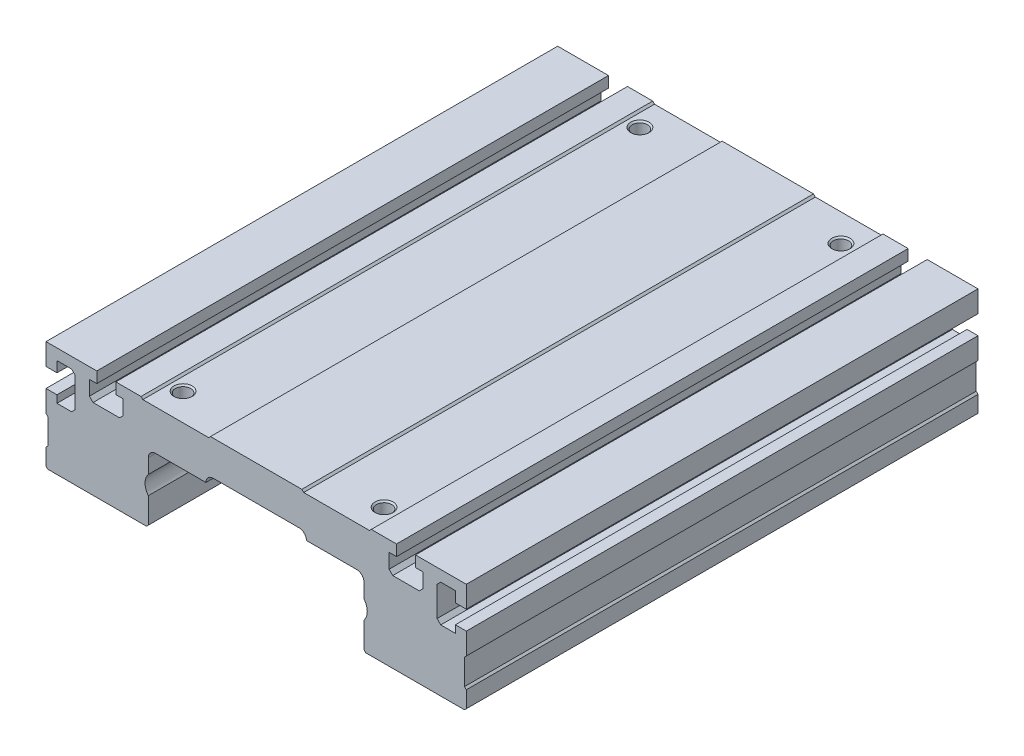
ISO-10303-21;
HEADER;
FILE_DESCRIPTION(('STEP AP214'),'2;1');
FILE_NAME('part.step','',(''),(''),'','','');
FILE_SCHEMA(('AUTOMOTIVE_DESIGN { 1 0 10303 214 1 1 1 1 }'));
ENDSEC;
DATA;
#1=APPLICATION_CONTEXT('core data for automotive mechanical design processes');
#2=APPLICATION_PROTOCOL_DEFINITION('international standard','automotive_design',2000,#1);
#3=PRODUCT_CONTEXT('',#1,'mechanical');
#4=PRODUCT('Part','Part','',(#3));
#5=PRODUCT_RELATED_PRODUCT_CATEGORY('part','',(#4));
#6=PRODUCT_DEFINITION_FORMATION('','',#4);
#7=PRODUCT_DEFINITION_CONTEXT('part definition',#1,'design');
#8=PRODUCT_DEFINITION('design','',#6,#7);
#9=PRODUCT_DEFINITION_SHAPE('','',#8);
#10=(LENGTH_UNIT() NAMED_UNIT(*) SI_UNIT(.MILLI.,.METRE.));
#11=(NAMED_UNIT(*) PLANE_ANGLE_UNIT() SI_UNIT($,.RADIAN.));
#12=(NAMED_UNIT(*) SI_UNIT($,.STERADIAN.) SOLID_ANGLE_UNIT());
#13=UNCERTAINTY_MEASURE_WITH_UNIT(LENGTH_MEASURE(1.E-05),#10,'distance_accuracy_value','');
#14=(GEOMETRIC_REPRESENTATION_CONTEXT(3) GLOBAL_UNCERTAINTY_ASSIGNED_CONTEXT((#13)) GLOBAL_UNIT_ASSIGNED_CONTEXT((#10,
#11,#12)) REPRESENTATION_CONTEXT('',''));
#15=CARTESIAN_POINT('',(0.,0.,0.));
#16=DIRECTION('',(0.,0.,1.));
#17=DIRECTION('',(1.,0.,0.));
#18=AXIS2_PLACEMENT_3D('',#15,#16,#17);
#19=CARTESIAN_POINT('',(26.,84.,780.));
#20=DIRECTION('',(0.,1.,0.));
#21=DIRECTION('',(0.,0.,1.));
#22=AXIS2_PLACEMENT_3D('',#19,#20,#21);
#23=PLANE('',#22);
#24=CARTESIAN_POINT('',(55.,84.,515.));
#25=DIRECTION('',(0.,1.,0.));
#26=DIRECTION('',(0.,0.,1.));
#27=AXIS2_PLACEMENT_3D('',#24,#25,#26);
#28=CIRCLE('',#27,5.);
#29=CARTESIAN_POINT('',(55.,84.,520.));
#30=VERTEX_POINT('',#29);
#31=EDGE_CURVE('E2444',#30,#30,#28,.T.);
#32=ORIENTED_EDGE('',*,*,#31,.F.);
#33=EDGE_LOOP('',(#32));
#34=FACE_BOUND('',#33,.T.);
#35=DIRECTION('',(1.,0.,0.));
#36=VECTOR('',#35,1.);
#37=CARTESIAN_POINT('',(26.,84.,500.));
#38=LINE('',#37,#36);
#39=CARTESIAN_POINT('',(26.,84.,500.));
#40=VERTEX_POINT('',#39);
#41=CARTESIAN_POINT('',(62.,84.,500.));
#42=VERTEX_POINT('',#41);
#43=EDGE_CURVE('E2541',#40,#42,#38,.T.);
#44=ORIENTED_EDGE('',*,*,#43,.F.);
#45=DIRECTION('',(0.,0.,-1.));
#46=VECTOR('',#45,1.);
#47=CARTESIAN_POINT('',(26.,84.,780.));
#48=LINE('',#47,#46);
#49=CARTESIAN_POINT('',(26.,84.,780.));
#50=VERTEX_POINT('',#49);
#51=EDGE_CURVE('E1132',#50,#40,#48,.T.);
#52=ORIENTED_EDGE('',*,*,#51,.F.);
#53=DIRECTION('',(1.,0.,0.));
#54=VECTOR('',#53,1.);
#55=CARTESIAN_POINT('',(26.,84.,780.));
#56=LINE('',#55,#54);
#57=CARTESIAN_POINT('',(62.,84.,780.));
#58=VERTEX_POINT('',#57);
#59=EDGE_CURVE('E707',#50,#58,#56,.T.);
#60=ORIENTED_EDGE('',*,*,#59,.T.);
#61=DIRECTION('',(0.,0.,-1.));
#62=VECTOR('',#61,1.);
#63=CARTESIAN_POINT('',(62.,84.,780.));
#64=LINE('',#63,#62);
#65=EDGE_CURVE('E1129',#58,#42,#64,.T.);
#66=ORIENTED_EDGE('',*,*,#65,.T.);
#67=EDGE_LOOP('',(#44,#52,#60,#66));
#68=FACE_BOUND('',#67,.T.);
#69=CARTESIAN_POINT('',(55.,84.,765.));
#70=DIRECTION('',(0.,1.,0.));
#71=DIRECTION('',(0.,0.,1.));
#72=AXIS2_PLACEMENT_3D('',#69,#70,#71);
#73=CIRCLE('',#72,5.);
#74=CARTESIAN_POINT('',(55.,84.,770.));
#75=VERTEX_POINT('',#74);
#76=EDGE_CURVE('E2426',#75,#75,#73,.T.);
#77=ORIENTED_EDGE('',*,*,#76,.F.);
#78=EDGE_LOOP('',(#77));
#79=FACE_BOUND('',#78,.T.);
#80=ADVANCED_FACE('F16',(#34,#68,#79),#23,.T.);
#81=CARTESIAN_POINT('',(-62.,84.,780.));
#82=DIRECTION('',(0.,1.,0.));
#83=DIRECTION('',(0.,0.,1.));
#84=AXIS2_PLACEMENT_3D('',#81,#82,#83);
#85=PLANE('',#84);
#86=CARTESIAN_POINT('',(-55.,84.,515.));
#87=DIRECTION('',(0.,1.,0.));
#88=DIRECTION('',(0.,0.,1.));
#89=AXIS2_PLACEMENT_3D('',#86,#87,#88);
#90=CIRCLE('',#89,5.);
#91=CARTESIAN_POINT('',(-55.,84.,520.));
#92=VERTEX_POINT('',#91);
#93=EDGE_CURVE('E2482',#92,#92,#90,.T.);
#94=ORIENTED_EDGE('',*,*,#93,.F.);
#95=EDGE_LOOP('',(#94));
#96=FACE_BOUND('',#95,.T.);
#97=DIRECTION('',(1.,0.,0.));
#98=VECTOR('',#97,1.);
#99=CARTESIAN_POINT('',(-62.,84.,500.));
#100=LINE('',#99,#98);
#101=CARTESIAN_POINT('',(-62.,84.,500.));
#102=VERTEX_POINT('',#101);
#103=CARTESIAN_POINT('',(-26.,84.,500.));
#104=VERTEX_POINT('',#103);
#105=EDGE_CURVE('E2528',#102,#104,#100,.T.);
#106=ORIENTED_EDGE('',*,*,#105,.F.);
#107=DIRECTION('',(0.,0.,-1.));
#108=VECTOR('',#107,1.);
#109=CARTESIAN_POINT('',(-62.,84.,780.));
#110=LINE('',#109,#108);
#111=CARTESIAN_POINT('',(-62.,84.,780.));
#112=VERTEX_POINT('',#111);
#113=EDGE_CURVE('E1144',#112,#102,#110,.T.);
#114=ORIENTED_EDGE('',*,*,#113,.F.);
#115=DIRECTION('',(1.,0.,0.));
#116=VECTOR('',#115,1.);
#117=CARTESIAN_POINT('',(-62.,84.,780.));
#118=LINE('',#117,#116);
#119=CARTESIAN_POINT('',(-26.,84.,780.));
#120=VERTEX_POINT('',#119);
#121=EDGE_CURVE('E692',#112,#120,#118,.T.);
#122=ORIENTED_EDGE('',*,*,#121,.T.);
#123=DIRECTION('',(0.,0.,-1.));
#124=VECTOR('',#123,1.);
#125=CARTESIAN_POINT('',(-26.,84.,780.));
#126=LINE('',#125,#124);
#127=EDGE_CURVE('E1141',#120,#104,#126,.T.);
#128=ORIENTED_EDGE('',*,*,#127,.T.);
#129=EDGE_LOOP('',(#106,#114,#122,#128));
#130=FACE_BOUND('',#129,.T.);
#131=CARTESIAN_POINT('',(-55.,84.,765.));
#132=DIRECTION('',(0.,1.,0.));
#133=DIRECTION('',(0.,0.,1.));
#134=AXIS2_PLACEMENT_3D('',#131,#132,#133);
#135=CIRCLE('',#134,5.);
#136=CARTESIAN_POINT('',(-55.,84.,770.));
#137=VERTEX_POINT('',#136);
#138=EDGE_CURVE('E2463',#137,#137,#135,.T.);
#139=ORIENTED_EDGE('',*,*,#138,.F.);
#140=EDGE_LOOP('',(#139));
#141=FACE_BOUND('',#140,.T.);
#142=ADVANCED_FACE('F533',(#96,#130,#141),#85,.T.);
#143=CARTESIAN_POINT('',(-115.,73.2,780.));
#144=DIRECTION('',(-1.,0.,0.));
#145=DIRECTION('',(0.,0.,1.));
#146=AXIS2_PLACEMENT_3D('',#143,#144,#145);
#147=PLANE('',#146);
#148=DIRECTION('',(0.,1.,0.));
#149=VECTOR('',#148,1.);
#150=CARTESIAN_POINT('',(-115.,73.2,500.));
#151=LINE('',#150,#149);
#152=CARTESIAN_POINT('',(-115.,73.2,500.));
#153=VERTEX_POINT('',#152);
#154=CARTESIAN_POINT('',(-115.,85.,500.));
#155=VERTEX_POINT('',#154);
#156=EDGE_CURVE('E625',#153,#155,#151,.T.);
#157=ORIENTED_EDGE('',*,*,#156,.F.);
#158=DIRECTION('',(0.,0.,-1.));
#159=VECTOR('',#158,1.);
#160=CARTESIAN_POINT('',(-115.,73.2,780.));
#161=LINE('',#160,#159);
#162=CARTESIAN_POINT('',(-115.,73.2,780.));
#163=VERTEX_POINT('',#162);
#164=EDGE_CURVE('E32',#163,#153,#161,.T.);
#165=ORIENTED_EDGE('',*,*,#164,.F.);
#166=DIRECTION('',(0.,1.,0.));
#167=VECTOR('',#166,1.);
#168=CARTESIAN_POINT('',(-115.,73.2,780.));
#169=LINE('',#168,#167);
#170=CARTESIAN_POINT('',(-115.,85.,780.));
#171=VERTEX_POINT('',#170);
#172=EDGE_CURVE('E648',#163,#171,#169,.T.);
#173=ORIENTED_EDGE('',*,*,#172,.T.);
#174=DIRECTION('',(0.,0.,-1.));
#175=VECTOR('',#174,1.);
#176=CARTESIAN_POINT('',(-115.,85.,780.));
#177=LINE('',#176,#175);
#178=EDGE_CURVE('E617',#171,#155,#177,.T.);
#179=ORIENTED_EDGE('',*,*,#178,.T.);
#180=EDGE_LOOP('',(#157,#165,#173,#179));
#181=FACE_BOUND('',#180,.T.);
#182=ADVANCED_FACE('F18',(#181),#147,.T.);
#183=CARTESIAN_POINT('',(-109.,73.2,780.));
#184=DIRECTION('',(0.,-1.,0.));
#185=DIRECTION('',(0.,0.,-1.));
#186=AXIS2_PLACEMENT_3D('',#183,#184,#185);
#187=PLANE('',#186);
#188=DIRECTION('',(-1.,0.,0.));
#189=VECTOR('',#188,1.);
#190=CARTESIAN_POINT('',(-109.,73.2,500.));
#191=LINE('',#190,#189);
#192=CARTESIAN_POINT('',(-109.,73.2,500.));
#193=VERTEX_POINT('',#192);
#194=EDGE_CURVE('E629',#193,#153,#191,.T.);
#195=ORIENTED_EDGE('',*,*,#194,.F.);
#196=DIRECTION('',(0.,0.,-1.));
#197=VECTOR('',#196,1.);
#198=CARTESIAN_POINT('',(-109.,73.2,780.));
#199=LINE('',#198,#197);
#200=CARTESIAN_POINT('',(-109.,73.2,780.));
#201=VERTEX_POINT('',#200);
#202=EDGE_CURVE('E40',#201,#193,#199,.T.);
#203=ORIENTED_EDGE('',*,*,#202,.F.);
#204=DIRECTION('',(-1.,0.,0.));
#205=VECTOR('',#204,1.);
#206=CARTESIAN_POINT('',(-109.,73.2,780.));
#207=LINE('',#206,#205);
#208=EDGE_CURVE('E946',#201,#163,#207,.T.);
#209=ORIENTED_EDGE('',*,*,#208,.T.);
#210=ORIENTED_EDGE('',*,*,#164,.T.);
#211=EDGE_LOOP('',(#195,#203,#209,#210));
#212=FACE_BOUND('',#211,.T.);
#213=ADVANCED_FACE('F1351',(#212),#187,.T.);
#214=CARTESIAN_POINT('',(-109.,79.,780.));
#215=DIRECTION('',(1.,0.,0.));
#216=DIRECTION('',(0.,0.,-1.));
#217=AXIS2_PLACEMENT_3D('',#214,#215,#216);
#218=PLANE('',#217);
#219=DIRECTION('',(0.,-1.,0.));
#220=VECTOR('',#219,1.);
#221=CARTESIAN_POINT('',(-109.,79.,500.));
#222=LINE('',#221,#220);
#223=CARTESIAN_POINT('',(-109.,79.,500.));
#224=VERTEX_POINT('',#223);
#225=EDGE_CURVE('E1341',#224,#193,#222,.T.);
#226=ORIENTED_EDGE('',*,*,#225,.F.);
#227=DIRECTION('',(0.,0.,-1.));
#228=VECTOR('',#227,1.);
#229=CARTESIAN_POINT('',(-109.,79.,780.));
#230=LINE('',#229,#228);
#231=CARTESIAN_POINT('',(-109.,79.,780.));
#232=VERTEX_POINT('',#231);
#233=EDGE_CURVE('E955',#232,#224,#230,.T.);
#234=ORIENTED_EDGE('',*,*,#233,.F.);
#235=DIRECTION('',(0.,-1.,0.));
#236=VECTOR('',#235,1.);
#237=CARTESIAN_POINT('',(-109.,79.,780.));
#238=LINE('',#237,#236);
#239=EDGE_CURVE('E943',#232,#201,#238,.T.);
#240=ORIENTED_EDGE('',*,*,#239,.T.);
#241=ORIENTED_EDGE('',*,*,#202,.T.);
#242=EDGE_LOOP('',(#226,#234,#240,#241));
#243=FACE_BOUND('',#242,.T.);
#244=ADVANCED_FACE('F1356',(#243),#218,.T.);
#245=CARTESIAN_POINT('',(-101.,79.,780.));
#246=DIRECTION('',(0.,-1.,0.));
#247=DIRECTION('',(0.,0.,-1.));
#248=AXIS2_PLACEMENT_3D('',#245,#246,#247);
#249=PLANE('',#248);
#250=DIRECTION('',(-1.,0.,0.));
#251=VECTOR('',#250,1.);
#252=CARTESIAN_POINT('',(-101.,79.,500.));
#253=LINE('',#252,#251);
#254=CARTESIAN_POINT('',(-101.,79.,500.));
#255=VERTEX_POINT('',#254);
#256=EDGE_CURVE('E1338',#255,#224,#253,.T.);
#257=ORIENTED_EDGE('',*,*,#256,.F.);
#258=DIRECTION('',(0.,0.,-1.));
#259=VECTOR('',#258,1.);
#260=CARTESIAN_POINT('',(-101.,79.,780.));
#261=LINE('',#260,#259);
#262=CARTESIAN_POINT('',(-101.,79.,780.));
#263=VERTEX_POINT('',#262);
#264=EDGE_CURVE('E958',#263,#255,#261,.T.);
#265=ORIENTED_EDGE('',*,*,#264,.F.);
#266=DIRECTION('',(-1.,0.,0.));
#267=VECTOR('',#266,1.);
#268=CARTESIAN_POINT('',(-101.,79.,780.));
#269=LINE('',#268,#267);
#270=EDGE_CURVE('E939',#263,#232,#269,.T.);
#271=ORIENTED_EDGE('',*,*,#270,.T.);
#272=ORIENTED_EDGE('',*,*,#233,.T.);
#273=EDGE_LOOP('',(#257,#265,#271,#272));
#274=FACE_BOUND('',#273,.T.);
#275=ADVANCED_FACE('F1360',(#274),#249,.T.);
#276=CARTESIAN_POINT('',(-99.,77.,780.));
#277=DIRECTION('',(-0.707106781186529,-0.707106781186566,0.));
#278=DIRECTION('',(0.707106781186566,-0.707106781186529,0.));
#279=AXIS2_PLACEMENT_3D('',#276,#277,#278);
#280=PLANE('',#279);
#281=DIRECTION('',(-0.707106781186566,0.707106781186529,0.));
#282=VECTOR('',#281,1.);
#283=CARTESIAN_POINT('',(-99.,77.,500.));
#284=LINE('',#283,#282);
#285=CARTESIAN_POINT('',(-99.,77.,500.));
#286=VERTEX_POINT('',#285);
#287=EDGE_CURVE('E1334',#286,#255,#284,.T.);
#288=ORIENTED_EDGE('',*,*,#287,.F.);
#289=DIRECTION('',(0.,0.,-1.));
#290=VECTOR('',#289,1.);
#291=CARTESIAN_POINT('',(-99.,77.,780.));
#292=LINE('',#291,#290);
#293=CARTESIAN_POINT('',(-99.,77.,780.));
#294=VERTEX_POINT('',#293);
#295=EDGE_CURVE('E961',#294,#286,#292,.T.);
#296=ORIENTED_EDGE('',*,*,#295,.F.);
#297=DIRECTION('',(-0.707106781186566,0.707106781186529,0.));
#298=VECTOR('',#297,1.);
#299=CARTESIAN_POINT('',(-99.,77.,780.));
#300=LINE('',#299,#298);
#301=EDGE_CURVE('E935',#294,#263,#300,.T.);
#302=ORIENTED_EDGE('',*,*,#301,.T.);
#303=ORIENTED_EDGE('',*,*,#264,.T.);
#304=EDGE_LOOP('',(#288,#296,#302,#303));
#305=FACE_BOUND('',#304,.T.);
#306=ADVANCED_FACE('F1379',(#305),#280,.T.);
#307=CARTESIAN_POINT('',(-99.,60.75,780.));
#308=DIRECTION('',(-1.,0.,0.));
#309=DIRECTION('',(0.,0.,1.));
#310=AXIS2_PLACEMENT_3D('',#307,#308,#309);
#311=PLANE('',#310);
#312=DIRECTION('',(0.,1.,0.));
#313=VECTOR('',#312,1.);
#314=CARTESIAN_POINT('',(-99.,60.75,500.));
#315=LINE('',#314,#313);
#316=CARTESIAN_POINT('',(-99.,60.75,500.));
#317=VERTEX_POINT('',#316);
#318=EDGE_CURVE('E1330',#317,#286,#315,.T.);
#319=ORIENTED_EDGE('',*,*,#318,.F.);
#320=DIRECTION('',(0.,0.,-1.));
#321=VECTOR('',#320,1.);
#322=CARTESIAN_POINT('',(-99.,60.75,780.));
#323=LINE('',#322,#321);
#324=CARTESIAN_POINT('',(-99.,60.75,780.));
#325=VERTEX_POINT('',#324);
#326=EDGE_CURVE('E964',#325,#317,#323,.T.);
#327=ORIENTED_EDGE('',*,*,#326,.F.);
#328=DIRECTION('',(0.,1.,0.));
#329=VECTOR('',#328,1.);
#330=CARTESIAN_POINT('',(-99.,60.75,780.));
#331=LINE('',#330,#329);
#332=EDGE_CURVE('E931',#325,#294,#331,.T.);
#333=ORIENTED_EDGE('',*,*,#332,.T.);
#334=ORIENTED_EDGE('',*,*,#295,.T.);
#335=EDGE_LOOP('',(#319,#327,#333,#334));
#336=FACE_BOUND('',#335,.T.);
#337=ADVANCED_FACE('F1389',(#336),#311,.T.);
#338=CARTESIAN_POINT('',(-101.,58.75,780.));
#339=DIRECTION('',(-0.707106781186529,0.707106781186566,0.));
#340=DIRECTION('',(-0.707106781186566,-0.707106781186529,0.));
#341=AXIS2_PLACEMENT_3D('',#338,#339,#340);
#342=PLANE('',#341);
#343=DIRECTION('',(0.707106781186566,0.707106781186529,0.));
#344=VECTOR('',#343,1.);
#345=CARTESIAN_POINT('',(-101.,58.75,500.));
#346=LINE('',#345,#344);
#347=CARTESIAN_POINT('',(-101.,58.75,500.));
#348=VERTEX_POINT('',#347);
#349=EDGE_CURVE('E1326',#348,#317,#346,.T.);
#350=ORIENTED_EDGE('',*,*,#349,.F.);
#351=DIRECTION('',(0.,0.,-1.));
#352=VECTOR('',#351,1.);
#353=CARTESIAN_POINT('',(-101.,58.75,780.));
#354=LINE('',#353,#352);
#355=CARTESIAN_POINT('',(-101.,58.75,780.));
#356=VERTEX_POINT('',#355);
#357=EDGE_CURVE('E967',#356,#348,#354,.T.);
#358=ORIENTED_EDGE('',*,*,#357,.F.);
#359=DIRECTION('',(0.707106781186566,0.707106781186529,0.));
#360=VECTOR('',#359,1.);
#361=CARTESIAN_POINT('',(-101.,58.75,780.));
#362=LINE('',#361,#360);
#363=EDGE_CURVE('E927',#356,#325,#362,.T.);
#364=ORIENTED_EDGE('',*,*,#363,.T.);
#365=ORIENTED_EDGE('',*,*,#326,.T.);
#366=EDGE_LOOP('',(#350,#358,#364,#365));
#367=FACE_BOUND('',#366,.T.);
#368=ADVANCED_FACE('F1399',(#367),#342,.T.);
#369=CARTESIAN_POINT('',(-109.,58.75,780.));
#370=DIRECTION('',(0.,1.,0.));
#371=DIRECTION('',(0.,0.,1.));
#372=AXIS2_PLACEMENT_3D('',#369,#370,#371);
#373=PLANE('',#372);
#374=DIRECTION('',(1.,0.,0.));
#375=VECTOR('',#374,1.);
#376=CARTESIAN_POINT('',(-109.,58.75,500.));
#377=LINE('',#376,#375);
#378=CARTESIAN_POINT('',(-109.,58.75,500.));
#379=VERTEX_POINT('',#378);
#380=EDGE_CURVE('E1322',#379,#348,#377,.T.);
#381=ORIENTED_EDGE('',*,*,#380,.F.);
#382=DIRECTION('',(0.,0.,-1.));
#383=VECTOR('',#382,1.);
#384=CARTESIAN_POINT('',(-109.,58.75,780.));
#385=LINE('',#384,#383);
#386=CARTESIAN_POINT('',(-109.,58.75,780.));
#387=VERTEX_POINT('',#386);
#388=EDGE_CURVE('E970',#387,#379,#385,.T.);
#389=ORIENTED_EDGE('',*,*,#388,.F.);
#390=DIRECTION('',(1.,0.,0.));
#391=VECTOR('',#390,1.);
#392=CARTESIAN_POINT('',(-109.,58.75,780.));
#393=LINE('',#392,#391);
#394=EDGE_CURVE('E923',#387,#356,#393,.T.);
#395=ORIENTED_EDGE('',*,*,#394,.T.);
#396=ORIENTED_EDGE('',*,*,#357,.T.);
#397=EDGE_LOOP('',(#381,#389,#395,#396));
#398=FACE_BOUND('',#397,.T.);
#399=ADVANCED_FACE('F1409',(#398),#373,.T.);
#400=CARTESIAN_POINT('',(-109.,62.8,780.));
#401=DIRECTION('',(1.,0.,0.));
#402=DIRECTION('',(0.,0.,-1.));
#403=AXIS2_PLACEMENT_3D('',#400,#401,#402);
#404=PLANE('',#403);
#405=DIRECTION('',(0.,-1.,0.));
#406=VECTOR('',#405,1.);
#407=CARTESIAN_POINT('',(-109.,62.8,500.));
#408=LINE('',#407,#406);
#409=CARTESIAN_POINT('',(-109.,62.8,500.));
#410=VERTEX_POINT('',#409);
#411=EDGE_CURVE('E1318',#410,#379,#408,.T.);
#412=ORIENTED_EDGE('',*,*,#411,.F.);
#413=DIRECTION('',(0.,0.,-1.));
#414=VECTOR('',#413,1.);
#415=CARTESIAN_POINT('',(-109.,62.8,780.));
#416=LINE('',#415,#414);
#417=CARTESIAN_POINT('',(-109.,62.8,780.));
#418=VERTEX_POINT('',#417);
#419=EDGE_CURVE('E973',#418,#410,#416,.T.);
#420=ORIENTED_EDGE('',*,*,#419,.F.);
#421=DIRECTION('',(0.,-1.,0.));
#422=VECTOR('',#421,1.);
#423=CARTESIAN_POINT('',(-109.,62.8,780.));
#424=LINE('',#423,#422);
#425=EDGE_CURVE('E919',#418,#387,#424,.T.);
#426=ORIENTED_EDGE('',*,*,#425,.T.);
#427=ORIENTED_EDGE('',*,*,#388,.T.);
#428=EDGE_LOOP('',(#412,#420,#426,#427));
#429=FACE_BOUND('',#428,.T.);
#430=ADVANCED_FACE('F1419',(#429),#404,.T.);
#431=CARTESIAN_POINT('',(-115.,62.8,780.));
#432=DIRECTION('',(0.,1.,0.));
#433=DIRECTION('',(0.,0.,1.));
#434=AXIS2_PLACEMENT_3D('',#431,#432,#433);
#435=PLANE('',#434);
#436=DIRECTION('',(1.,0.,0.));
#437=VECTOR('',#436,1.);
#438=CARTESIAN_POINT('',(-115.,62.8,500.));
#439=LINE('',#438,#437);
#440=CARTESIAN_POINT('',(-115.,62.8,500.));
#441=VERTEX_POINT('',#440);
#442=EDGE_CURVE('E1314',#441,#410,#439,.T.);
#443=ORIENTED_EDGE('',*,*,#442,.F.);
#444=DIRECTION('',(0.,0.,-1.));
#445=VECTOR('',#444,1.);
#446=CARTESIAN_POINT('',(-115.,62.8,780.));
#447=LINE('',#446,#445);
#448=CARTESIAN_POINT('',(-115.,62.8,780.));
#449=VERTEX_POINT('',#448);
#450=EDGE_CURVE('E976',#449,#441,#447,.T.);
#451=ORIENTED_EDGE('',*,*,#450,.F.);
#452=DIRECTION('',(1.,0.,0.));
#453=VECTOR('',#452,1.);
#454=CARTESIAN_POINT('',(-115.,62.8,780.));
#455=LINE('',#454,#453);
#456=EDGE_CURVE('E915',#449,#418,#455,.T.);
#457=ORIENTED_EDGE('',*,*,#456,.T.);
#458=ORIENTED_EDGE('',*,*,#419,.T.);
#459=EDGE_LOOP('',(#443,#451,#457,#458));
#460=FACE_BOUND('',#459,.T.);
#461=ADVANCED_FACE('F1429',(#460),#435,.T.);
#462=CARTESIAN_POINT('',(-115.,51.,780.));
#463=DIRECTION('',(-1.,0.,0.));
#464=DIRECTION('',(0.,-1.,0.));
#465=AXIS2_PLACEMENT_3D('',#462,#463,#464);
#466=PLANE('',#465);
#467=DIRECTION('',(0.,1.,0.));
#468=VECTOR('',#467,1.);
#469=CARTESIAN_POINT('',(-115.,51.,500.));
#470=LINE('',#469,#468);
#471=CARTESIAN_POINT('',(-115.,51.,500.));
#472=VERTEX_POINT('',#471);
#473=EDGE_CURVE('E1310',#472,#441,#470,.T.);
#474=ORIENTED_EDGE('',*,*,#473,.F.);
#475=DIRECTION('',(0.,0.,-1.));
#476=VECTOR('',#475,1.);
#477=CARTESIAN_POINT('',(-115.,51.,780.));
#478=LINE('',#477,#476);
#479=CARTESIAN_POINT('',(-115.,51.,780.));
#480=VERTEX_POINT('',#479);
#481=EDGE_CURVE('E979',#480,#472,#478,.T.);
#482=ORIENTED_EDGE('',*,*,#481,.F.);
#483=DIRECTION('',(0.,1.,0.));
#484=VECTOR('',#483,1.);
#485=CARTESIAN_POINT('',(-115.,51.,780.));
#486=LINE('',#485,#484);
#487=EDGE_CURVE('E911',#480,#449,#486,.T.);
#488=ORIENTED_EDGE('',*,*,#487,.T.);
#489=ORIENTED_EDGE('',*,*,#450,.T.);
#490=EDGE_LOOP('',(#474,#482,#488,#489));
#491=FACE_BOUND('',#490,.T.);
#492=ADVANCED_FACE('F1439',(#491),#466,.T.);
#493=CARTESIAN_POINT('',(-114.,50.,780.));
#494=DIRECTION('',(-0.707106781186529,-0.707106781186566,0.));
#495=DIRECTION('',(0.707106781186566,-0.707106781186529,0.));
#496=AXIS2_PLACEMENT_3D('',#493,#494,#495);
#497=PLANE('',#496);
#498=DIRECTION('',(-0.707106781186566,0.707106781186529,0.));
#499=VECTOR('',#498,1.);
#500=CARTESIAN_POINT('',(-114.,50.,500.));
#501=LINE('',#500,#499);
#502=CARTESIAN_POINT('',(-114.,50.,500.));
#503=VERTEX_POINT('',#502);
#504=EDGE_CURVE('E1306',#503,#472,#501,.T.);
#505=ORIENTED_EDGE('',*,*,#504,.F.);
#506=DIRECTION('',(0.,0.,-1.));
#507=VECTOR('',#506,1.);
#508=CARTESIAN_POINT('',(-114.,50.,780.));
#509=LINE('',#508,#507);
#510=CARTESIAN_POINT('',(-114.,50.,780.));
#511=VERTEX_POINT('',#510);
#512=EDGE_CURVE('E982',#511,#503,#509,.T.);
#513=ORIENTED_EDGE('',*,*,#512,.F.);
#514=DIRECTION('',(-0.707106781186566,0.707106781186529,0.));
#515=VECTOR('',#514,1.);
#516=CARTESIAN_POINT('',(-114.,50.,780.));
#517=LINE('',#516,#515);
#518=EDGE_CURVE('E907',#511,#480,#517,.T.);
#519=ORIENTED_EDGE('',*,*,#518,.T.);
#520=ORIENTED_EDGE('',*,*,#481,.T.);
#521=EDGE_LOOP('',(#505,#513,#519,#520));
#522=FACE_BOUND('',#521,.T.);
#523=ADVANCED_FACE('F1449',(#522),#497,.T.);
#524=CARTESIAN_POINT('',(-114.,36.,780.));
#525=DIRECTION('',(-1.,0.,0.));
#526=DIRECTION('',(0.,0.,1.));
#527=AXIS2_PLACEMENT_3D('',#524,#525,#526);
#528=PLANE('',#527);
#529=DIRECTION('',(0.,1.,0.));
#530=VECTOR('',#529,1.);
#531=CARTESIAN_POINT('',(-114.,36.,500.));
#532=LINE('',#531,#530);
#533=CARTESIAN_POINT('',(-114.,36.,500.));
#534=VERTEX_POINT('',#533);
#535=EDGE_CURVE('E1302',#534,#503,#532,.T.);
#536=ORIENTED_EDGE('',*,*,#535,.F.);
#537=DIRECTION('',(0.,0.,-1.));
#538=VECTOR('',#537,1.);
#539=CARTESIAN_POINT('',(-114.,36.,780.));
#540=LINE('',#539,#538);
#541=CARTESIAN_POINT('',(-114.,36.,780.));
#542=VERTEX_POINT('',#541);
#543=EDGE_CURVE('E985',#542,#534,#540,.T.);
#544=ORIENTED_EDGE('',*,*,#543,.F.);
#545=DIRECTION('',(0.,1.,0.));
#546=VECTOR('',#545,1.);
#547=CARTESIAN_POINT('',(-114.,36.,780.));
#548=LINE('',#547,#546);
#549=EDGE_CURVE('E903',#542,#511,#548,.T.);
#550=ORIENTED_EDGE('',*,*,#549,.T.);
#551=ORIENTED_EDGE('',*,*,#512,.T.);
#552=EDGE_LOOP('',(#536,#544,#550,#551));
#553=FACE_BOUND('',#552,.T.);
#554=ADVANCED_FACE('F1459',(#553),#528,.T.);
#555=CARTESIAN_POINT('',(-115.,35.,780.));
#556=DIRECTION('',(-0.707106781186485,0.70710678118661,0.));
#557=DIRECTION('',(-0.70710678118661,-0.707106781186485,0.));
#558=AXIS2_PLACEMENT_3D('',#555,#556,#557);
#559=PLANE('',#558);
#560=DIRECTION('',(0.70710678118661,0.707106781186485,0.));
#561=VECTOR('',#560,1.);
#562=CARTESIAN_POINT('',(-115.,35.,500.));
#563=LINE('',#562,#561);
#564=CARTESIAN_POINT('',(-115.,35.,500.));
#565=VERTEX_POINT('',#564);
#566=EDGE_CURVE('E1298',#565,#534,#563,.T.);
#567=ORIENTED_EDGE('',*,*,#566,.F.);
#568=DIRECTION('',(0.,0.,-1.));
#569=VECTOR('',#568,1.);
#570=CARTESIAN_POINT('',(-115.,35.,780.));
#571=LINE('',#570,#569);
#572=CARTESIAN_POINT('',(-115.,35.,780.));
#573=VERTEX_POINT('',#572);
#574=EDGE_CURVE('E988',#573,#565,#571,.T.);
#575=ORIENTED_EDGE('',*,*,#574,.F.);
#576=DIRECTION('',(0.70710678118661,0.707106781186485,0.));
#577=VECTOR('',#576,1.);
#578=CARTESIAN_POINT('',(-115.,35.,780.));
#579=LINE('',#578,#577);
#580=EDGE_CURVE('E899',#573,#542,#579,.T.);
#581=ORIENTED_EDGE('',*,*,#580,.T.);
#582=ORIENTED_EDGE('',*,*,#543,.T.);
#583=EDGE_LOOP('',(#567,#575,#581,#582));
#584=FACE_BOUND('',#583,.T.);
#585=ADVANCED_FACE('F1469',(#584),#559,.T.);
#586=CARTESIAN_POINT('',(-115.,26.,780.));
#587=DIRECTION('',(-1.,0.,0.));
#588=DIRECTION('',(0.,0.,1.));
#589=AXIS2_PLACEMENT_3D('',#586,#587,#588);
#590=PLANE('',#589);
#591=DIRECTION('',(0.,1.,0.));
#592=VECTOR('',#591,1.);
#593=CARTESIAN_POINT('',(-115.,26.,500.));
#594=LINE('',#593,#592);
#595=CARTESIAN_POINT('',(-115.,26.,500.));
#596=VERTEX_POINT('',#595);
#597=EDGE_CURVE('E1294',#596,#565,#594,.T.);
#598=ORIENTED_EDGE('',*,*,#597,.F.);
#599=DIRECTION('',(0.,0.,-1.));
#600=VECTOR('',#599,1.);
#601=CARTESIAN_POINT('',(-115.,26.,780.));
#602=LINE('',#601,#600);
#603=CARTESIAN_POINT('',(-115.,26.,780.));
#604=VERTEX_POINT('',#603);
#605=EDGE_CURVE('E991',#604,#596,#602,.T.);
#606=ORIENTED_EDGE('',*,*,#605,.F.);
#607=DIRECTION('',(0.,1.,0.));
#608=VECTOR('',#607,1.);
#609=CARTESIAN_POINT('',(-115.,26.,780.));
#610=LINE('',#609,#608);
#611=EDGE_CURVE('E895',#604,#573,#610,.T.);
#612=ORIENTED_EDGE('',*,*,#611,.T.);
#613=ORIENTED_EDGE('',*,*,#574,.T.);
#614=EDGE_LOOP('',(#598,#606,#612,#613));
#615=FACE_BOUND('',#614,.T.);
#616=ADVANCED_FACE('F1479',(#615),#590,.T.);
#617=CARTESIAN_POINT('',(-114.,25.,780.));
#618=DIRECTION('',(-0.707106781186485,-0.70710678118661,0.));
#619=DIRECTION('',(0.70710678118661,-0.707106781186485,0.));
#620=AXIS2_PLACEMENT_3D('',#617,#618,#619);
#621=PLANE('',#620);
#622=DIRECTION('',(-0.70710678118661,0.707106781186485,0.));
#623=VECTOR('',#622,1.);
#624=CARTESIAN_POINT('',(-114.,25.,500.));
#625=LINE('',#624,#623);
#626=CARTESIAN_POINT('',(-114.,25.,500.));
#627=VERTEX_POINT('',#626);
#628=EDGE_CURVE('E1290',#627,#596,#625,.T.);
#629=ORIENTED_EDGE('',*,*,#628,.F.);
#630=DIRECTION('',(0.,0.,-1.));
#631=VECTOR('',#630,1.);
#632=CARTESIAN_POINT('',(-114.,25.,780.));
#633=LINE('',#632,#631);
#634=CARTESIAN_POINT('',(-114.,25.,780.));
#635=VERTEX_POINT('',#634);
#636=EDGE_CURVE('E994',#635,#627,#633,.T.);
#637=ORIENTED_EDGE('',*,*,#636,.F.);
#638=DIRECTION('',(-0.70710678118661,0.707106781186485,0.));
#639=VECTOR('',#638,1.);
#640=CARTESIAN_POINT('',(-114.,25.,780.));
#641=LINE('',#640,#639);
#642=EDGE_CURVE('E891',#635,#604,#641,.T.);
#643=ORIENTED_EDGE('',*,*,#642,.T.);
#644=ORIENTED_EDGE('',*,*,#605,.T.);
#645=EDGE_LOOP('',(#629,#637,#643,#644));
#646=FACE_BOUND('',#645,.T.);
#647=ADVANCED_FACE('F1489',(#646),#621,.T.);
#648=CARTESIAN_POINT('',(-60.,25.,780.));
#649=DIRECTION('',(0.,-1.,0.));
#650=DIRECTION('',(0.,0.,-1.));
#651=AXIS2_PLACEMENT_3D('',#648,#649,#650);
#652=PLANE('',#651);
#653=CARTESIAN_POINT('',(-84.25,25.,730.));
#654=DIRECTION('',(0.,-1.,0.));
#655=DIRECTION('',(0.,0.,-1.));
#656=AXIS2_PLACEMENT_3D('',#653,#654,#655);
#657=CIRCLE('',#656,10.);
#658=CARTESIAN_POINT('',(-84.25,25.,720.));
#659=VERTEX_POINT('',#658);
#660=EDGE_CURVE('E1184',#659,#659,#657,.T.);
#661=ORIENTED_EDGE('',*,*,#660,.F.);
#662=EDGE_LOOP('',(#661));
#663=FACE_BOUND('',#662,.T.);
#664=CARTESIAN_POINT('',(-84.25,25.,550.));
#665=DIRECTION('',(0.,-1.,0.));
#666=DIRECTION('',(0.,0.,-1.));
#667=AXIS2_PLACEMENT_3D('',#664,#665,#666);
#668=CIRCLE('',#667,10.);
#669=CARTESIAN_POINT('',(-84.25,25.,540.));
#670=VERTEX_POINT('',#669);
#671=EDGE_CURVE('E952',#670,#670,#668,.T.);
#672=ORIENTED_EDGE('',*,*,#671,.F.);
#673=EDGE_LOOP('',(#672));
#674=FACE_BOUND('',#673,.T.);
#675=DIRECTION('',(-1.,0.,0.));
#676=VECTOR('',#675,1.);
#677=CARTESIAN_POINT('',(-60.,25.,500.));
#678=LINE('',#677,#676);
#679=CARTESIAN_POINT('',(-60.,25.,500.));
#680=VERTEX_POINT('',#679);
#681=EDGE_CURVE('E1286',#680,#627,#678,.T.);
#682=ORIENTED_EDGE('',*,*,#681,.F.);
#683=DIRECTION('',(0.,0.,-1.));
#684=VECTOR('',#683,1.);
#685=CARTESIAN_POINT('',(-60.,25.,780.));
#686=LINE('',#685,#684);
#687=CARTESIAN_POINT('',(-60.,25.,780.));
#688=VERTEX_POINT('',#687);
#689=EDGE_CURVE('E997',#688,#680,#686,.T.);
#690=ORIENTED_EDGE('',*,*,#689,.F.);
#691=DIRECTION('',(-1.,0.,0.));
#692=VECTOR('',#691,1.);
#693=CARTESIAN_POINT('',(-60.,25.,780.));
#694=LINE('',#693,#692);
#695=EDGE_CURVE('E887',#688,#635,#694,.T.);
#696=ORIENTED_EDGE('',*,*,#695,.T.);
#697=ORIENTED_EDGE('',*,*,#636,.T.);
#698=EDGE_LOOP('',(#682,#690,#696,#697));
#699=FACE_BOUND('',#698,.T.);
#700=ADVANCED_FACE('F1499',(#663,#674,#699),#652,.T.);
#701=CARTESIAN_POINT('',(-59.,26.,780.));
#702=DIRECTION('',(0.707106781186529,-0.707106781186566,0.));
#703=DIRECTION('',(0.707106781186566,0.707106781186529,0.));
#704=AXIS2_PLACEMENT_3D('',#701,#702,#703);
#705=PLANE('',#704);
#706=DIRECTION('',(-0.707106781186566,-0.707106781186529,0.));
#707=VECTOR('',#706,1.);
#708=CARTESIAN_POINT('',(-59.,26.,500.));
#709=LINE('',#708,#707);
#710=CARTESIAN_POINT('',(-59.,26.,500.));
#711=VERTEX_POINT('',#710);
#712=EDGE_CURVE('E1282',#711,#680,#709,.T.);
#713=ORIENTED_EDGE('',*,*,#712,.F.);
#714=DIRECTION('',(0.,0.,-1.));
#715=VECTOR('',#714,1.);
#716=CARTESIAN_POINT('',(-59.,26.,780.));
#717=LINE('',#716,#715);
#718=CARTESIAN_POINT('',(-59.,26.,780.));
#719=VERTEX_POINT('',#718);
#720=EDGE_CURVE('E1000',#719,#711,#717,.T.);
#721=ORIENTED_EDGE('',*,*,#720,.F.);
#722=DIRECTION('',(-0.707106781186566,-0.707106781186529,0.));
#723=VECTOR('',#722,1.);
#724=CARTESIAN_POINT('',(-59.,26.,780.));
#725=LINE('',#724,#723);
#726=EDGE_CURVE('E883',#719,#688,#725,.T.);
#727=ORIENTED_EDGE('',*,*,#726,.T.);
#728=ORIENTED_EDGE('',*,*,#689,.T.);
#729=EDGE_LOOP('',(#713,#721,#727,#728));
#730=FACE_BOUND('',#729,.T.);
#731=ADVANCED_FACE('F1509',(#730),#705,.T.);
#732=CARTESIAN_POINT('',(-59.,40.0050398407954,780.));
#733=DIRECTION('',(1.,0.,0.));
#734=DIRECTION('',(0.,0.,-1.));
#735=AXIS2_PLACEMENT_3D('',#732,#733,#734);
#736=PLANE('',#735);
#737=DIRECTION('',(0.,-1.,0.));
#738=VECTOR('',#737,1.);
#739=CARTESIAN_POINT('',(-59.,40.0050398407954,500.));
#740=LINE('',#739,#738);
#741=CARTESIAN_POINT('',(-59.,40.0050398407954,500.));
#742=VERTEX_POINT('',#741);
#743=EDGE_CURVE('E1278',#742,#711,#740,.T.);
#744=ORIENTED_EDGE('',*,*,#743,.F.);
#745=DIRECTION('',(0.,0.,-1.));
#746=VECTOR('',#745,1.);
#747=CARTESIAN_POINT('',(-59.,40.0050398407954,780.));
#748=LINE('',#747,#746);
#749=CARTESIAN_POINT('',(-59.,40.0050398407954,780.));
#750=VERTEX_POINT('',#749);
#751=EDGE_CURVE('E1003',#750,#742,#748,.T.);
#752=ORIENTED_EDGE('',*,*,#751,.F.);
#753=DIRECTION('',(0.,-1.,0.));
#754=VECTOR('',#753,1.);
#755=CARTESIAN_POINT('',(-59.,40.0050398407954,780.));
#756=LINE('',#755,#754);
#757=EDGE_CURVE('E879',#750,#719,#756,.T.);
#758=ORIENTED_EDGE('',*,*,#757,.T.);
#759=ORIENTED_EDGE('',*,*,#720,.T.);
#760=EDGE_LOOP('',(#744,#752,#758,#759));
#761=FACE_BOUND('',#760,.T.);
#762=ADVANCED_FACE('F1519',(#761),#736,.T.);
#763=CARTESIAN_POINT('',(-52.9,45.025,780.));
#764=DIRECTION('',(0.,0.,-1.));
#765=DIRECTION('',(-1.,0.,0.));
#766=AXIS2_PLACEMENT_3D('',#763,#764,#765);
#767=CYLINDRICAL_SURFACE('',#766,7.9);
#768=CARTESIAN_POINT('',(-52.9,45.025,500.));
#769=DIRECTION('',(0.,0.,1.));
#770=DIRECTION('',(1.,0.,0.));
#771=AXIS2_PLACEMENT_3D('',#768,#769,#770);
#772=CIRCLE('',#771,7.9);
#773=CARTESIAN_POINT('',(-59.,50.0449601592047,500.));
#774=VERTEX_POINT('',#773);
#775=EDGE_CURVE('E1274',#774,#742,#772,.T.);
#776=ORIENTED_EDGE('',*,*,#775,.F.);
#777=DIRECTION('',(0.,0.,-1.));
#778=VECTOR('',#777,1.);
#779=CARTESIAN_POINT('',(-59.,50.0449601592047,780.));
#780=LINE('',#779,#778);
#781=CARTESIAN_POINT('',(-59.,50.0449601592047,780.));
#782=VERTEX_POINT('',#781);
#783=EDGE_CURVE('E1006',#782,#774,#780,.T.);
#784=ORIENTED_EDGE('',*,*,#783,.F.);
#785=CARTESIAN_POINT('',(-52.9,45.025,780.));
#786=DIRECTION('',(0.,0.,1.));
#787=DIRECTION('',(1.,0.,0.));
#788=AXIS2_PLACEMENT_3D('',#785,#786,#787);
#789=CIRCLE('',#788,7.9);
#790=EDGE_CURVE('E875',#782,#750,#789,.T.);
#791=ORIENTED_EDGE('',*,*,#790,.T.);
#792=ORIENTED_EDGE('',*,*,#751,.T.);
#793=EDGE_LOOP('',(#776,#784,#791,#792));
#794=FACE_BOUND('',#793,.T.);
#795=ADVANCED_FACE('F1529',(#794),#767,.F.);
#796=CARTESIAN_POINT('',(-59.,58.,780.));
#797=DIRECTION('',(1.,0.,0.));
#798=DIRECTION('',(0.,0.,-1.));
#799=AXIS2_PLACEMENT_3D('',#796,#797,#798);
#800=PLANE('',#799);
#801=DIRECTION('',(0.,-1.,0.));
#802=VECTOR('',#801,1.);
#803=CARTESIAN_POINT('',(-59.,58.,500.));
#804=LINE('',#803,#802);
#805=CARTESIAN_POINT('',(-59.,58.,500.));
#806=VERTEX_POINT('',#805);
#807=EDGE_CURVE('E1270',#806,#774,#804,.T.);
#808=ORIENTED_EDGE('',*,*,#807,.F.);
#809=DIRECTION('',(0.,0.,-1.));
#810=VECTOR('',#809,1.);
#811=CARTESIAN_POINT('',(-59.,58.,780.));
#812=LINE('',#811,#810);
#813=CARTESIAN_POINT('',(-59.,58.,780.));
#814=VERTEX_POINT('',#813);
#815=EDGE_CURVE('E1009',#814,#806,#812,.T.);
#816=ORIENTED_EDGE('',*,*,#815,.F.);
#817=DIRECTION('',(0.,-1.,0.));
#818=VECTOR('',#817,1.);
#819=CARTESIAN_POINT('',(-59.,58.,780.));
#820=LINE('',#819,#818);
#821=EDGE_CURVE('E871',#814,#782,#820,.T.);
#822=ORIENTED_EDGE('',*,*,#821,.T.);
#823=ORIENTED_EDGE('',*,*,#783,.T.);
#824=EDGE_LOOP('',(#808,#816,#822,#823));
#825=FACE_BOUND('',#824,.T.);
#826=ADVANCED_FACE('F1539',(#825),#800,.T.);
#827=CARTESIAN_POINT('',(-55.,58.,780.));
#828=DIRECTION('',(0.,0.,-1.));
#829=DIRECTION('',(-1.,0.,0.));
#830=AXIS2_PLACEMENT_3D('',#827,#828,#829);
#831=CYLINDRICAL_SURFACE('',#830,4.00000000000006);
#832=CARTESIAN_POINT('',(-55.,58.,500.));
#833=DIRECTION('',(0.,0.,1.));
#834=DIRECTION('',(1.,0.,0.));
#835=AXIS2_PLACEMENT_3D('',#832,#833,#834);
#836=CIRCLE('',#835,4.00000000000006);
#837=CARTESIAN_POINT('',(-55.,62.,500.));
#838=VERTEX_POINT('',#837);
#839=EDGE_CURVE('E1266',#838,#806,#836,.T.);
#840=ORIENTED_EDGE('',*,*,#839,.F.);
#841=DIRECTION('',(0.,0.,-1.));
#842=VECTOR('',#841,1.);
#843=CARTESIAN_POINT('',(-55.,62.,780.));
#844=LINE('',#843,#842);
#845=CARTESIAN_POINT('',(-55.,62.,780.));
#846=VERTEX_POINT('',#845);
#847=EDGE_CURVE('E1012',#846,#838,#844,.T.);
#848=ORIENTED_EDGE('',*,*,#847,.F.);
#849=CARTESIAN_POINT('',(-55.,58.,780.));
#850=DIRECTION('',(0.,0.,1.));
#851=DIRECTION('',(1.,0.,0.));
#852=AXIS2_PLACEMENT_3D('',#849,#850,#851);
#853=CIRCLE('',#852,4.00000000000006);
#854=EDGE_CURVE('E867',#846,#814,#853,.T.);
#855=ORIENTED_EDGE('',*,*,#854,.T.);
#856=ORIENTED_EDGE('',*,*,#815,.T.);
#857=EDGE_LOOP('',(#840,#848,#855,#856));
#858=FACE_BOUND('',#857,.T.);
#859=ADVANCED_FACE('F1549',(#858),#831,.F.);
#860=CARTESIAN_POINT('',(-27.5,62.,780.));
#861=DIRECTION('',(0.,-1.,0.));
#862=DIRECTION('',(0.,0.,-1.));
#863=AXIS2_PLACEMENT_3D('',#860,#861,#862);
#864=PLANE('',#863);
#865=DIRECTION('',(-1.,0.,0.));
#866=VECTOR('',#865,1.);
#867=CARTESIAN_POINT('',(-27.5,62.,500.));
#868=LINE('',#867,#866);
#869=CARTESIAN_POINT('',(-27.5,62.,500.));
#870=VERTEX_POINT('',#869);
#871=EDGE_CURVE('E1262',#870,#838,#868,.T.);
#872=ORIENTED_EDGE('',*,*,#871,.F.);
#873=DIRECTION('',(0.,0.,-1.));
#874=VECTOR('',#873,1.);
#875=CARTESIAN_POINT('',(-27.5,62.,780.));
#876=LINE('',#875,#874);
#877=CARTESIAN_POINT('',(-27.5,62.,780.));
#878=VERTEX_POINT('',#877);
#879=EDGE_CURVE('E1015',#878,#870,#876,.T.);
#880=ORIENTED_EDGE('',*,*,#879,.F.);
#881=DIRECTION('',(-1.,0.,0.));
#882=VECTOR('',#881,1.);
#883=CARTESIAN_POINT('',(-27.5,62.,780.));
#884=LINE('',#883,#882);
#885=EDGE_CURVE('E863',#878,#846,#884,.T.);
#886=ORIENTED_EDGE('',*,*,#885,.T.);
#887=ORIENTED_EDGE('',*,*,#847,.T.);
#888=EDGE_LOOP('',(#872,#880,#886,#887));
#889=FACE_BOUND('',#888,.T.);
#890=ADVANCED_FACE('F1559',(#889),#864,.T.);
#891=CARTESIAN_POINT('',(-23.5,62.,780.));
#892=DIRECTION('',(0.,0.,-1.));
#893=DIRECTION('',(-1.,0.,0.));
#894=AXIS2_PLACEMENT_3D('',#891,#892,#893);
#895=CYLINDRICAL_SURFACE('',#894,3.99999999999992);
#896=CARTESIAN_POINT('',(-23.5,62.,500.));
#897=DIRECTION('',(0.,0.,1.));
#898=DIRECTION('',(1.,0.,0.));
#899=AXIS2_PLACEMENT_3D('',#896,#897,#898);
#900=CIRCLE('',#899,3.99999999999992);
#901=CARTESIAN_POINT('',(-23.5,66.,500.));
#902=VERTEX_POINT('',#901);
#903=EDGE_CURVE('E1258',#902,#870,#900,.T.);
#904=ORIENTED_EDGE('',*,*,#903,.F.);
#905=DIRECTION('',(0.,0.,-1.));
#906=VECTOR('',#905,1.);
#907=CARTESIAN_POINT('',(-23.5,66.,780.));
#908=LINE('',#907,#906);
#909=CARTESIAN_POINT('',(-23.5,66.,780.));
#910=VERTEX_POINT('',#909);
#911=EDGE_CURVE('E1018',#910,#902,#908,.T.);
#912=ORIENTED_EDGE('',*,*,#911,.F.);
#913=CARTESIAN_POINT('',(-23.5,62.,780.));
#914=DIRECTION('',(0.,0.,1.));
#915=DIRECTION('',(1.,0.,0.));
#916=AXIS2_PLACEMENT_3D('',#913,#914,#915);
#917=CIRCLE('',#916,3.99999999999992);
#918=EDGE_CURVE('E859',#910,#878,#917,.T.);
#919=ORIENTED_EDGE('',*,*,#918,.T.);
#920=ORIENTED_EDGE('',*,*,#879,.T.);
#921=EDGE_LOOP('',(#904,#912,#919,#920));
#922=FACE_BOUND('',#921,.T.);
#923=ADVANCED_FACE('F1569',(#922),#895,.F.);
#924=CARTESIAN_POINT('',(23.5,66.,780.));
#925=DIRECTION('',(0.,-1.,0.));
#926=DIRECTION('',(0.,0.,-1.));
#927=AXIS2_PLACEMENT_3D('',#924,#925,#926);
#928=PLANE('',#927);
#929=DIRECTION('',(-1.,0.,0.));
#930=VECTOR('',#929,1.);
#931=CARTESIAN_POINT('',(23.5,66.,500.));
#932=LINE('',#931,#930);
#933=CARTESIAN_POINT('',(23.5,66.,500.));
#934=VERTEX_POINT('',#933);
#935=EDGE_CURVE('E1254',#934,#902,#932,.T.);
#936=ORIENTED_EDGE('',*,*,#935,.F.);
#937=DIRECTION('',(0.,0.,-1.));
#938=VECTOR('',#937,1.);
#939=CARTESIAN_POINT('',(23.5,66.,780.));
#940=LINE('',#939,#938);
#941=CARTESIAN_POINT('',(23.5,66.,780.));
#942=VERTEX_POINT('',#941);
#943=EDGE_CURVE('E1021',#942,#934,#940,.T.);
#944=ORIENTED_EDGE('',*,*,#943,.F.);
#945=DIRECTION('',(-1.,0.,0.));
#946=VECTOR('',#945,1.);
#947=CARTESIAN_POINT('',(23.5,66.,780.));
#948=LINE('',#947,#946);
#949=EDGE_CURVE('E855',#942,#910,#948,.T.);
#950=ORIENTED_EDGE('',*,*,#949,.T.);
#951=ORIENTED_EDGE('',*,*,#911,.T.);
#952=EDGE_LOOP('',(#936,#944,#950,#951));
#953=FACE_BOUND('',#952,.T.);
#954=ADVANCED_FACE('F1579',(#953),#928,.T.);
#955=CARTESIAN_POINT('',(23.5,62.,780.));
#956=DIRECTION('',(0.,0.,-1.));
#957=DIRECTION('',(-1.,0.,0.));
#958=AXIS2_PLACEMENT_3D('',#955,#956,#957);
#959=CYLINDRICAL_SURFACE('',#958,4.00000000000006);
#960=CARTESIAN_POINT('',(23.5,62.,500.));
#961=DIRECTION('',(0.,0.,1.));
#962=DIRECTION('',(1.,0.,0.));
#963=AXIS2_PLACEMENT_3D('',#960,#961,#962);
#964=CIRCLE('',#963,4.00000000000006);
#965=CARTESIAN_POINT('',(27.5,62.,500.));
#966=VERTEX_POINT('',#965);
#967=EDGE_CURVE('E1250',#966,#934,#964,.T.);
#968=ORIENTED_EDGE('',*,*,#967,.F.);
#969=DIRECTION('',(0.,0.,-1.));
#970=VECTOR('',#969,1.);
#971=CARTESIAN_POINT('',(27.5,62.,780.));
#972=LINE('',#971,#970);
#973=CARTESIAN_POINT('',(27.5,62.,780.));
#974=VERTEX_POINT('',#973);
#975=EDGE_CURVE('E1024',#974,#966,#972,.T.);
#976=ORIENTED_EDGE('',*,*,#975,.F.);
#977=CARTESIAN_POINT('',(23.5,62.,780.));
#978=DIRECTION('',(0.,0.,1.));
#979=DIRECTION('',(1.,0.,0.));
#980=AXIS2_PLACEMENT_3D('',#977,#978,#979);
#981=CIRCLE('',#980,4.00000000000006);
#982=EDGE_CURVE('E851',#974,#942,#981,.T.);
#983=ORIENTED_EDGE('',*,*,#982,.T.);
#984=ORIENTED_EDGE('',*,*,#943,.T.);
#985=EDGE_LOOP('',(#968,#976,#983,#984));
#986=FACE_BOUND('',#985,.T.);
#987=ADVANCED_FACE('F1589',(#986),#959,.F.);
#988=CARTESIAN_POINT('',(55.,62.,780.));
#989=DIRECTION('',(0.,-1.,0.));
#990=DIRECTION('',(0.,0.,-1.));
#991=AXIS2_PLACEMENT_3D('',#988,#989,#990);
#992=PLANE('',#991);
#993=DIRECTION('',(-1.,0.,0.));
#994=VECTOR('',#993,1.);
#995=CARTESIAN_POINT('',(55.,62.,500.));
#996=LINE('',#995,#994);
#997=CARTESIAN_POINT('',(55.,62.,500.));
#998=VERTEX_POINT('',#997);
#999=EDGE_CURVE('E1246',#998,#966,#996,.T.);
#1000=ORIENTED_EDGE('',*,*,#999,.F.);
#1001=DIRECTION('',(0.,0.,-1.));
#1002=VECTOR('',#1001,1.);
#1003=CARTESIAN_POINT('',(55.,62.,780.));
#1004=LINE('',#1003,#1002);
#1005=CARTESIAN_POINT('',(55.,62.,780.));
#1006=VERTEX_POINT('',#1005);
#1007=EDGE_CURVE('E1027',#1006,#998,#1004,.T.);
#1008=ORIENTED_EDGE('',*,*,#1007,.F.);
#1009=DIRECTION('',(-1.,0.,0.));
#1010=VECTOR('',#1009,1.);
#1011=CARTESIAN_POINT('',(55.,62.,780.));
#1012=LINE('',#1011,#1010);
#1013=EDGE_CURVE('E847',#1006,#974,#1012,.T.);
#1014=ORIENTED_EDGE('',*,*,#1013,.T.);
#1015=ORIENTED_EDGE('',*,*,#975,.T.);
#1016=EDGE_LOOP('',(#1000,#1008,#1014,#1015));
#1017=FACE_BOUND('',#1016,.T.);
#1018=ADVANCED_FACE('F1599',(#1017),#992,.T.);
#1019=CARTESIAN_POINT('',(55.,58.,780.));
#1020=DIRECTION('',(0.,0.,-1.));
#1021=DIRECTION('',(-1.,0.,0.));
#1022=AXIS2_PLACEMENT_3D('',#1019,#1020,#1021);
#1023=CYLINDRICAL_SURFACE('',#1022,4.00000000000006);
#1024=CARTESIAN_POINT('',(55.,58.,500.));
#1025=DIRECTION('',(0.,0.,1.));
#1026=DIRECTION('',(1.,0.,0.));
#1027=AXIS2_PLACEMENT_3D('',#1024,#1025,#1026);
#1028=CIRCLE('',#1027,4.00000000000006);
#1029=CARTESIAN_POINT('',(59.,58.,500.));
#1030=VERTEX_POINT('',#1029);
#1031=EDGE_CURVE('E1242',#1030,#998,#1028,.T.);
#1032=ORIENTED_EDGE('',*,*,#1031,.F.);
#1033=DIRECTION('',(0.,0.,-1.));
#1034=VECTOR('',#1033,1.);
#1035=CARTESIAN_POINT('',(59.,58.,780.));
#1036=LINE('',#1035,#1034);
#1037=CARTESIAN_POINT('',(59.,58.,780.));
#1038=VERTEX_POINT('',#1037);
#1039=EDGE_CURVE('E1030',#1038,#1030,#1036,.T.);
#1040=ORIENTED_EDGE('',*,*,#1039,.F.);
#1041=CARTESIAN_POINT('',(55.,58.,780.));
#1042=DIRECTION('',(0.,0.,1.));
#1043=DIRECTION('',(1.,0.,0.));
#1044=AXIS2_PLACEMENT_3D('',#1041,#1042,#1043);
#1045=CIRCLE('',#1044,4.00000000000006);
#1046=EDGE_CURVE('E843',#1038,#1006,#1045,.T.);
#1047=ORIENTED_EDGE('',*,*,#1046,.T.);
#1048=ORIENTED_EDGE('',*,*,#1007,.T.);
#1049=EDGE_LOOP('',(#1032,#1040,#1047,#1048));
#1050=FACE_BOUND('',#1049,.T.);
#1051=ADVANCED_FACE('F1609',(#1050),#1023,.F.);
#1052=CARTESIAN_POINT('',(59.,50.0449601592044,780.));
#1053=DIRECTION('',(-1.,0.,0.));
#1054=DIRECTION('',(0.,0.,1.));
#1055=AXIS2_PLACEMENT_3D('',#1052,#1053,#1054);
#1056=PLANE('',#1055);
#1057=DIRECTION('',(0.,1.,0.));
#1058=VECTOR('',#1057,1.);
#1059=CARTESIAN_POINT('',(59.,50.0449601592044,500.));
#1060=LINE('',#1059,#1058);
#1061=CARTESIAN_POINT('',(59.,50.0449601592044,500.));
#1062=VERTEX_POINT('',#1061);
#1063=EDGE_CURVE('E1238',#1062,#1030,#1060,.T.);
#1064=ORIENTED_EDGE('',*,*,#1063,.F.);
#1065=DIRECTION('',(0.,0.,-1.));
#1066=VECTOR('',#1065,1.);
#1067=CARTESIAN_POINT('',(59.,50.0449601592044,780.));
#1068=LINE('',#1067,#1066);
#1069=CARTESIAN_POINT('',(59.,50.0449601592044,780.));
#1070=VERTEX_POINT('',#1069);
#1071=EDGE_CURVE('E1033',#1070,#1062,#1068,.T.);
#1072=ORIENTED_EDGE('',*,*,#1071,.F.);
#1073=DIRECTION('',(0.,1.,0.));
#1074=VECTOR('',#1073,1.);
#1075=CARTESIAN_POINT('',(59.,50.0449601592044,780.));
#1076=LINE('',#1075,#1074);
#1077=EDGE_CURVE('E839',#1070,#1038,#1076,.T.);
#1078=ORIENTED_EDGE('',*,*,#1077,.T.);
#1079=ORIENTED_EDGE('',*,*,#1039,.T.);
#1080=EDGE_LOOP('',(#1064,#1072,#1078,#1079));
#1081=FACE_BOUND('',#1080,.T.);
#1082=ADVANCED_FACE('F1619',(#1081),#1056,.T.);
#1083=CARTESIAN_POINT('',(52.9,45.025,780.));
#1084=DIRECTION('',(0.,0.,-1.));
#1085=DIRECTION('',(-1.,0.,0.));
#1086=AXIS2_PLACEMENT_3D('',#1083,#1084,#1085);
#1087=CYLINDRICAL_SURFACE('',#1086,7.9);
#1088=CARTESIAN_POINT('',(52.9,45.025,500.));
#1089=DIRECTION('',(0.,0.,1.));
#1090=DIRECTION('',(1.,0.,0.));
#1091=AXIS2_PLACEMENT_3D('',#1088,#1089,#1090);
#1092=CIRCLE('',#1091,7.9);
#1093=CARTESIAN_POINT('',(59.,40.0050398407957,500.));
#1094=VERTEX_POINT('',#1093);
#1095=EDGE_CURVE('E1234',#1094,#1062,#1092,.T.);
#1096=ORIENTED_EDGE('',*,*,#1095,.F.);
#1097=DIRECTION('',(0.,0.,-1.));
#1098=VECTOR('',#1097,1.);
#1099=CARTESIAN_POINT('',(59.,40.0050398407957,780.));
#1100=LINE('',#1099,#1098);
#1101=CARTESIAN_POINT('',(59.,40.0050398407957,780.));
#1102=VERTEX_POINT('',#1101);
#1103=EDGE_CURVE('E1036',#1102,#1094,#1100,.T.);
#1104=ORIENTED_EDGE('',*,*,#1103,.F.);
#1105=CARTESIAN_POINT('',(52.9,45.025,780.));
#1106=DIRECTION('',(0.,0.,1.));
#1107=DIRECTION('',(1.,0.,0.));
#1108=AXIS2_PLACEMENT_3D('',#1105,#1106,#1107);
#1109=CIRCLE('',#1108,7.9);
#1110=EDGE_CURVE('E835',#1102,#1070,#1109,.T.);
#1111=ORIENTED_EDGE('',*,*,#1110,.T.);
#1112=ORIENTED_EDGE('',*,*,#1071,.T.);
#1113=EDGE_LOOP('',(#1096,#1104,#1111,#1112));
#1114=FACE_BOUND('',#1113,.T.);
#1115=ADVANCED_FACE('F1629',(#1114),#1087,.F.);
#1116=CARTESIAN_POINT('',(59.,26.,780.));
#1117=DIRECTION('',(-1.,0.,0.));
#1118=DIRECTION('',(0.,0.,1.));
#1119=AXIS2_PLACEMENT_3D('',#1116,#1117,#1118);
#1120=PLANE('',#1119);
#1121=DIRECTION('',(0.,1.,0.));
#1122=VECTOR('',#1121,1.);
#1123=CARTESIAN_POINT('',(59.,26.,500.));
#1124=LINE('',#1123,#1122);
#1125=CARTESIAN_POINT('',(59.,26.,500.));
#1126=VERTEX_POINT('',#1125);
#1127=EDGE_CURVE('E1230',#1126,#1094,#1124,.T.);
#1128=ORIENTED_EDGE('',*,*,#1127,.F.);
#1129=DIRECTION('',(0.,0.,-1.));
#1130=VECTOR('',#1129,1.);
#1131=CARTESIAN_POINT('',(59.,26.,780.));
#1132=LINE('',#1131,#1130);
#1133=CARTESIAN_POINT('',(59.,26.,780.));
#1134=VERTEX_POINT('',#1133);
#1135=EDGE_CURVE('E1039',#1134,#1126,#1132,.T.);
#1136=ORIENTED_EDGE('',*,*,#1135,.F.);
#1137=DIRECTION('',(0.,1.,0.));
#1138=VECTOR('',#1137,1.);
#1139=CARTESIAN_POINT('',(59.,26.,780.));
#1140=LINE('',#1139,#1138);
#1141=EDGE_CURVE('E831',#1134,#1102,#1140,.T.);
#1142=ORIENTED_EDGE('',*,*,#1141,.T.);
#1143=ORIENTED_EDGE('',*,*,#1103,.T.);
#1144=EDGE_LOOP('',(#1128,#1136,#1142,#1143));
#1145=FACE_BOUND('',#1144,.T.);
#1146=ADVANCED_FACE('F1639',(#1145),#1120,.T.);
#1147=CARTESIAN_POINT('',(60.,25.,780.));
#1148=DIRECTION('',(-0.707106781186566,-0.707106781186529,0.));
#1149=DIRECTION('',(0.707106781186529,-0.707106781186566,0.));
#1150=AXIS2_PLACEMENT_3D('',#1147,#1148,#1149);
#1151=PLANE('',#1150);
#1152=DIRECTION('',(-0.707106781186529,0.707106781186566,0.));
#1153=VECTOR('',#1152,1.);
#1154=CARTESIAN_POINT('',(60.,25.,500.));
#1155=LINE('',#1154,#1153);
#1156=CARTESIAN_POINT('',(60.,25.,500.));
#1157=VERTEX_POINT('',#1156);
#1158=EDGE_CURVE('E1210',#1157,#1126,#1155,.T.);
#1159=ORIENTED_EDGE('',*,*,#1158,.F.);
#1160=DIRECTION('',(0.,0.,-1.));
#1161=VECTOR('',#1160,1.);
#1162=CARTESIAN_POINT('',(60.,25.,780.));
#1163=LINE('',#1162,#1161);
#1164=CARTESIAN_POINT('',(60.,25.,780.));
#1165=VERTEX_POINT('',#1164);
#1166=EDGE_CURVE('E1042',#1165,#1157,#1163,.T.);
#1167=ORIENTED_EDGE('',*,*,#1166,.F.);
#1168=DIRECTION('',(-0.707106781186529,0.707106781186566,0.));
#1169=VECTOR('',#1168,1.);
#1170=CARTESIAN_POINT('',(60.,25.,780.));
#1171=LINE('',#1170,#1169);
#1172=EDGE_CURVE('E827',#1165,#1134,#1171,.T.);
#1173=ORIENTED_EDGE('',*,*,#1172,.T.);
#1174=ORIENTED_EDGE('',*,*,#1135,.T.);
#1175=EDGE_LOOP('',(#1159,#1167,#1173,#1174));
#1176=FACE_BOUND('',#1175,.T.);
#1177=ADVANCED_FACE('F1200',(#1176),#1151,.T.);
#1178=CARTESIAN_POINT('',(114.,25.,780.));
#1179=DIRECTION('',(0.,-1.,0.));
#1180=DIRECTION('',(0.,0.,-1.));
#1181=AXIS2_PLACEMENT_3D('',#1178,#1179,#1180);
#1182=PLANE('',#1181);
#1183=CARTESIAN_POINT('',(84.25,25.,730.));
#1184=DIRECTION('',(0.,-1.,0.));
#1185=DIRECTION('',(0.,0.,-1.));
#1186=AXIS2_PLACEMENT_3D('',#1183,#1184,#1185);
#1187=CIRCLE('',#1186,10.);
#1188=CARTESIAN_POINT('',(84.25,25.,720.));
#1189=VERTEX_POINT('',#1188);
#1190=EDGE_CURVE('E11',#1189,#1189,#1187,.T.);
#1191=ORIENTED_EDGE('',*,*,#1190,.F.);
#1192=EDGE_LOOP('',(#1191));
#1193=FACE_BOUND('',#1192,.T.);
#1194=CARTESIAN_POINT('',(84.25,25.,550.));
#1195=DIRECTION('',(0.,-1.,0.));
#1196=DIRECTION('',(0.,0.,-1.));
#1197=AXIS2_PLACEMENT_3D('',#1194,#1195,#1196);
#1198=CIRCLE('',#1197,10.);
#1199=CARTESIAN_POINT('',(84.25,25.,540.));
#1200=VERTEX_POINT('',#1199);
#1201=EDGE_CURVE('E25',#1200,#1200,#1198,.T.);
#1202=ORIENTED_EDGE('',*,*,#1201,.F.);
#1203=EDGE_LOOP('',(#1202));
#1204=FACE_BOUND('',#1203,.T.);
#1205=DIRECTION('',(-1.,0.,0.));
#1206=VECTOR('',#1205,1.);
#1207=CARTESIAN_POINT('',(114.,25.,500.));
#1208=LINE('',#1207,#1206);
#1209=CARTESIAN_POINT('',(114.,25.,500.));
#1210=VERTEX_POINT('',#1209);
#1211=EDGE_CURVE('E1205',#1210,#1157,#1208,.T.);
#1212=ORIENTED_EDGE('',*,*,#1211,.F.);
#1213=DIRECTION('',(0.,0.,-1.));
#1214=VECTOR('',#1213,1.);
#1215=CARTESIAN_POINT('',(114.,25.,780.));
#1216=LINE('',#1215,#1214);
#1217=CARTESIAN_POINT('',(114.,25.,780.));
#1218=VERTEX_POINT('',#1217);
#1219=EDGE_CURVE('E1045',#1218,#1210,#1216,.T.);
#1220=ORIENTED_EDGE('',*,*,#1219,.F.);
#1221=DIRECTION('',(-1.,0.,0.));
#1222=VECTOR('',#1221,1.);
#1223=CARTESIAN_POINT('',(114.,25.,780.));
#1224=LINE('',#1223,#1222);
#1225=EDGE_CURVE('E823',#1218,#1165,#1224,.T.);
#1226=ORIENTED_EDGE('',*,*,#1225,.T.);
#1227=ORIENTED_EDGE('',*,*,#1166,.T.);
#1228=EDGE_LOOP('',(#1212,#1220,#1226,#1227));
#1229=FACE_BOUND('',#1228,.T.);
#1230=ADVANCED_FACE('F1196',(#1193,#1204,#1229),#1182,.T.);
#1231=CARTESIAN_POINT('',(115.,26.,780.));
#1232=DIRECTION('',(0.707106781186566,-0.707106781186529,0.));
#1233=DIRECTION('',(0.707106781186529,0.707106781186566,0.));
#1234=AXIS2_PLACEMENT_3D('',#1231,#1232,#1233);
#1235=PLANE('',#1234);
#1236=DIRECTION('',(-0.707106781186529,-0.707106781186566,0.));
#1237=VECTOR('',#1236,1.);
#1238=CARTESIAN_POINT('',(115.,26.,500.));
#1239=LINE('',#1238,#1237);
#1240=CARTESIAN_POINT('',(115.,26.,500.));
#1241=VERTEX_POINT('',#1240);
#1242=EDGE_CURVE('E1211',#1241,#1210,#1239,.T.);
#1243=ORIENTED_EDGE('',*,*,#1242,.F.);
#1244=DIRECTION('',(0.,0.,-1.));
#1245=VECTOR('',#1244,1.);
#1246=CARTESIAN_POINT('',(115.,26.,780.));
#1247=LINE('',#1246,#1245);
#1248=CARTESIAN_POINT('',(115.,26.,780.));
#1249=VERTEX_POINT('',#1248);
#1250=EDGE_CURVE('E1048',#1249,#1241,#1247,.T.);
#1251=ORIENTED_EDGE('',*,*,#1250,.F.);
#1252=DIRECTION('',(-0.707106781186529,-0.707106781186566,0.));
#1253=VECTOR('',#1252,1.);
#1254=CARTESIAN_POINT('',(115.,26.,780.));
#1255=LINE('',#1254,#1253);
#1256=EDGE_CURVE('E819',#1249,#1218,#1255,.T.);
#1257=ORIENTED_EDGE('',*,*,#1256,.T.);
#1258=ORIENTED_EDGE('',*,*,#1219,.T.);
#1259=EDGE_LOOP('',(#1243,#1251,#1257,#1258));
#1260=FACE_BOUND('',#1259,.T.);
#1261=ADVANCED_FACE('F1199',(#1260),#1235,.T.);
#1262=CARTESIAN_POINT('',(115.,35.,780.));
#1263=DIRECTION('',(1.,0.,0.));
#1264=DIRECTION('',(0.,0.,-1.));
#1265=AXIS2_PLACEMENT_3D('',#1262,#1263,#1264);
#1266=PLANE('',#1265);
#1267=DIRECTION('',(0.,-1.,0.));
#1268=VECTOR('',#1267,1.);
#1269=CARTESIAN_POINT('',(115.,35.,500.));
#1270=LINE('',#1269,#1268);
#1271=CARTESIAN_POINT('',(115.,35.,500.));
#1272=VERTEX_POINT('',#1271);
#1273=EDGE_CURVE('E1217',#1272,#1241,#1270,.T.);
#1274=ORIENTED_EDGE('',*,*,#1273,.F.);
#1275=DIRECTION('',(0.,0.,-1.));
#1276=VECTOR('',#1275,1.);
#1277=CARTESIAN_POINT('',(115.,35.,780.));
#1278=LINE('',#1277,#1276);
#1279=CARTESIAN_POINT('',(115.,35.,780.));
#1280=VERTEX_POINT('',#1279);
#1281=EDGE_CURVE('E1051',#1280,#1272,#1278,.T.);
#1282=ORIENTED_EDGE('',*,*,#1281,.F.);
#1283=DIRECTION('',(0.,-1.,0.));
#1284=VECTOR('',#1283,1.);
#1285=CARTESIAN_POINT('',(115.,35.,780.));
#1286=LINE('',#1285,#1284);
#1287=EDGE_CURVE('E815',#1280,#1249,#1286,.T.);
#1288=ORIENTED_EDGE('',*,*,#1287,.T.);
#1289=ORIENTED_EDGE('',*,*,#1250,.T.);
#1290=EDGE_LOOP('',(#1274,#1282,#1288,#1289));
#1291=FACE_BOUND('',#1290,.T.);
#1292=ADVANCED_FACE('F1672',(#1291),#1266,.T.);
#1293=CARTESIAN_POINT('',(114.,36.,780.));
#1294=DIRECTION('',(0.707106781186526,0.70710678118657,0.));
#1295=DIRECTION('',(-0.70710678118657,0.707106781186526,0.));
#1296=AXIS2_PLACEMENT_3D('',#1293,#1294,#1295);
#1297=PLANE('',#1296);
#1298=DIRECTION('',(0.70710678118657,-0.707106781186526,0.));
#1299=VECTOR('',#1298,1.);
#1300=CARTESIAN_POINT('',(114.,36.,500.));
#1301=LINE('',#1300,#1299);
#1302=CARTESIAN_POINT('',(114.,36.,500.));
#1303=VERTEX_POINT('',#1302);
#1304=EDGE_CURVE('E1224',#1303,#1272,#1301,.T.);
#1305=ORIENTED_EDGE('',*,*,#1304,.F.);
#1306=DIRECTION('',(0.,0.,-1.));
#1307=VECTOR('',#1306,1.);
#1308=CARTESIAN_POINT('',(114.,36.,780.));
#1309=LINE('',#1308,#1307);
#1310=CARTESIAN_POINT('',(114.,36.,780.));
#1311=VERTEX_POINT('',#1310);
#1312=EDGE_CURVE('E1054',#1311,#1303,#1309,.T.);
#1313=ORIENTED_EDGE('',*,*,#1312,.F.);
#1314=DIRECTION('',(0.70710678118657,-0.707106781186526,0.));
#1315=VECTOR('',#1314,1.);
#1316=CARTESIAN_POINT('',(114.,36.,780.));
#1317=LINE('',#1316,#1315);
#1318=EDGE_CURVE('E811',#1311,#1280,#1317,.T.);
#1319=ORIENTED_EDGE('',*,*,#1318,.T.);
#1320=ORIENTED_EDGE('',*,*,#1281,.T.);
#1321=EDGE_LOOP('',(#1305,#1313,#1319,#1320));
#1322=FACE_BOUND('',#1321,.T.);
#1323=ADVANCED_FACE('F1681',(#1322),#1297,.T.);
#1324=CARTESIAN_POINT('',(114.,50.,780.));
#1325=DIRECTION('',(1.,0.,0.));
#1326=DIRECTION('',(0.,0.,-1.));
#1327=AXIS2_PLACEMENT_3D('',#1324,#1325,#1326);
#1328=PLANE('',#1327);
#1329=DIRECTION('',(0.,-1.,0.));
#1330=VECTOR('',#1329,1.);
#1331=CARTESIAN_POINT('',(114.,50.,500.));
#1332=LINE('',#1331,#1330);
#1333=CARTESIAN_POINT('',(114.,50.,500.));
#1334=VERTEX_POINT('',#1333);
#1335=EDGE_CURVE('E2617',#1334,#1303,#1332,.T.);
#1336=ORIENTED_EDGE('',*,*,#1335,.F.);
#1337=DIRECTION('',(0.,0.,-1.));
#1338=VECTOR('',#1337,1.);
#1339=CARTESIAN_POINT('',(114.,50.,780.));
#1340=LINE('',#1339,#1338);
#1341=CARTESIAN_POINT('',(114.,50.,780.));
#1342=VERTEX_POINT('',#1341);
#1343=EDGE_CURVE('E1057',#1342,#1334,#1340,.T.);
#1344=ORIENTED_EDGE('',*,*,#1343,.F.);
#1345=DIRECTION('',(0.,-1.,0.));
#1346=VECTOR('',#1345,1.);
#1347=CARTESIAN_POINT('',(114.,50.,780.));
#1348=LINE('',#1347,#1346);
#1349=EDGE_CURVE('E807',#1342,#1311,#1348,.T.);
#1350=ORIENTED_EDGE('',*,*,#1349,.T.);
#1351=ORIENTED_EDGE('',*,*,#1312,.T.);
#1352=EDGE_LOOP('',(#1336,#1344,#1350,#1351));
#1353=FACE_BOUND('',#1352,.T.);
#1354=ADVANCED_FACE('F1691',(#1353),#1328,.T.);
#1355=CARTESIAN_POINT('',(115.,51.,780.));
#1356=DIRECTION('',(0.707106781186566,-0.707106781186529,0.));
#1357=DIRECTION('',(0.707106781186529,0.707106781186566,0.));
#1358=AXIS2_PLACEMENT_3D('',#1355,#1356,#1357);
#1359=PLANE('',#1358);
#1360=DIRECTION('',(-0.707106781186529,-0.707106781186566,0.));
#1361=VECTOR('',#1360,1.);
#1362=CARTESIAN_POINT('',(115.,51.,500.));
#1363=LINE('',#1362,#1361);
#1364=CARTESIAN_POINT('',(115.,51.,500.));
#1365=VERTEX_POINT('',#1364);
#1366=EDGE_CURVE('E2614',#1365,#1334,#1363,.T.);
#1367=ORIENTED_EDGE('',*,*,#1366,.F.);
#1368=DIRECTION('',(0.,0.,-1.));
#1369=VECTOR('',#1368,1.);
#1370=CARTESIAN_POINT('',(115.,51.,780.));
#1371=LINE('',#1370,#1369);
#1372=CARTESIAN_POINT('',(115.,51.,780.));
#1373=VERTEX_POINT('',#1372);
#1374=EDGE_CURVE('E1060',#1373,#1365,#1371,.T.);
#1375=ORIENTED_EDGE('',*,*,#1374,.F.);
#1376=DIRECTION('',(-0.707106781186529,-0.707106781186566,0.));
#1377=VECTOR('',#1376,1.);
#1378=CARTESIAN_POINT('',(115.,51.,780.));
#1379=LINE('',#1378,#1377);
#1380=EDGE_CURVE('E803',#1373,#1342,#1379,.T.);
#1381=ORIENTED_EDGE('',*,*,#1380,.T.);
#1382=ORIENTED_EDGE('',*,*,#1343,.T.);
#1383=EDGE_LOOP('',(#1367,#1375,#1381,#1382));
#1384=FACE_BOUND('',#1383,.T.);
#1385=ADVANCED_FACE('F1702',(#1384),#1359,.T.);
#1386=CARTESIAN_POINT('',(115.,62.8,780.));
#1387=DIRECTION('',(1.,0.,0.));
#1388=DIRECTION('',(0.,0.,-1.));
#1389=AXIS2_PLACEMENT_3D('',#1386,#1387,#1388);
#1390=PLANE('',#1389);
#1391=DIRECTION('',(0.,-1.,0.));
#1392=VECTOR('',#1391,1.);
#1393=CARTESIAN_POINT('',(115.,62.8,500.));
#1394=LINE('',#1393,#1392);
#1395=CARTESIAN_POINT('',(115.,62.8,500.));
#1396=VERTEX_POINT('',#1395);
#1397=EDGE_CURVE('E2611',#1396,#1365,#1394,.T.);
#1398=ORIENTED_EDGE('',*,*,#1397,.F.);
#1399=DIRECTION('',(0.,0.,-1.));
#1400=VECTOR('',#1399,1.);
#1401=CARTESIAN_POINT('',(115.,62.8,780.));
#1402=LINE('',#1401,#1400);
#1403=CARTESIAN_POINT('',(115.,62.8,780.));
#1404=VERTEX_POINT('',#1403);
#1405=EDGE_CURVE('E1063',#1404,#1396,#1402,.T.);
#1406=ORIENTED_EDGE('',*,*,#1405,.F.);
#1407=DIRECTION('',(0.,-1.,0.));
#1408=VECTOR('',#1407,1.);
#1409=CARTESIAN_POINT('',(115.,62.8,780.));
#1410=LINE('',#1409,#1408);
#1411=EDGE_CURVE('E799',#1404,#1373,#1410,.T.);
#1412=ORIENTED_EDGE('',*,*,#1411,.T.);
#1413=ORIENTED_EDGE('',*,*,#1374,.T.);
#1414=EDGE_LOOP('',(#1398,#1406,#1412,#1413));
#1415=FACE_BOUND('',#1414,.T.);
#1416=ADVANCED_FACE('F1713',(#1415),#1390,.T.);
#1417=CARTESIAN_POINT('',(109.,62.8,780.));
#1418=DIRECTION('',(0.,1.,0.));
#1419=DIRECTION('',(-1.,0.,0.));
#1420=AXIS2_PLACEMENT_3D('',#1417,#1418,#1419);
#1421=PLANE('',#1420);
#1422=DIRECTION('',(1.,0.,0.));
#1423=VECTOR('',#1422,1.);
#1424=CARTESIAN_POINT('',(109.,62.8,500.));
#1425=LINE('',#1424,#1423);
#1426=CARTESIAN_POINT('',(109.,62.8,500.));
#1427=VERTEX_POINT('',#1426);
#1428=EDGE_CURVE('E2608',#1427,#1396,#1425,.T.);
#1429=ORIENTED_EDGE('',*,*,#1428,.F.);
#1430=DIRECTION('',(0.,0.,-1.));
#1431=VECTOR('',#1430,1.);
#1432=CARTESIAN_POINT('',(109.,62.8,780.));
#1433=LINE('',#1432,#1431);
#1434=CARTESIAN_POINT('',(109.,62.8,780.));
#1435=VERTEX_POINT('',#1434);
#1436=EDGE_CURVE('E1066',#1435,#1427,#1433,.T.);
#1437=ORIENTED_EDGE('',*,*,#1436,.F.);
#1438=DIRECTION('',(1.,0.,0.));
#1439=VECTOR('',#1438,1.);
#1440=CARTESIAN_POINT('',(109.,62.8,780.));
#1441=LINE('',#1440,#1439);
#1442=EDGE_CURVE('E795',#1435,#1404,#1441,.T.);
#1443=ORIENTED_EDGE('',*,*,#1442,.T.);
#1444=ORIENTED_EDGE('',*,*,#1405,.T.);
#1445=EDGE_LOOP('',(#1429,#1437,#1443,#1444));
#1446=FACE_BOUND('',#1445,.T.);
#1447=ADVANCED_FACE('F1724',(#1446),#1421,.T.);
#1448=CARTESIAN_POINT('',(109.,58.75,780.));
#1449=DIRECTION('',(-1.,0.,0.));
#1450=DIRECTION('',(0.,0.,1.));
#1451=AXIS2_PLACEMENT_3D('',#1448,#1449,#1450);
#1452=PLANE('',#1451);
#1453=DIRECTION('',(0.,1.,0.));
#1454=VECTOR('',#1453,1.);
#1455=CARTESIAN_POINT('',(109.,58.75,500.));
#1456=LINE('',#1455,#1454);
#1457=CARTESIAN_POINT('',(109.,58.75,500.));
#1458=VERTEX_POINT('',#1457);
#1459=EDGE_CURVE('E2605',#1458,#1427,#1456,.T.);
#1460=ORIENTED_EDGE('',*,*,#1459,.F.);
#1461=DIRECTION('',(0.,0.,-1.));
#1462=VECTOR('',#1461,1.);
#1463=CARTESIAN_POINT('',(109.,58.75,780.));
#1464=LINE('',#1463,#1462);
#1465=CARTESIAN_POINT('',(109.,58.75,780.));
#1466=VERTEX_POINT('',#1465);
#1467=EDGE_CURVE('E1069',#1466,#1458,#1464,.T.);
#1468=ORIENTED_EDGE('',*,*,#1467,.F.);
#1469=DIRECTION('',(0.,1.,0.));
#1470=VECTOR('',#1469,1.);
#1471=CARTESIAN_POINT('',(109.,58.75,780.));
#1472=LINE('',#1471,#1470);
#1473=EDGE_CURVE('E791',#1466,#1435,#1472,.T.);
#1474=ORIENTED_EDGE('',*,*,#1473,.T.);
#1475=ORIENTED_EDGE('',*,*,#1436,.T.);
#1476=EDGE_LOOP('',(#1460,#1468,#1474,#1475));
#1477=FACE_BOUND('',#1476,.T.);
#1478=ADVANCED_FACE('F1735',(#1477),#1452,.T.);
#1479=CARTESIAN_POINT('',(101.,58.75,780.));
#1480=DIRECTION('',(0.,1.,0.));
#1481=DIRECTION('',(0.,0.,1.));
#1482=AXIS2_PLACEMENT_3D('',#1479,#1480,#1481);
#1483=PLANE('',#1482);
#1484=DIRECTION('',(1.,0.,0.));
#1485=VECTOR('',#1484,1.);
#1486=CARTESIAN_POINT('',(101.,58.75,500.));
#1487=LINE('',#1486,#1485);
#1488=CARTESIAN_POINT('',(101.,58.75,500.));
#1489=VERTEX_POINT('',#1488);
#1490=EDGE_CURVE('E2602',#1489,#1458,#1487,.T.);
#1491=ORIENTED_EDGE('',*,*,#1490,.F.);
#1492=DIRECTION('',(0.,0.,-1.));
#1493=VECTOR('',#1492,1.);
#1494=CARTESIAN_POINT('',(101.,58.75,780.));
#1495=LINE('',#1494,#1493);
#1496=CARTESIAN_POINT('',(101.,58.75,780.));
#1497=VERTEX_POINT('',#1496);
#1498=EDGE_CURVE('E1072',#1497,#1489,#1495,.T.);
#1499=ORIENTED_EDGE('',*,*,#1498,.F.);
#1500=DIRECTION('',(1.,0.,0.));
#1501=VECTOR('',#1500,1.);
#1502=CARTESIAN_POINT('',(101.,58.75,780.));
#1503=LINE('',#1502,#1501);
#1504=EDGE_CURVE('E787',#1497,#1466,#1503,.T.);
#1505=ORIENTED_EDGE('',*,*,#1504,.T.);
#1506=ORIENTED_EDGE('',*,*,#1467,.T.);
#1507=EDGE_LOOP('',(#1491,#1499,#1505,#1506));
#1508=FACE_BOUND('',#1507,.T.);
#1509=ADVANCED_FACE('F1746',(#1508),#1483,.T.);
#1510=CARTESIAN_POINT('',(99.,60.75,780.));
#1511=DIRECTION('',(0.707106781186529,0.707106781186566,0.));
#1512=DIRECTION('',(-0.707106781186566,0.707106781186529,0.));
#1513=AXIS2_PLACEMENT_3D('',#1510,#1511,#1512);
#1514=PLANE('',#1513);
#1515=DIRECTION('',(0.707106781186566,-0.707106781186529,0.));
#1516=VECTOR('',#1515,1.);
#1517=CARTESIAN_POINT('',(99.,60.75,500.));
#1518=LINE('',#1517,#1516);
#1519=CARTESIAN_POINT('',(99.,60.75,500.));
#1520=VERTEX_POINT('',#1519);
#1521=EDGE_CURVE('E2599',#1520,#1489,#1518,.T.);
#1522=ORIENTED_EDGE('',*,*,#1521,.F.);
#1523=DIRECTION('',(0.,0.,-1.));
#1524=VECTOR('',#1523,1.);
#1525=CARTESIAN_POINT('',(99.,60.75,780.));
#1526=LINE('',#1525,#1524);
#1527=CARTESIAN_POINT('',(99.,60.75,780.));
#1528=VERTEX_POINT('',#1527);
#1529=EDGE_CURVE('E1075',#1528,#1520,#1526,.T.);
#1530=ORIENTED_EDGE('',*,*,#1529,.F.);
#1531=DIRECTION('',(0.707106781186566,-0.707106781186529,0.));
#1532=VECTOR('',#1531,1.);
#1533=CARTESIAN_POINT('',(99.,60.75,780.));
#1534=LINE('',#1533,#1532);
#1535=EDGE_CURVE('E783',#1528,#1497,#1534,.T.);
#1536=ORIENTED_EDGE('',*,*,#1535,.T.);
#1537=ORIENTED_EDGE('',*,*,#1498,.T.);
#1538=EDGE_LOOP('',(#1522,#1530,#1536,#1537));
#1539=FACE_BOUND('',#1538,.T.);
#1540=ADVANCED_FACE('F1757',(#1539),#1514,.T.);
#1541=CARTESIAN_POINT('',(99.,77.,780.));
#1542=DIRECTION('',(1.,0.,0.));
#1543=DIRECTION('',(0.,0.,-1.));
#1544=AXIS2_PLACEMENT_3D('',#1541,#1542,#1543);
#1545=PLANE('',#1544);
#1546=DIRECTION('',(0.,-1.,0.));
#1547=VECTOR('',#1546,1.);
#1548=CARTESIAN_POINT('',(99.,77.,500.));
#1549=LINE('',#1548,#1547);
#1550=CARTESIAN_POINT('',(99.,77.,500.));
#1551=VERTEX_POINT('',#1550);
#1552=EDGE_CURVE('E2596',#1551,#1520,#1549,.T.);
#1553=ORIENTED_EDGE('',*,*,#1552,.F.);
#1554=DIRECTION('',(0.,0.,-1.));
#1555=VECTOR('',#1554,1.);
#1556=CARTESIAN_POINT('',(99.,77.,780.));
#1557=LINE('',#1556,#1555);
#1558=CARTESIAN_POINT('',(99.,77.,780.));
#1559=VERTEX_POINT('',#1558);
#1560=EDGE_CURVE('E1078',#1559,#1551,#1557,.T.);
#1561=ORIENTED_EDGE('',*,*,#1560,.F.);
#1562=DIRECTION('',(0.,-1.,0.));
#1563=VECTOR('',#1562,1.);
#1564=CARTESIAN_POINT('',(99.,77.,780.));
#1565=LINE('',#1564,#1563);
#1566=EDGE_CURVE('E779',#1559,#1528,#1565,.T.);
#1567=ORIENTED_EDGE('',*,*,#1566,.T.);
#1568=ORIENTED_EDGE('',*,*,#1529,.T.);
#1569=EDGE_LOOP('',(#1553,#1561,#1567,#1568));
#1570=FACE_BOUND('',#1569,.T.);
#1571=ADVANCED_FACE('F1768',(#1570),#1545,.T.);
#1572=CARTESIAN_POINT('',(101.,79.,780.));
#1573=DIRECTION('',(0.707106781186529,-0.707106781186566,0.));
#1574=DIRECTION('',(0.707106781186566,0.707106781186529,0.));
#1575=AXIS2_PLACEMENT_3D('',#1572,#1573,#1574);
#1576=PLANE('',#1575);
#1577=DIRECTION('',(-0.707106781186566,-0.707106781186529,0.));
#1578=VECTOR('',#1577,1.);
#1579=CARTESIAN_POINT('',(101.,79.,500.));
#1580=LINE('',#1579,#1578);
#1581=CARTESIAN_POINT('',(101.,79.,500.));
#1582=VERTEX_POINT('',#1581);
#1583=EDGE_CURVE('E2593',#1582,#1551,#1580,.T.);
#1584=ORIENTED_EDGE('',*,*,#1583,.F.);
#1585=DIRECTION('',(0.,0.,-1.));
#1586=VECTOR('',#1585,1.);
#1587=CARTESIAN_POINT('',(101.,79.,780.));
#1588=LINE('',#1587,#1586);
#1589=CARTESIAN_POINT('',(101.,79.,780.));
#1590=VERTEX_POINT('',#1589);
#1591=EDGE_CURVE('E1081',#1590,#1582,#1588,.T.);
#1592=ORIENTED_EDGE('',*,*,#1591,.F.);
#1593=DIRECTION('',(-0.707106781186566,-0.707106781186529,0.));
#1594=VECTOR('',#1593,1.);
#1595=CARTESIAN_POINT('',(101.,79.,780.));
#1596=LINE('',#1595,#1594);
#1597=EDGE_CURVE('E775',#1590,#1559,#1596,.T.);
#1598=ORIENTED_EDGE('',*,*,#1597,.T.);
#1599=ORIENTED_EDGE('',*,*,#1560,.T.);
#1600=EDGE_LOOP('',(#1584,#1592,#1598,#1599));
#1601=FACE_BOUND('',#1600,.T.);
#1602=ADVANCED_FACE('F1779',(#1601),#1576,.T.);
#1603=CARTESIAN_POINT('',(109.,79.,780.));
#1604=DIRECTION('',(0.,-1.,0.));
#1605=DIRECTION('',(0.,0.,-1.));
#1606=AXIS2_PLACEMENT_3D('',#1603,#1604,#1605);
#1607=PLANE('',#1606);
#1608=DIRECTION('',(-1.,0.,0.));
#1609=VECTOR('',#1608,1.);
#1610=CARTESIAN_POINT('',(109.,79.,500.));
#1611=LINE('',#1610,#1609);
#1612=CARTESIAN_POINT('',(109.,79.,500.));
#1613=VERTEX_POINT('',#1612);
#1614=EDGE_CURVE('E2590',#1613,#1582,#1611,.T.);
#1615=ORIENTED_EDGE('',*,*,#1614,.F.);
#1616=DIRECTION('',(0.,0.,-1.));
#1617=VECTOR('',#1616,1.);
#1618=CARTESIAN_POINT('',(109.,79.,780.));
#1619=LINE('',#1618,#1617);
#1620=CARTESIAN_POINT('',(109.,79.,780.));
#1621=VERTEX_POINT('',#1620);
#1622=EDGE_CURVE('E1084',#1621,#1613,#1619,.T.);
#1623=ORIENTED_EDGE('',*,*,#1622,.F.);
#1624=DIRECTION('',(-1.,0.,0.));
#1625=VECTOR('',#1624,1.);
#1626=CARTESIAN_POINT('',(109.,79.,780.));
#1627=LINE('',#1626,#1625);
#1628=EDGE_CURVE('E771',#1621,#1590,#1627,.T.);
#1629=ORIENTED_EDGE('',*,*,#1628,.T.);
#1630=ORIENTED_EDGE('',*,*,#1591,.T.);
#1631=EDGE_LOOP('',(#1615,#1623,#1629,#1630));
#1632=FACE_BOUND('',#1631,.T.);
#1633=ADVANCED_FACE('F1790',(#1632),#1607,.T.);
#1634=CARTESIAN_POINT('',(109.,73.2,780.));
#1635=DIRECTION('',(-1.,0.,0.));
#1636=DIRECTION('',(0.,0.,1.));
#1637=AXIS2_PLACEMENT_3D('',#1634,#1635,#1636);
#1638=PLANE('',#1637);
#1639=DIRECTION('',(0.,1.,0.));
#1640=VECTOR('',#1639,1.);
#1641=CARTESIAN_POINT('',(109.,73.2,500.));
#1642=LINE('',#1641,#1640);
#1643=CARTESIAN_POINT('',(109.,73.2,500.));
#1644=VERTEX_POINT('',#1643);
#1645=EDGE_CURVE('E2587',#1644,#1613,#1642,.T.);
#1646=ORIENTED_EDGE('',*,*,#1645,.F.);
#1647=DIRECTION('',(0.,0.,-1.));
#1648=VECTOR('',#1647,1.);
#1649=CARTESIAN_POINT('',(109.,73.2,780.));
#1650=LINE('',#1649,#1648);
#1651=CARTESIAN_POINT('',(109.,73.2,780.));
#1652=VERTEX_POINT('',#1651);
#1653=EDGE_CURVE('E1087',#1652,#1644,#1650,.T.);
#1654=ORIENTED_EDGE('',*,*,#1653,.F.);
#1655=DIRECTION('',(0.,1.,0.));
#1656=VECTOR('',#1655,1.);
#1657=CARTESIAN_POINT('',(109.,73.2,780.));
#1658=LINE('',#1657,#1656);
#1659=EDGE_CURVE('E767',#1652,#1621,#1658,.T.);
#1660=ORIENTED_EDGE('',*,*,#1659,.T.);
#1661=ORIENTED_EDGE('',*,*,#1622,.T.);
#1662=EDGE_LOOP('',(#1646,#1654,#1660,#1661));
#1663=FACE_BOUND('',#1662,.T.);
#1664=ADVANCED_FACE('F1801',(#1663),#1638,.T.);
#1665=CARTESIAN_POINT('',(115.,73.2,780.));
#1666=DIRECTION('',(0.,-1.,0.));
#1667=DIRECTION('',(0.,0.,-1.));
#1668=AXIS2_PLACEMENT_3D('',#1665,#1666,#1667);
#1669=PLANE('',#1668);
#1670=DIRECTION('',(-1.,0.,0.));
#1671=VECTOR('',#1670,1.);
#1672=CARTESIAN_POINT('',(115.,73.2,500.));
#1673=LINE('',#1672,#1671);
#1674=CARTESIAN_POINT('',(115.,73.2,500.));
#1675=VERTEX_POINT('',#1674);
#1676=EDGE_CURVE('E2584',#1675,#1644,#1673,.T.);
#1677=ORIENTED_EDGE('',*,*,#1676,.F.);
#1678=DIRECTION('',(0.,0.,-1.));
#1679=VECTOR('',#1678,1.);
#1680=CARTESIAN_POINT('',(115.,73.2,780.));
#1681=LINE('',#1680,#1679);
#1682=CARTESIAN_POINT('',(115.,73.2,780.));
#1683=VERTEX_POINT('',#1682);
#1684=EDGE_CURVE('E1090',#1683,#1675,#1681,.T.);
#1685=ORIENTED_EDGE('',*,*,#1684,.F.);
#1686=DIRECTION('',(-1.,0.,0.));
#1687=VECTOR('',#1686,1.);
#1688=CARTESIAN_POINT('',(115.,73.2,780.));
#1689=LINE('',#1688,#1687);
#1690=EDGE_CURVE('E763',#1683,#1652,#1689,.T.);
#1691=ORIENTED_EDGE('',*,*,#1690,.T.);
#1692=ORIENTED_EDGE('',*,*,#1653,.T.);
#1693=EDGE_LOOP('',(#1677,#1685,#1691,#1692));
#1694=FACE_BOUND('',#1693,.T.);
#1695=ADVANCED_FACE('F1812',(#1694),#1669,.T.);
#1696=CARTESIAN_POINT('',(115.,85.,780.));
#1697=DIRECTION('',(1.,0.,0.));
#1698=DIRECTION('',(0.,0.,-1.));
#1699=AXIS2_PLACEMENT_3D('',#1696,#1697,#1698);
#1700=PLANE('',#1699);
#1701=DIRECTION('',(0.,-1.,0.));
#1702=VECTOR('',#1701,1.);
#1703=CARTESIAN_POINT('',(115.,85.,500.));
#1704=LINE('',#1703,#1702);
#1705=CARTESIAN_POINT('',(115.,85.,500.));
#1706=VERTEX_POINT('',#1705);
#1707=EDGE_CURVE('E2581',#1706,#1675,#1704,.T.);
#1708=ORIENTED_EDGE('',*,*,#1707,.F.);
#1709=DIRECTION('',(0.,0.,-1.));
#1710=VECTOR('',#1709,1.);
#1711=CARTESIAN_POINT('',(115.,85.,780.));
#1712=LINE('',#1711,#1710);
#1713=CARTESIAN_POINT('',(115.,85.,780.));
#1714=VERTEX_POINT('',#1713);
#1715=EDGE_CURVE('E1093',#1714,#1706,#1712,.T.);
#1716=ORIENTED_EDGE('',*,*,#1715,.F.);
#1717=DIRECTION('',(0.,-1.,0.));
#1718=VECTOR('',#1717,1.);
#1719=CARTESIAN_POINT('',(115.,85.,780.));
#1720=LINE('',#1719,#1718);
#1721=EDGE_CURVE('E759',#1714,#1683,#1720,.T.);
#1722=ORIENTED_EDGE('',*,*,#1721,.T.);
#1723=ORIENTED_EDGE('',*,*,#1684,.T.);
#1724=EDGE_LOOP('',(#1708,#1716,#1722,#1723));
#1725=FACE_BOUND('',#1724,.T.);
#1726=ADVANCED_FACE('F1823',(#1725),#1700,.T.);
#1727=CARTESIAN_POINT('',(87.2,85.,780.));
#1728=DIRECTION('',(0.,1.,0.));
#1729=DIRECTION('',(0.,0.,1.));
#1730=AXIS2_PLACEMENT_3D('',#1727,#1728,#1729);
#1731=PLANE('',#1730);
#1732=DIRECTION('',(1.,0.,0.));
#1733=VECTOR('',#1732,1.);
#1734=CARTESIAN_POINT('',(87.2,85.,500.));
#1735=LINE('',#1734,#1733);
#1736=CARTESIAN_POINT('',(87.2,85.,500.));
#1737=VERTEX_POINT('',#1736);
#1738=EDGE_CURVE('E2578',#1737,#1706,#1735,.T.);
#1739=ORIENTED_EDGE('',*,*,#1738,.F.);
#1740=DIRECTION('',(0.,0.,-1.));
#1741=VECTOR('',#1740,1.);
#1742=CARTESIAN_POINT('',(87.2,85.,780.));
#1743=LINE('',#1742,#1741);
#1744=CARTESIAN_POINT('',(87.2,85.,780.));
#1745=VERTEX_POINT('',#1744);
#1746=EDGE_CURVE('E1096',#1745,#1737,#1743,.T.);
#1747=ORIENTED_EDGE('',*,*,#1746,.F.);
#1748=DIRECTION('',(1.,0.,0.));
#1749=VECTOR('',#1748,1.);
#1750=CARTESIAN_POINT('',(87.2,85.,780.));
#1751=LINE('',#1750,#1749);
#1752=EDGE_CURVE('E755',#1745,#1714,#1751,.T.);
#1753=ORIENTED_EDGE('',*,*,#1752,.T.);
#1754=ORIENTED_EDGE('',*,*,#1715,.T.);
#1755=EDGE_LOOP('',(#1739,#1747,#1753,#1754));
#1756=FACE_BOUND('',#1755,.T.);
#1757=ADVANCED_FACE('F1834',(#1756),#1731,.T.);
#1758=CARTESIAN_POINT('',(87.2,79.,780.));
#1759=DIRECTION('',(-1.,0.,0.));
#1760=DIRECTION('',(0.,0.,1.));
#1761=AXIS2_PLACEMENT_3D('',#1758,#1759,#1760);
#1762=PLANE('',#1761);
#1763=DIRECTION('',(0.,1.,0.));
#1764=VECTOR('',#1763,1.);
#1765=CARTESIAN_POINT('',(87.2,79.,500.));
#1766=LINE('',#1765,#1764);
#1767=CARTESIAN_POINT('',(87.2,79.,500.));
#1768=VERTEX_POINT('',#1767);
#1769=EDGE_CURVE('E2575',#1768,#1737,#1766,.T.);
#1770=ORIENTED_EDGE('',*,*,#1769,.F.);
#1771=DIRECTION('',(0.,0.,-1.));
#1772=VECTOR('',#1771,1.);
#1773=CARTESIAN_POINT('',(87.2,79.,780.));
#1774=LINE('',#1773,#1772);
#1775=CARTESIAN_POINT('',(87.2,79.,780.));
#1776=VERTEX_POINT('',#1775);
#1777=EDGE_CURVE('E1099',#1776,#1768,#1774,.T.);
#1778=ORIENTED_EDGE('',*,*,#1777,.F.);
#1779=DIRECTION('',(0.,1.,0.));
#1780=VECTOR('',#1779,1.);
#1781=CARTESIAN_POINT('',(87.2,79.,780.));
#1782=LINE('',#1781,#1780);
#1783=EDGE_CURVE('E751',#1776,#1745,#1782,.T.);
#1784=ORIENTED_EDGE('',*,*,#1783,.T.);
#1785=ORIENTED_EDGE('',*,*,#1746,.T.);
#1786=EDGE_LOOP('',(#1770,#1778,#1784,#1785));
#1787=FACE_BOUND('',#1786,.T.);
#1788=ADVANCED_FACE('F1845',(#1787),#1762,.T.);
#1789=CARTESIAN_POINT('',(91.25,79.,780.));
#1790=DIRECTION('',(0.,-1.,0.));
#1791=DIRECTION('',(0.,0.,-1.));
#1792=AXIS2_PLACEMENT_3D('',#1789,#1790,#1791);
#1793=PLANE('',#1792);
#1794=DIRECTION('',(-1.,0.,0.));
#1795=VECTOR('',#1794,1.);
#1796=CARTESIAN_POINT('',(91.25,79.,500.));
#1797=LINE('',#1796,#1795);
#1798=CARTESIAN_POINT('',(91.25,79.,500.));
#1799=VERTEX_POINT('',#1798);
#1800=EDGE_CURVE('E2572',#1799,#1768,#1797,.T.);
#1801=ORIENTED_EDGE('',*,*,#1800,.F.);
#1802=DIRECTION('',(0.,0.,-1.));
#1803=VECTOR('',#1802,1.);
#1804=CARTESIAN_POINT('',(91.25,79.,780.));
#1805=LINE('',#1804,#1803);
#1806=CARTESIAN_POINT('',(91.25,79.,780.));
#1807=VERTEX_POINT('',#1806);
#1808=EDGE_CURVE('E1102',#1807,#1799,#1805,.T.);
#1809=ORIENTED_EDGE('',*,*,#1808,.F.);
#1810=DIRECTION('',(-1.,0.,0.));
#1811=VECTOR('',#1810,1.);
#1812=CARTESIAN_POINT('',(91.25,79.,780.));
#1813=LINE('',#1812,#1811);
#1814=EDGE_CURVE('E747',#1807,#1776,#1813,.T.);
#1815=ORIENTED_EDGE('',*,*,#1814,.T.);
#1816=ORIENTED_EDGE('',*,*,#1777,.T.);
#1817=EDGE_LOOP('',(#1801,#1809,#1815,#1816));
#1818=FACE_BOUND('',#1817,.T.);
#1819=ADVANCED_FACE('F1856',(#1818),#1793,.T.);
#1820=CARTESIAN_POINT('',(91.25,71.,780.));
#1821=DIRECTION('',(-1.,0.,0.));
#1822=DIRECTION('',(0.,0.,1.));
#1823=AXIS2_PLACEMENT_3D('',#1820,#1821,#1822);
#1824=PLANE('',#1823);
#1825=DIRECTION('',(0.,1.,0.));
#1826=VECTOR('',#1825,1.);
#1827=CARTESIAN_POINT('',(91.25,71.,500.));
#1828=LINE('',#1827,#1826);
#1829=CARTESIAN_POINT('',(91.25,71.,500.));
#1830=VERTEX_POINT('',#1829);
#1831=EDGE_CURVE('E2569',#1830,#1799,#1828,.T.);
#1832=ORIENTED_EDGE('',*,*,#1831,.F.);
#1833=DIRECTION('',(0.,0.,-1.));
#1834=VECTOR('',#1833,1.);
#1835=CARTESIAN_POINT('',(91.25,71.,780.));
#1836=LINE('',#1835,#1834);
#1837=CARTESIAN_POINT('',(91.25,71.,780.));
#1838=VERTEX_POINT('',#1837);
#1839=EDGE_CURVE('E1105',#1838,#1830,#1836,.T.);
#1840=ORIENTED_EDGE('',*,*,#1839,.F.);
#1841=DIRECTION('',(0.,1.,0.));
#1842=VECTOR('',#1841,1.);
#1843=CARTESIAN_POINT('',(91.25,71.,780.));
#1844=LINE('',#1843,#1842);
#1845=EDGE_CURVE('E743',#1838,#1807,#1844,.T.);
#1846=ORIENTED_EDGE('',*,*,#1845,.T.);
#1847=ORIENTED_EDGE('',*,*,#1808,.T.);
#1848=EDGE_LOOP('',(#1832,#1840,#1846,#1847));
#1849=FACE_BOUND('',#1848,.T.);
#1850=ADVANCED_FACE('F1867',(#1849),#1824,.T.);
#1851=CARTESIAN_POINT('',(89.25,69.,780.));
#1852=DIRECTION('',(-0.707106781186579,0.707106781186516,0.));
#1853=DIRECTION('',(-0.707106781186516,-0.707106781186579,0.));
#1854=AXIS2_PLACEMENT_3D('',#1851,#1852,#1853);
#1855=PLANE('',#1854);
#1856=DIRECTION('',(0.707106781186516,0.707106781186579,0.));
#1857=VECTOR('',#1856,1.);
#1858=CARTESIAN_POINT('',(89.25,69.,500.));
#1859=LINE('',#1858,#1857);
#1860=CARTESIAN_POINT('',(89.25,69.,500.));
#1861=VERTEX_POINT('',#1860);
#1862=EDGE_CURVE('E2566',#1861,#1830,#1859,.T.);
#1863=ORIENTED_EDGE('',*,*,#1862,.F.);
#1864=DIRECTION('',(0.,0.,-1.));
#1865=VECTOR('',#1864,1.);
#1866=CARTESIAN_POINT('',(89.25,69.,780.));
#1867=LINE('',#1866,#1865);
#1868=CARTESIAN_POINT('',(89.25,69.,780.));
#1869=VERTEX_POINT('',#1868);
#1870=EDGE_CURVE('E1108',#1869,#1861,#1867,.T.);
#1871=ORIENTED_EDGE('',*,*,#1870,.F.);
#1872=DIRECTION('',(0.707106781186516,0.707106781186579,0.));
#1873=VECTOR('',#1872,1.);
#1874=CARTESIAN_POINT('',(89.25,69.,780.));
#1875=LINE('',#1874,#1873);
#1876=EDGE_CURVE('E739',#1869,#1838,#1875,.T.);
#1877=ORIENTED_EDGE('',*,*,#1876,.T.);
#1878=ORIENTED_EDGE('',*,*,#1839,.T.);
#1879=EDGE_LOOP('',(#1863,#1871,#1877,#1878));
#1880=FACE_BOUND('',#1879,.T.);
#1881=ADVANCED_FACE('F1878',(#1880),#1855,.T.);
#1882=CARTESIAN_POINT('',(74.75,69.,780.));
#1883=DIRECTION('',(0.,1.,0.));
#1884=DIRECTION('',(-1.,0.,0.));
#1885=AXIS2_PLACEMENT_3D('',#1882,#1883,#1884);
#1886=PLANE('',#1885);
#1887=DIRECTION('',(1.,0.,0.));
#1888=VECTOR('',#1887,1.);
#1889=CARTESIAN_POINT('',(74.75,69.,500.));
#1890=LINE('',#1889,#1888);
#1891=CARTESIAN_POINT('',(74.75,69.,500.));
#1892=VERTEX_POINT('',#1891);
#1893=EDGE_CURVE('E2563',#1892,#1861,#1890,.T.);
#1894=ORIENTED_EDGE('',*,*,#1893,.F.);
#1895=DIRECTION('',(0.,0.,-1.));
#1896=VECTOR('',#1895,1.);
#1897=CARTESIAN_POINT('',(74.75,69.,780.));
#1898=LINE('',#1897,#1896);
#1899=CARTESIAN_POINT('',(74.75,69.,780.));
#1900=VERTEX_POINT('',#1899);
#1901=EDGE_CURVE('E1111',#1900,#1892,#1898,.T.);
#1902=ORIENTED_EDGE('',*,*,#1901,.F.);
#1903=DIRECTION('',(1.,0.,0.));
#1904=VECTOR('',#1903,1.);
#1905=CARTESIAN_POINT('',(74.75,69.,780.));
#1906=LINE('',#1905,#1904);
#1907=EDGE_CURVE('E735',#1900,#1869,#1906,.T.);
#1908=ORIENTED_EDGE('',*,*,#1907,.T.);
#1909=ORIENTED_EDGE('',*,*,#1870,.T.);
#1910=EDGE_LOOP('',(#1894,#1902,#1908,#1909));
#1911=FACE_BOUND('',#1910,.T.);
#1912=ADVANCED_FACE('F1889',(#1911),#1886,.T.);
#1913=CARTESIAN_POINT('',(72.75,71.,780.));
#1914=DIRECTION('',(0.707106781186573,0.707106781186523,0.));
#1915=DIRECTION('',(-0.707106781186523,0.707106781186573,0.));
#1916=AXIS2_PLACEMENT_3D('',#1913,#1914,#1915);
#1917=PLANE('',#1916);
#1918=DIRECTION('',(0.707106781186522,-0.707106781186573,0.));
#1919=VECTOR('',#1918,1.);
#1920=CARTESIAN_POINT('',(72.75,71.,500.));
#1921=LINE('',#1920,#1919);
#1922=CARTESIAN_POINT('',(72.75,71.,500.));
#1923=VERTEX_POINT('',#1922);
#1924=EDGE_CURVE('E2560',#1923,#1892,#1921,.T.);
#1925=ORIENTED_EDGE('',*,*,#1924,.F.);
#1926=DIRECTION('',(0.,0.,-1.));
#1927=VECTOR('',#1926,1.);
#1928=CARTESIAN_POINT('',(72.75,71.,780.));
#1929=LINE('',#1928,#1927);
#1930=CARTESIAN_POINT('',(72.75,71.,780.));
#1931=VERTEX_POINT('',#1930);
#1932=EDGE_CURVE('E1114',#1931,#1923,#1929,.T.);
#1933=ORIENTED_EDGE('',*,*,#1932,.F.);
#1934=DIRECTION('',(0.707106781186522,-0.707106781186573,0.));
#1935=VECTOR('',#1934,1.);
#1936=CARTESIAN_POINT('',(72.75,71.,780.));
#1937=LINE('',#1936,#1935);
#1938=EDGE_CURVE('E731',#1931,#1900,#1937,.T.);
#1939=ORIENTED_EDGE('',*,*,#1938,.T.);
#1940=ORIENTED_EDGE('',*,*,#1901,.T.);
#1941=EDGE_LOOP('',(#1925,#1933,#1939,#1940));
#1942=FACE_BOUND('',#1941,.T.);
#1943=ADVANCED_FACE('F1900',(#1942),#1917,.T.);
#1944=CARTESIAN_POINT('',(72.75,79.,780.));
#1945=DIRECTION('',(1.,0.,0.));
#1946=DIRECTION('',(0.,0.,-1.));
#1947=AXIS2_PLACEMENT_3D('',#1944,#1945,#1946);
#1948=PLANE('',#1947);
#1949=DIRECTION('',(0.,-1.,0.));
#1950=VECTOR('',#1949,1.);
#1951=CARTESIAN_POINT('',(72.75,79.,500.));
#1952=LINE('',#1951,#1950);
#1953=CARTESIAN_POINT('',(72.75,79.,500.));
#1954=VERTEX_POINT('',#1953);
#1955=EDGE_CURVE('E2557',#1954,#1923,#1952,.T.);
#1956=ORIENTED_EDGE('',*,*,#1955,.F.);
#1957=DIRECTION('',(0.,0.,-1.));
#1958=VECTOR('',#1957,1.);
#1959=CARTESIAN_POINT('',(72.75,79.,780.));
#1960=LINE('',#1959,#1958);
#1961=CARTESIAN_POINT('',(72.75,79.,780.));
#1962=VERTEX_POINT('',#1961);
#1963=EDGE_CURVE('E1117',#1962,#1954,#1960,.T.);
#1964=ORIENTED_EDGE('',*,*,#1963,.F.);
#1965=DIRECTION('',(0.,-1.,0.));
#1966=VECTOR('',#1965,1.);
#1967=CARTESIAN_POINT('',(72.75,79.,780.));
#1968=LINE('',#1967,#1966);
#1969=EDGE_CURVE('E727',#1962,#1931,#1968,.T.);
#1970=ORIENTED_EDGE('',*,*,#1969,.T.);
#1971=ORIENTED_EDGE('',*,*,#1932,.T.);
#1972=EDGE_LOOP('',(#1956,#1964,#1970,#1971));
#1973=FACE_BOUND('',#1972,.T.);
#1974=ADVANCED_FACE('F1911',(#1973),#1948,.T.);
#1975=CARTESIAN_POINT('',(76.8,79.,780.));
#1976=DIRECTION('',(0.,-1.,0.));
#1977=DIRECTION('',(0.,0.,-1.));
#1978=AXIS2_PLACEMENT_3D('',#1975,#1976,#1977);
#1979=PLANE('',#1978);
#1980=DIRECTION('',(-1.,0.,0.));
#1981=VECTOR('',#1980,1.);
#1982=CARTESIAN_POINT('',(76.8,79.,500.));
#1983=LINE('',#1982,#1981);
#1984=CARTESIAN_POINT('',(76.8,79.,500.));
#1985=VERTEX_POINT('',#1984);
#1986=EDGE_CURVE('E2554',#1985,#1954,#1983,.T.);
#1987=ORIENTED_EDGE('',*,*,#1986,.F.);
#1988=DIRECTION('',(0.,0.,-1.));
#1989=VECTOR('',#1988,1.);
#1990=CARTESIAN_POINT('',(76.8,79.,780.));
#1991=LINE('',#1990,#1989);
#1992=CARTESIAN_POINT('',(76.8,79.,780.));
#1993=VERTEX_POINT('',#1992);
#1994=EDGE_CURVE('E1120',#1993,#1985,#1991,.T.);
#1995=ORIENTED_EDGE('',*,*,#1994,.F.);
#1996=DIRECTION('',(-1.,0.,0.));
#1997=VECTOR('',#1996,1.);
#1998=CARTESIAN_POINT('',(76.8,79.,780.));
#1999=LINE('',#1998,#1997);
#2000=EDGE_CURVE('E723',#1993,#1962,#1999,.T.);
#2001=ORIENTED_EDGE('',*,*,#2000,.T.);
#2002=ORIENTED_EDGE('',*,*,#1963,.T.);
#2003=EDGE_LOOP('',(#1987,#1995,#2001,#2002));
#2004=FACE_BOUND('',#2003,.T.);
#2005=ADVANCED_FACE('F1922',(#2004),#1979,.T.);
#2006=CARTESIAN_POINT('',(76.8,85.,780.));
#2007=DIRECTION('',(1.,0.,0.));
#2008=DIRECTION('',(0.,0.,-1.));
#2009=AXIS2_PLACEMENT_3D('',#2006,#2007,#2008);
#2010=PLANE('',#2009);
#2011=DIRECTION('',(0.,-1.,0.));
#2012=VECTOR('',#2011,1.);
#2013=CARTESIAN_POINT('',(76.8,85.,500.));
#2014=LINE('',#2013,#2012);
#2015=CARTESIAN_POINT('',(76.8,85.,500.));
#2016=VERTEX_POINT('',#2015);
#2017=EDGE_CURVE('E2551',#2016,#1985,#2014,.T.);
#2018=ORIENTED_EDGE('',*,*,#2017,.F.);
#2019=DIRECTION('',(0.,0.,-1.));
#2020=VECTOR('',#2019,1.);
#2021=CARTESIAN_POINT('',(76.8,85.,780.));
#2022=LINE('',#2021,#2020);
#2023=CARTESIAN_POINT('',(76.8,85.,780.));
#2024=VERTEX_POINT('',#2023);
#2025=EDGE_CURVE('E1123',#2024,#2016,#2022,.T.);
#2026=ORIENTED_EDGE('',*,*,#2025,.F.);
#2027=DIRECTION('',(0.,-1.,0.));
#2028=VECTOR('',#2027,1.);
#2029=CARTESIAN_POINT('',(76.8,85.,780.));
#2030=LINE('',#2029,#2028);
#2031=EDGE_CURVE('E719',#2024,#1993,#2030,.T.);
#2032=ORIENTED_EDGE('',*,*,#2031,.T.);
#2033=ORIENTED_EDGE('',*,*,#1994,.T.);
#2034=EDGE_LOOP('',(#2018,#2026,#2032,#2033));
#2035=FACE_BOUND('',#2034,.T.);
#2036=ADVANCED_FACE('F1933',(#2035),#2010,.T.);
#2037=CARTESIAN_POINT('',(63.,85.,780.));
#2038=DIRECTION('',(0.,1.,0.));
#2039=DIRECTION('',(0.,0.,1.));
#2040=AXIS2_PLACEMENT_3D('',#2037,#2038,#2039);
#2041=PLANE('',#2040);
#2042=DIRECTION('',(1.,0.,0.));
#2043=VECTOR('',#2042,1.);
#2044=CARTESIAN_POINT('',(63.,85.,500.));
#2045=LINE('',#2044,#2043);
#2046=CARTESIAN_POINT('',(63.,85.,500.));
#2047=VERTEX_POINT('',#2046);
#2048=EDGE_CURVE('E2548',#2047,#2016,#2045,.T.);
#2049=ORIENTED_EDGE('',*,*,#2048,.F.);
#2050=DIRECTION('',(0.,0.,-1.));
#2051=VECTOR('',#2050,1.);
#2052=CARTESIAN_POINT('',(63.,85.,780.));
#2053=LINE('',#2052,#2051);
#2054=CARTESIAN_POINT('',(63.,85.,780.));
#2055=VERTEX_POINT('',#2054);
#2056=EDGE_CURVE('E1126',#2055,#2047,#2053,.T.);
#2057=ORIENTED_EDGE('',*,*,#2056,.F.);
#2058=DIRECTION('',(1.,0.,0.));
#2059=VECTOR('',#2058,1.);
#2060=CARTESIAN_POINT('',(63.,85.,780.));
#2061=LINE('',#2060,#2059);
#2062=EDGE_CURVE('E715',#2055,#2024,#2061,.T.);
#2063=ORIENTED_EDGE('',*,*,#2062,.T.);
#2064=ORIENTED_EDGE('',*,*,#2025,.T.);
#2065=EDGE_LOOP('',(#2049,#2057,#2063,#2064));
#2066=FACE_BOUND('',#2065,.T.);
#2067=ADVANCED_FACE('F1944',(#2066),#2041,.T.);
#2068=CARTESIAN_POINT('',(62.,84.,780.));
#2069=DIRECTION('',(-0.707106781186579,0.707106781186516,0.));
#2070=DIRECTION('',(-0.707106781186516,-0.707106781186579,0.));
#2071=AXIS2_PLACEMENT_3D('',#2068,#2069,#2070);
#2072=PLANE('',#2071);
#2073=DIRECTION('',(0.707106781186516,0.707106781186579,0.));
#2074=VECTOR('',#2073,1.);
#2075=CARTESIAN_POINT('',(62.,84.,500.));
#2076=LINE('',#2075,#2074);
#2077=EDGE_CURVE('E2545',#42,#2047,#2076,.T.);
#2078=ORIENTED_EDGE('',*,*,#2077,.F.);
#2079=ORIENTED_EDGE('',*,*,#65,.F.);
#2080=DIRECTION('',(0.707106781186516,0.707106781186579,0.));
#2081=VECTOR('',#2080,1.);
#2082=CARTESIAN_POINT('',(62.,84.,780.));
#2083=LINE('',#2082,#2081);
#2084=EDGE_CURVE('E711',#58,#2055,#2083,.T.);
#2085=ORIENTED_EDGE('',*,*,#2084,.T.);
#2086=ORIENTED_EDGE('',*,*,#2056,.T.);
#2087=EDGE_LOOP('',(#2078,#2079,#2085,#2086));
#2088=FACE_BOUND('',#2087,.T.);
#2089=ADVANCED_FACE('F545',(#2088),#2072,.T.);
#2090=CARTESIAN_POINT('',(26.,84.,780.));
#2091=DIRECTION('',(-0.707106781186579,-0.707106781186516,0.));
#2092=DIRECTION('',(0.707106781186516,-0.707106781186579,0.));
#2093=AXIS2_PLACEMENT_3D('',#2090,#2091,#2092);
#2094=PLANE('',#2093);
#2095=DIRECTION('',(-0.707106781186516,0.707106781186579,0.));
#2096=VECTOR('',#2095,1.);
#2097=CARTESIAN_POINT('',(26.,84.,500.));
#2098=LINE('',#2097,#2096);
#2099=CARTESIAN_POINT('',(25.,85.,500.));
#2100=VERTEX_POINT('',#2099);
#2101=EDGE_CURVE('E2538',#40,#2100,#2098,.T.);
#2102=ORIENTED_EDGE('',*,*,#2101,.T.);
#2103=DIRECTION('',(0.,0.,-1.));
#2104=VECTOR('',#2103,1.);
#2105=CARTESIAN_POINT('',(25.,85.,780.));
#2106=LINE('',#2105,#2104);
#2107=CARTESIAN_POINT('',(25.,85.,780.));
#2108=VERTEX_POINT('',#2107);
#2109=EDGE_CURVE('E1135',#2108,#2100,#2106,.T.);
#2110=ORIENTED_EDGE('',*,*,#2109,.F.);
#2111=DIRECTION('',(-0.707106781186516,0.707106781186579,0.));
#2112=VECTOR('',#2111,1.);
#2113=CARTESIAN_POINT('',(26.,84.,780.));
#2114=LINE('',#2113,#2112);
#2115=EDGE_CURVE('E704',#50,#2108,#2114,.T.);
#2116=ORIENTED_EDGE('',*,*,#2115,.F.);
#2117=ORIENTED_EDGE('',*,*,#51,.T.);
#2118=EDGE_LOOP('',(#2102,#2110,#2116,#2117));
#2119=FACE_BOUND('',#2118,.T.);
#2120=ADVANCED_FACE('F547',(#2119),#2094,.F.);
#2121=CARTESIAN_POINT('',(-25.,85.,780.));
#2122=DIRECTION('',(0.,1.,0.));
#2123=DIRECTION('',(0.,0.,1.));
#2124=AXIS2_PLACEMENT_3D('',#2121,#2122,#2123);
#2125=PLANE('',#2124);
#2126=DIRECTION('',(1.,0.,0.));
#2127=VECTOR('',#2126,1.);
#2128=CARTESIAN_POINT('',(-25.,85.,500.));
#2129=LINE('',#2128,#2127);
#2130=CARTESIAN_POINT('',(-25.,85.,500.));
#2131=VERTEX_POINT('',#2130);
#2132=EDGE_CURVE('E2535',#2131,#2100,#2129,.T.);
#2133=ORIENTED_EDGE('',*,*,#2132,.F.);
#2134=DIRECTION('',(0.,0.,-1.));
#2135=VECTOR('',#2134,1.);
#2136=CARTESIAN_POINT('',(-25.,85.,780.));
#2137=LINE('',#2136,#2135);
#2138=CARTESIAN_POINT('',(-25.,85.,780.));
#2139=VERTEX_POINT('',#2138);
#2140=EDGE_CURVE('E1138',#2139,#2131,#2137,.T.);
#2141=ORIENTED_EDGE('',*,*,#2140,.F.);
#2142=DIRECTION('',(1.,0.,0.));
#2143=VECTOR('',#2142,1.);
#2144=CARTESIAN_POINT('',(-25.,85.,780.));
#2145=LINE('',#2144,#2143);
#2146=EDGE_CURVE('E700',#2139,#2108,#2145,.T.);
#2147=ORIENTED_EDGE('',*,*,#2146,.T.);
#2148=ORIENTED_EDGE('',*,*,#2109,.T.);
#2149=EDGE_LOOP('',(#2133,#2141,#2147,#2148));
#2150=FACE_BOUND('',#2149,.T.);
#2151=ADVANCED_FACE('F550',(#2150),#2125,.T.);
#2152=CARTESIAN_POINT('',(-26.,84.,780.));
#2153=DIRECTION('',(-0.707106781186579,0.707106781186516,0.));
#2154=DIRECTION('',(-0.707106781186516,-0.707106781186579,0.));
#2155=AXIS2_PLACEMENT_3D('',#2152,#2153,#2154);
#2156=PLANE('',#2155);
#2157=DIRECTION('',(0.707106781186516,0.707106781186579,0.));
#2158=VECTOR('',#2157,1.);
#2159=CARTESIAN_POINT('',(-26.,84.,500.));
#2160=LINE('',#2159,#2158);
#2161=EDGE_CURVE('E2532',#104,#2131,#2160,.T.);
#2162=ORIENTED_EDGE('',*,*,#2161,.F.);
#2163=ORIENTED_EDGE('',*,*,#127,.F.);
#2164=DIRECTION('',(0.707106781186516,0.707106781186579,0.));
#2165=VECTOR('',#2164,1.);
#2166=CARTESIAN_POINT('',(-26.,84.,780.));
#2167=LINE('',#2166,#2165);
#2168=EDGE_CURVE('E696',#120,#2139,#2167,.T.);
#2169=ORIENTED_EDGE('',*,*,#2168,.T.);
#2170=ORIENTED_EDGE('',*,*,#2140,.T.);
#2171=EDGE_LOOP('',(#2162,#2163,#2169,#2170));
#2172=FACE_BOUND('',#2171,.T.);
#2173=ADVANCED_FACE('F554',(#2172),#2156,.T.);
#2174=CARTESIAN_POINT('',(-63.,85.,780.));
#2175=DIRECTION('',(0.70710678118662,0.707106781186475,0.));
#2176=DIRECTION('',(-0.707106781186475,0.70710678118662,0.));
#2177=AXIS2_PLACEMENT_3D('',#2174,#2175,#2176);
#2178=PLANE('',#2177);
#2179=DIRECTION('',(0.707106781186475,-0.70710678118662,0.));
#2180=VECTOR('',#2179,1.);
#2181=CARTESIAN_POINT('',(-63.,85.,500.));
#2182=LINE('',#2181,#2180);
#2183=CARTESIAN_POINT('',(-63.,85.,500.));
#2184=VERTEX_POINT('',#2183);
#2185=EDGE_CURVE('E2525',#2184,#102,#2182,.T.);
#2186=ORIENTED_EDGE('',*,*,#2185,.F.);
#2187=DIRECTION('',(0.,0.,-1.));
#2188=VECTOR('',#2187,1.);
#2189=CARTESIAN_POINT('',(-63.,85.,780.));
#2190=LINE('',#2189,#2188);
#2191=CARTESIAN_POINT('',(-63.,85.,780.));
#2192=VERTEX_POINT('',#2191);
#2193=EDGE_CURVE('E1147',#2192,#2184,#2190,.T.);
#2194=ORIENTED_EDGE('',*,*,#2193,.F.);
#2195=DIRECTION('',(0.707106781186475,-0.70710678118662,0.));
#2196=VECTOR('',#2195,1.);
#2197=CARTESIAN_POINT('',(-63.,85.,780.));
#2198=LINE('',#2197,#2196);
#2199=EDGE_CURVE('E688',#2192,#112,#2198,.T.);
#2200=ORIENTED_EDGE('',*,*,#2199,.T.);
#2201=ORIENTED_EDGE('',*,*,#113,.T.);
#2202=EDGE_LOOP('',(#2186,#2194,#2200,#2201));
#2203=FACE_BOUND('',#2202,.T.);
#2204=ADVANCED_FACE('F557',(#2203),#2178,.T.);
#2205=CARTESIAN_POINT('',(-76.8,85.,780.));
#2206=DIRECTION('',(0.,1.,0.));
#2207=DIRECTION('',(0.,0.,1.));
#2208=AXIS2_PLACEMENT_3D('',#2205,#2206,#2207);
#2209=PLANE('',#2208);
#2210=DIRECTION('',(1.,0.,0.));
#2211=VECTOR('',#2210,1.);
#2212=CARTESIAN_POINT('',(-76.8,85.,500.));
#2213=LINE('',#2212,#2211);
#2214=CARTESIAN_POINT('',(-76.8,85.,500.));
#2215=VERTEX_POINT('',#2214);
#2216=EDGE_CURVE('E2522',#2215,#2184,#2213,.T.);
#2217=ORIENTED_EDGE('',*,*,#2216,.F.);
#2218=DIRECTION('',(0.,0.,-1.));
#2219=VECTOR('',#2218,1.);
#2220=CARTESIAN_POINT('',(-76.8,85.,780.));
#2221=LINE('',#2220,#2219);
#2222=CARTESIAN_POINT('',(-76.8,85.,780.));
#2223=VERTEX_POINT('',#2222);
#2224=EDGE_CURVE('E1150',#2223,#2215,#2221,.T.);
#2225=ORIENTED_EDGE('',*,*,#2224,.F.);
#2226=DIRECTION('',(1.,0.,0.));
#2227=VECTOR('',#2226,1.);
#2228=CARTESIAN_POINT('',(-76.8,85.,780.));
#2229=LINE('',#2228,#2227);
#2230=EDGE_CURVE('E684',#2223,#2192,#2229,.T.);
#2231=ORIENTED_EDGE('',*,*,#2230,.T.);
#2232=ORIENTED_EDGE('',*,*,#2193,.T.);
#2233=EDGE_LOOP('',(#2217,#2225,#2231,#2232));
#2234=FACE_BOUND('',#2233,.T.);
#2235=ADVANCED_FACE('F562',(#2234),#2209,.T.);
#2236=CARTESIAN_POINT('',(-76.8,79.,780.));
#2237=DIRECTION('',(-1.,0.,0.));
#2238=DIRECTION('',(0.,0.,1.));
#2239=AXIS2_PLACEMENT_3D('',#2236,#2237,#2238);
#2240=PLANE('',#2239);
#2241=DIRECTION('',(0.,1.,0.));
#2242=VECTOR('',#2241,1.);
#2243=CARTESIAN_POINT('',(-76.8,79.,500.));
#2244=LINE('',#2243,#2242);
#2245=CARTESIAN_POINT('',(-76.8,79.,500.));
#2246=VERTEX_POINT('',#2245);
#2247=EDGE_CURVE('E2519',#2246,#2215,#2244,.T.);
#2248=ORIENTED_EDGE('',*,*,#2247,.F.);
#2249=DIRECTION('',(0.,0.,-1.));
#2250=VECTOR('',#2249,1.);
#2251=CARTESIAN_POINT('',(-76.8,79.,780.));
#2252=LINE('',#2251,#2250);
#2253=CARTESIAN_POINT('',(-76.8,79.,780.));
#2254=VERTEX_POINT('',#2253);
#2255=EDGE_CURVE('E1153',#2254,#2246,#2252,.T.);
#2256=ORIENTED_EDGE('',*,*,#2255,.F.);
#2257=DIRECTION('',(0.,1.,0.));
#2258=VECTOR('',#2257,1.);
#2259=CARTESIAN_POINT('',(-76.8,79.,780.));
#2260=LINE('',#2259,#2258);
#2261=EDGE_CURVE('E680',#2254,#2223,#2260,.T.);
#2262=ORIENTED_EDGE('',*,*,#2261,.T.);
#2263=ORIENTED_EDGE('',*,*,#2224,.T.);
#2264=EDGE_LOOP('',(#2248,#2256,#2262,#2263));
#2265=FACE_BOUND('',#2264,.T.);
#2266=ADVANCED_FACE('F566',(#2265),#2240,.T.);
#2267=CARTESIAN_POINT('',(-72.75,79.,780.));
#2268=DIRECTION('',(0.,-1.,0.));
#2269=DIRECTION('',(0.,0.,-1.));
#2270=AXIS2_PLACEMENT_3D('',#2267,#2268,#2269);
#2271=PLANE('',#2270);
#2272=DIRECTION('',(-1.,0.,0.));
#2273=VECTOR('',#2272,1.);
#2274=CARTESIAN_POINT('',(-72.75,79.,500.));
#2275=LINE('',#2274,#2273);
#2276=CARTESIAN_POINT('',(-72.75,79.,500.));
#2277=VERTEX_POINT('',#2276);
#2278=EDGE_CURVE('E2516',#2277,#2246,#2275,.T.);
#2279=ORIENTED_EDGE('',*,*,#2278,.F.);
#2280=DIRECTION('',(0.,0.,-1.));
#2281=VECTOR('',#2280,1.);
#2282=CARTESIAN_POINT('',(-72.75,79.,780.));
#2283=LINE('',#2282,#2281);
#2284=CARTESIAN_POINT('',(-72.75,79.,780.));
#2285=VERTEX_POINT('',#2284);
#2286=EDGE_CURVE('E1156',#2285,#2277,#2283,.T.);
#2287=ORIENTED_EDGE('',*,*,#2286,.F.);
#2288=DIRECTION('',(-1.,0.,0.));
#2289=VECTOR('',#2288,1.);
#2290=CARTESIAN_POINT('',(-72.75,79.,780.));
#2291=LINE('',#2290,#2289);
#2292=EDGE_CURVE('E676',#2285,#2254,#2291,.T.);
#2293=ORIENTED_EDGE('',*,*,#2292,.T.);
#2294=ORIENTED_EDGE('',*,*,#2255,.T.);
#2295=EDGE_LOOP('',(#2279,#2287,#2293,#2294));
#2296=FACE_BOUND('',#2295,.T.);
#2297=ADVANCED_FACE('F570',(#2296),#2271,.T.);
#2298=CARTESIAN_POINT('',(-72.75,71.,780.));
#2299=DIRECTION('',(-1.,0.,0.));
#2300=DIRECTION('',(0.,0.,1.));
#2301=AXIS2_PLACEMENT_3D('',#2298,#2299,#2300);
#2302=PLANE('',#2301);
#2303=DIRECTION('',(0.,1.,0.));
#2304=VECTOR('',#2303,1.);
#2305=CARTESIAN_POINT('',(-72.75,71.,500.));
#2306=LINE('',#2305,#2304);
#2307=CARTESIAN_POINT('',(-72.75,71.,500.));
#2308=VERTEX_POINT('',#2307);
#2309=EDGE_CURVE('E2513',#2308,#2277,#2306,.T.);
#2310=ORIENTED_EDGE('',*,*,#2309,.F.);
#2311=DIRECTION('',(0.,0.,-1.));
#2312=VECTOR('',#2311,1.);
#2313=CARTESIAN_POINT('',(-72.75,71.,780.));
#2314=LINE('',#2313,#2312);
#2315=CARTESIAN_POINT('',(-72.75,71.,780.));
#2316=VERTEX_POINT('',#2315);
#2317=EDGE_CURVE('E1159',#2316,#2308,#2314,.T.);
#2318=ORIENTED_EDGE('',*,*,#2317,.F.);
#2319=DIRECTION('',(0.,1.,0.));
#2320=VECTOR('',#2319,1.);
#2321=CARTESIAN_POINT('',(-72.75,71.,780.));
#2322=LINE('',#2321,#2320);
#2323=EDGE_CURVE('E672',#2316,#2285,#2322,.T.);
#2324=ORIENTED_EDGE('',*,*,#2323,.T.);
#2325=ORIENTED_EDGE('',*,*,#2286,.T.);
#2326=EDGE_LOOP('',(#2310,#2318,#2324,#2325));
#2327=FACE_BOUND('',#2326,.T.);
#2328=ADVANCED_FACE('F574',(#2327),#2302,.T.);
#2329=CARTESIAN_POINT('',(-74.75,69.,780.));
#2330=DIRECTION('',(-0.707106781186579,0.707106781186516,0.));
#2331=DIRECTION('',(-0.707106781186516,-0.707106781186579,0.));
#2332=AXIS2_PLACEMENT_3D('',#2329,#2330,#2331);
#2333=PLANE('',#2332);
#2334=DIRECTION('',(0.707106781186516,0.707106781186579,0.));
#2335=VECTOR('',#2334,1.);
#2336=CARTESIAN_POINT('',(-74.75,69.,500.));
#2337=LINE('',#2336,#2335);
#2338=CARTESIAN_POINT('',(-74.75,69.,500.));
#2339=VERTEX_POINT('',#2338);
#2340=EDGE_CURVE('E2510',#2339,#2308,#2337,.T.);
#2341=ORIENTED_EDGE('',*,*,#2340,.F.);
#2342=DIRECTION('',(0.,0.,-1.));
#2343=VECTOR('',#2342,1.);
#2344=CARTESIAN_POINT('',(-74.75,69.,780.));
#2345=LINE('',#2344,#2343);
#2346=CARTESIAN_POINT('',(-74.75,69.,780.));
#2347=VERTEX_POINT('',#2346);
#2348=EDGE_CURVE('E1162',#2347,#2339,#2345,.T.);
#2349=ORIENTED_EDGE('',*,*,#2348,.F.);
#2350=DIRECTION('',(0.707106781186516,0.707106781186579,0.));
#2351=VECTOR('',#2350,1.);
#2352=CARTESIAN_POINT('',(-74.75,69.,780.));
#2353=LINE('',#2352,#2351);
#2354=EDGE_CURVE('E668',#2347,#2316,#2353,.T.);
#2355=ORIENTED_EDGE('',*,*,#2354,.T.);
#2356=ORIENTED_EDGE('',*,*,#2317,.T.);
#2357=EDGE_LOOP('',(#2341,#2349,#2355,#2356));
#2358=FACE_BOUND('',#2357,.T.);
#2359=ADVANCED_FACE('F578',(#2358),#2333,.T.);
#2360=CARTESIAN_POINT('',(-89.25,69.,780.));
#2361=DIRECTION('',(0.,1.,0.));
#2362=DIRECTION('',(0.,0.,1.));
#2363=AXIS2_PLACEMENT_3D('',#2360,#2361,#2362);
#2364=PLANE('',#2363);
#2365=DIRECTION('',(1.,0.,0.));
#2366=VECTOR('',#2365,1.);
#2367=CARTESIAN_POINT('',(-89.25,69.,500.));
#2368=LINE('',#2367,#2366);
#2369=CARTESIAN_POINT('',(-89.25,69.,500.));
#2370=VERTEX_POINT('',#2369);
#2371=EDGE_CURVE('E2507',#2370,#2339,#2368,.T.);
#2372=ORIENTED_EDGE('',*,*,#2371,.F.);
#2373=DIRECTION('',(0.,0.,-1.));
#2374=VECTOR('',#2373,1.);
#2375=CARTESIAN_POINT('',(-89.25,69.,780.));
#2376=LINE('',#2375,#2374);
#2377=CARTESIAN_POINT('',(-89.25,69.,780.));
#2378=VERTEX_POINT('',#2377);
#2379=EDGE_CURVE('E1165',#2378,#2370,#2376,.T.);
#2380=ORIENTED_EDGE('',*,*,#2379,.F.);
#2381=DIRECTION('',(1.,0.,0.));
#2382=VECTOR('',#2381,1.);
#2383=CARTESIAN_POINT('',(-89.25,69.,780.));
#2384=LINE('',#2383,#2382);
#2385=EDGE_CURVE('E664',#2378,#2347,#2384,.T.);
#2386=ORIENTED_EDGE('',*,*,#2385,.T.);
#2387=ORIENTED_EDGE('',*,*,#2348,.T.);
#2388=EDGE_LOOP('',(#2372,#2380,#2386,#2387));
#2389=FACE_BOUND('',#2388,.T.);
#2390=ADVANCED_FACE('F582',(#2389),#2364,.T.);
#2391=CARTESIAN_POINT('',(-91.25,71.,780.));
#2392=DIRECTION('',(0.70710678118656,0.707106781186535,0.));
#2393=DIRECTION('',(-0.707106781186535,0.70710678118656,0.));
#2394=AXIS2_PLACEMENT_3D('',#2391,#2392,#2393);
#2395=PLANE('',#2394);
#2396=DIRECTION('',(0.707106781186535,-0.70710678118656,0.));
#2397=VECTOR('',#2396,1.);
#2398=CARTESIAN_POINT('',(-91.25,71.,500.));
#2399=LINE('',#2398,#2397);
#2400=CARTESIAN_POINT('',(-91.25,71.,500.));
#2401=VERTEX_POINT('',#2400);
#2402=EDGE_CURVE('E2504',#2401,#2370,#2399,.T.);
#2403=ORIENTED_EDGE('',*,*,#2402,.F.);
#2404=DIRECTION('',(0.,0.,-1.));
#2405=VECTOR('',#2404,1.);
#2406=CARTESIAN_POINT('',(-91.25,71.,780.));
#2407=LINE('',#2406,#2405);
#2408=CARTESIAN_POINT('',(-91.25,71.,780.));
#2409=VERTEX_POINT('',#2408);
#2410=EDGE_CURVE('E1168',#2409,#2401,#2407,.T.);
#2411=ORIENTED_EDGE('',*,*,#2410,.F.);
#2412=DIRECTION('',(0.707106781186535,-0.70710678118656,0.));
#2413=VECTOR('',#2412,1.);
#2414=CARTESIAN_POINT('',(-91.25,71.,780.));
#2415=LINE('',#2414,#2413);
#2416=EDGE_CURVE('E660',#2409,#2378,#2415,.T.);
#2417=ORIENTED_EDGE('',*,*,#2416,.T.);
#2418=ORIENTED_EDGE('',*,*,#2379,.T.);
#2419=EDGE_LOOP('',(#2403,#2411,#2417,#2418));
#2420=FACE_BOUND('',#2419,.T.);
#2421=ADVANCED_FACE('F586',(#2420),#2395,.T.);
#2422=CARTESIAN_POINT('',(-91.25,79.,780.));
#2423=DIRECTION('',(1.,0.,0.));
#2424=DIRECTION('',(0.,0.,-1.));
#2425=AXIS2_PLACEMENT_3D('',#2422,#2423,#2424);
#2426=PLANE('',#2425);
#2427=DIRECTION('',(0.,-1.,0.));
#2428=VECTOR('',#2427,1.);
#2429=CARTESIAN_POINT('',(-91.25,79.,500.));
#2430=LINE('',#2429,#2428);
#2431=CARTESIAN_POINT('',(-91.25,79.,500.));
#2432=VERTEX_POINT('',#2431);
#2433=EDGE_CURVE('E2501',#2432,#2401,#2430,.T.);
#2434=ORIENTED_EDGE('',*,*,#2433,.F.);
#2435=DIRECTION('',(0.,0.,-1.));
#2436=VECTOR('',#2435,1.);
#2437=CARTESIAN_POINT('',(-91.25,79.,780.));
#2438=LINE('',#2437,#2436);
#2439=CARTESIAN_POINT('',(-91.25,79.,780.));
#2440=VERTEX_POINT('',#2439);
#2441=EDGE_CURVE('E1171',#2440,#2432,#2438,.T.);
#2442=ORIENTED_EDGE('',*,*,#2441,.F.);
#2443=DIRECTION('',(0.,-1.,0.));
#2444=VECTOR('',#2443,1.);
#2445=CARTESIAN_POINT('',(-91.25,79.,780.));
#2446=LINE('',#2445,#2444);
#2447=EDGE_CURVE('E656',#2440,#2409,#2446,.T.);
#2448=ORIENTED_EDGE('',*,*,#2447,.T.);
#2449=ORIENTED_EDGE('',*,*,#2410,.T.);
#2450=EDGE_LOOP('',(#2434,#2442,#2448,#2449));
#2451=FACE_BOUND('',#2450,.T.);
#2452=ADVANCED_FACE('F590',(#2451),#2426,.T.);
#2453=CARTESIAN_POINT('',(-87.2,79.,780.));
#2454=DIRECTION('',(0.,-1.,0.));
#2455=DIRECTION('',(0.,0.,-1.));
#2456=AXIS2_PLACEMENT_3D('',#2453,#2454,#2455);
#2457=PLANE('',#2456);
#2458=DIRECTION('',(-1.,0.,0.));
#2459=VECTOR('',#2458,1.);
#2460=CARTESIAN_POINT('',(-87.2,79.,500.));
#2461=LINE('',#2460,#2459);
#2462=CARTESIAN_POINT('',(-87.2,79.,500.));
#2463=VERTEX_POINT('',#2462);
#2464=EDGE_CURVE('E2498',#2463,#2432,#2461,.T.);
#2465=ORIENTED_EDGE('',*,*,#2464,.F.);
#2466=DIRECTION('',(0.,0.,-1.));
#2467=VECTOR('',#2466,1.);
#2468=CARTESIAN_POINT('',(-87.2,79.,780.));
#2469=LINE('',#2468,#2467);
#2470=CARTESIAN_POINT('',(-87.2,79.,780.));
#2471=VERTEX_POINT('',#2470);
#2472=EDGE_CURVE('E1174',#2471,#2463,#2469,.T.);
#2473=ORIENTED_EDGE('',*,*,#2472,.F.);
#2474=DIRECTION('',(-1.,0.,0.));
#2475=VECTOR('',#2474,1.);
#2476=CARTESIAN_POINT('',(-87.2,79.,780.));
#2477=LINE('',#2476,#2475);
#2478=EDGE_CURVE('E652',#2471,#2440,#2477,.T.);
#2479=ORIENTED_EDGE('',*,*,#2478,.T.);
#2480=ORIENTED_EDGE('',*,*,#2441,.T.);
#2481=EDGE_LOOP('',(#2465,#2473,#2479,#2480));
#2482=FACE_BOUND('',#2481,.T.);
#2483=ADVANCED_FACE('F594',(#2482),#2457,.T.);
#2484=CARTESIAN_POINT('',(-87.2,85.,780.));
#2485=DIRECTION('',(1.,0.,0.));
#2486=DIRECTION('',(0.,0.,-1.));
#2487=AXIS2_PLACEMENT_3D('',#2484,#2485,#2486);
#2488=PLANE('',#2487);
#2489=DIRECTION('',(0.,-1.,0.));
#2490=VECTOR('',#2489,1.);
#2491=CARTESIAN_POINT('',(-87.2,85.,500.));
#2492=LINE('',#2491,#2490);
#2493=CARTESIAN_POINT('',(-87.2,85.,500.));
#2494=VERTEX_POINT('',#2493);
#2495=EDGE_CURVE('E624',#2494,#2463,#2492,.T.);
#2496=ORIENTED_EDGE('',*,*,#2495,.F.);
#2497=DIRECTION('',(0.,0.,-1.));
#2498=VECTOR('',#2497,1.);
#2499=CARTESIAN_POINT('',(-87.2,85.,780.));
#2500=LINE('',#2499,#2498);
#2501=CARTESIAN_POINT('',(-87.2,85.,780.));
#2502=VERTEX_POINT('',#2501);
#2503=EDGE_CURVE('E619',#2502,#2494,#2500,.T.);
#2504=ORIENTED_EDGE('',*,*,#2503,.F.);
#2505=DIRECTION('',(0.,-1.,0.));
#2506=VECTOR('',#2505,1.);
#2507=CARTESIAN_POINT('',(-87.2,85.,780.));
#2508=LINE('',#2507,#2506);
#2509=EDGE_CURVE('E647',#2502,#2471,#2508,.T.);
#2510=ORIENTED_EDGE('',*,*,#2509,.T.);
#2511=ORIENTED_EDGE('',*,*,#2472,.T.);
#2512=EDGE_LOOP('',(#2496,#2504,#2510,#2511));
#2513=FACE_BOUND('',#2512,.T.);
#2514=ADVANCED_FACE('F598',(#2513),#2488,.T.);
#2515=CARTESIAN_POINT('',(-115.,85.,780.));
#2516=DIRECTION('',(0.,1.,0.));
#2517=DIRECTION('',(0.,0.,1.));
#2518=AXIS2_PLACEMENT_3D('',#2515,#2516,#2517);
#2519=PLANE('',#2518);
#2520=DIRECTION('',(1.,0.,0.));
#2521=VECTOR('',#2520,1.);
#2522=CARTESIAN_POINT('',(-115.,85.,500.));
#2523=LINE('',#2522,#2521);
#2524=EDGE_CURVE('E614',#155,#2494,#2523,.T.);
#2525=ORIENTED_EDGE('',*,*,#2524,.F.);
#2526=ORIENTED_EDGE('',*,*,#178,.F.);
#2527=DIRECTION('',(1.,0.,0.));
#2528=VECTOR('',#2527,1.);
#2529=CARTESIAN_POINT('',(-115.,85.,780.));
#2530=LINE('',#2529,#2528);
#2531=EDGE_CURVE('E644',#171,#2502,#2530,.T.);
#2532=ORIENTED_EDGE('',*,*,#2531,.T.);
#2533=ORIENTED_EDGE('',*,*,#2503,.T.);
#2534=EDGE_LOOP('',(#2525,#2526,#2532,#2533));
#2535=FACE_BOUND('',#2534,.T.);
#2536=ADVANCED_FACE('F601',(#2535),#2519,.T.);
#2537=CARTESIAN_POINT('',(52.9,45.025,780.));
#2538=DIRECTION('',(0.,0.,1.));
#2539=DIRECTION('',(1.,0.,0.));
#2540=AXIS2_PLACEMENT_3D('',#2537,#2538,#2539);
#2541=PLANE('',#2540);
#2542=ORIENTED_EDGE('',*,*,#172,.F.);
#2543=ORIENTED_EDGE('',*,*,#208,.F.);
#2544=ORIENTED_EDGE('',*,*,#239,.F.);
#2545=ORIENTED_EDGE('',*,*,#270,.F.);
#2546=ORIENTED_EDGE('',*,*,#301,.F.);
#2547=ORIENTED_EDGE('',*,*,#332,.F.);
#2548=ORIENTED_EDGE('',*,*,#363,.F.);
#2549=ORIENTED_EDGE('',*,*,#394,.F.);
#2550=ORIENTED_EDGE('',*,*,#425,.F.);
#2551=ORIENTED_EDGE('',*,*,#456,.F.);
#2552=ORIENTED_EDGE('',*,*,#487,.F.);
#2553=ORIENTED_EDGE('',*,*,#518,.F.);
#2554=ORIENTED_EDGE('',*,*,#549,.F.);
#2555=ORIENTED_EDGE('',*,*,#580,.F.);
#2556=ORIENTED_EDGE('',*,*,#611,.F.);
#2557=ORIENTED_EDGE('',*,*,#642,.F.);
#2558=ORIENTED_EDGE('',*,*,#695,.F.);
#2559=ORIENTED_EDGE('',*,*,#726,.F.);
#2560=ORIENTED_EDGE('',*,*,#757,.F.);
#2561=ORIENTED_EDGE('',*,*,#790,.F.);
#2562=ORIENTED_EDGE('',*,*,#821,.F.);
#2563=ORIENTED_EDGE('',*,*,#854,.F.);
#2564=ORIENTED_EDGE('',*,*,#885,.F.);
#2565=ORIENTED_EDGE('',*,*,#918,.F.);
#2566=ORIENTED_EDGE('',*,*,#949,.F.);
#2567=ORIENTED_EDGE('',*,*,#982,.F.);
#2568=ORIENTED_EDGE('',*,*,#1013,.F.);
#2569=ORIENTED_EDGE('',*,*,#1046,.F.);
#2570=ORIENTED_EDGE('',*,*,#1077,.F.);
#2571=ORIENTED_EDGE('',*,*,#1110,.F.);
#2572=ORIENTED_EDGE('',*,*,#1141,.F.);
#2573=ORIENTED_EDGE('',*,*,#1172,.F.);
#2574=ORIENTED_EDGE('',*,*,#1225,.F.);
#2575=ORIENTED_EDGE('',*,*,#1256,.F.);
#2576=ORIENTED_EDGE('',*,*,#1287,.F.);
#2577=ORIENTED_EDGE('',*,*,#1318,.F.);
#2578=ORIENTED_EDGE('',*,*,#1349,.F.);
#2579=ORIENTED_EDGE('',*,*,#1380,.F.);
#2580=ORIENTED_EDGE('',*,*,#1411,.F.);
#2581=ORIENTED_EDGE('',*,*,#1442,.F.);
#2582=ORIENTED_EDGE('',*,*,#1473,.F.);
#2583=ORIENTED_EDGE('',*,*,#1504,.F.);
#2584=ORIENTED_EDGE('',*,*,#1535,.F.);
#2585=ORIENTED_EDGE('',*,*,#1566,.F.);
#2586=ORIENTED_EDGE('',*,*,#1597,.F.);
#2587=ORIENTED_EDGE('',*,*,#1628,.F.);
#2588=ORIENTED_EDGE('',*,*,#1659,.F.);
#2589=ORIENTED_EDGE('',*,*,#1690,.F.);
#2590=ORIENTED_EDGE('',*,*,#1721,.F.);
#2591=ORIENTED_EDGE('',*,*,#1752,.F.);
#2592=ORIENTED_EDGE('',*,*,#1783,.F.);
#2593=ORIENTED_EDGE('',*,*,#1814,.F.);
#2594=ORIENTED_EDGE('',*,*,#1845,.F.);
#2595=ORIENTED_EDGE('',*,*,#1876,.F.);
#2596=ORIENTED_EDGE('',*,*,#1907,.F.);
#2597=ORIENTED_EDGE('',*,*,#1938,.F.);
#2598=ORIENTED_EDGE('',*,*,#1969,.F.);
#2599=ORIENTED_EDGE('',*,*,#2000,.F.);
#2600=ORIENTED_EDGE('',*,*,#2031,.F.);
#2601=ORIENTED_EDGE('',*,*,#2062,.F.);
#2602=ORIENTED_EDGE('',*,*,#2084,.F.);
#2603=ORIENTED_EDGE('',*,*,#59,.F.);
#2604=ORIENTED_EDGE('',*,*,#2115,.T.);
#2605=ORIENTED_EDGE('',*,*,#2146,.F.);
#2606=ORIENTED_EDGE('',*,*,#2168,.F.);
#2607=ORIENTED_EDGE('',*,*,#121,.F.);
#2608=ORIENTED_EDGE('',*,*,#2199,.F.);
#2609=ORIENTED_EDGE('',*,*,#2230,.F.);
#2610=ORIENTED_EDGE('',*,*,#2261,.F.);
#2611=ORIENTED_EDGE('',*,*,#2292,.F.);
#2612=ORIENTED_EDGE('',*,*,#2323,.F.);
#2613=ORIENTED_EDGE('',*,*,#2354,.F.);
#2614=ORIENTED_EDGE('',*,*,#2385,.F.);
#2615=ORIENTED_EDGE('',*,*,#2416,.F.);
#2616=ORIENTED_EDGE('',*,*,#2447,.F.);
#2617=ORIENTED_EDGE('',*,*,#2478,.F.);
#2618=ORIENTED_EDGE('',*,*,#2509,.F.);
#2619=ORIENTED_EDGE('',*,*,#2531,.F.);
#2620=EDGE_LOOP('',(#2542,#2543,#2544,#2545,#2546,#2547,#2548,#2549,#2550,#2551,#2552,#2553,
#2554,#2555,#2556,#2557,#2558,#2559,#2560,#2561,#2562,#2563,#2564,#2565,#2566,#2567,#2568,#2569,
#2570,#2571,#2572,#2573,#2574,#2575,#2576,#2577,#2578,#2579,#2580,#2581,#2582,#2583,#2584,#2585,
#2586,#2587,#2588,#2589,#2590,#2591,#2592,#2593,#2594,#2595,#2596,#2597,#2598,#2599,#2600,#2601,
#2602,#2603,#2604,#2605,#2606,#2607,#2608,#2609,#2610,#2611,#2612,#2613,#2614,#2615,#2616,#2617,
#2618,#2619));
#2621=FACE_BOUND('',#2620,.T.);
#2622=ADVANCED_FACE('F604',(#2621),#2541,.T.);
#2623=CARTESIAN_POINT('',(52.9,45.025,500.));
#2624=DIRECTION('',(0.,0.,1.));
#2625=DIRECTION('',(1.,0.,0.));
#2626=AXIS2_PLACEMENT_3D('',#2623,#2624,#2625);
#2627=PLANE('',#2626);
#2628=ORIENTED_EDGE('',*,*,#156,.T.);
#2629=ORIENTED_EDGE('',*,*,#2524,.T.);
#2630=ORIENTED_EDGE('',*,*,#2495,.T.);
#2631=ORIENTED_EDGE('',*,*,#2464,.T.);
#2632=ORIENTED_EDGE('',*,*,#2433,.T.);
#2633=ORIENTED_EDGE('',*,*,#2402,.T.);
#2634=ORIENTED_EDGE('',*,*,#2371,.T.);
#2635=ORIENTED_EDGE('',*,*,#2340,.T.);
#2636=ORIENTED_EDGE('',*,*,#2309,.T.);
#2637=ORIENTED_EDGE('',*,*,#2278,.T.);
#2638=ORIENTED_EDGE('',*,*,#2247,.T.);
#2639=ORIENTED_EDGE('',*,*,#2216,.T.);
#2640=ORIENTED_EDGE('',*,*,#2185,.T.);
#2641=ORIENTED_EDGE('',*,*,#105,.T.);
#2642=ORIENTED_EDGE('',*,*,#2161,.T.);
#2643=ORIENTED_EDGE('',*,*,#2132,.T.);
#2644=ORIENTED_EDGE('',*,*,#2101,.F.);
#2645=ORIENTED_EDGE('',*,*,#43,.T.);
#2646=ORIENTED_EDGE('',*,*,#2077,.T.);
#2647=ORIENTED_EDGE('',*,*,#2048,.T.);
#2648=ORIENTED_EDGE('',*,*,#2017,.T.);
#2649=ORIENTED_EDGE('',*,*,#1986,.T.);
#2650=ORIENTED_EDGE('',*,*,#1955,.T.);
#2651=ORIENTED_EDGE('',*,*,#1924,.T.);
#2652=ORIENTED_EDGE('',*,*,#1893,.T.);
#2653=ORIENTED_EDGE('',*,*,#1862,.T.);
#2654=ORIENTED_EDGE('',*,*,#1831,.T.);
#2655=ORIENTED_EDGE('',*,*,#1800,.T.);
#2656=ORIENTED_EDGE('',*,*,#1769,.T.);
#2657=ORIENTED_EDGE('',*,*,#1738,.T.);
#2658=ORIENTED_EDGE('',*,*,#1707,.T.);
#2659=ORIENTED_EDGE('',*,*,#1676,.T.);
#2660=ORIENTED_EDGE('',*,*,#1645,.T.);
#2661=ORIENTED_EDGE('',*,*,#1614,.T.);
#2662=ORIENTED_EDGE('',*,*,#1583,.T.);
#2663=ORIENTED_EDGE('',*,*,#1552,.T.);
#2664=ORIENTED_EDGE('',*,*,#1521,.T.);
#2665=ORIENTED_EDGE('',*,*,#1490,.T.);
#2666=ORIENTED_EDGE('',*,*,#1459,.T.);
#2667=ORIENTED_EDGE('',*,*,#1428,.T.);
#2668=ORIENTED_EDGE('',*,*,#1397,.T.);
#2669=ORIENTED_EDGE('',*,*,#1366,.T.);
#2670=ORIENTED_EDGE('',*,*,#1335,.T.);
#2671=ORIENTED_EDGE('',*,*,#1304,.T.);
#2672=ORIENTED_EDGE('',*,*,#1273,.T.);
#2673=ORIENTED_EDGE('',*,*,#1242,.T.);
#2674=ORIENTED_EDGE('',*,*,#1211,.T.);
#2675=ORIENTED_EDGE('',*,*,#1158,.T.);
#2676=ORIENTED_EDGE('',*,*,#1127,.T.);
#2677=ORIENTED_EDGE('',*,*,#1095,.T.);
#2678=ORIENTED_EDGE('',*,*,#1063,.T.);
#2679=ORIENTED_EDGE('',*,*,#1031,.T.);
#2680=ORIENTED_EDGE('',*,*,#999,.T.);
#2681=ORIENTED_EDGE('',*,*,#967,.T.);
#2682=ORIENTED_EDGE('',*,*,#935,.T.);
#2683=ORIENTED_EDGE('',*,*,#903,.T.);
#2684=ORIENTED_EDGE('',*,*,#871,.T.);
#2685=ORIENTED_EDGE('',*,*,#839,.T.);
#2686=ORIENTED_EDGE('',*,*,#807,.T.);
#2687=ORIENTED_EDGE('',*,*,#775,.T.);
#2688=ORIENTED_EDGE('',*,*,#743,.T.);
#2689=ORIENTED_EDGE('',*,*,#712,.T.);
#2690=ORIENTED_EDGE('',*,*,#681,.T.);
#2691=ORIENTED_EDGE('',*,*,#628,.T.);
#2692=ORIENTED_EDGE('',*,*,#597,.T.);
#2693=ORIENTED_EDGE('',*,*,#566,.T.);
#2694=ORIENTED_EDGE('',*,*,#535,.T.);
#2695=ORIENTED_EDGE('',*,*,#504,.T.);
#2696=ORIENTED_EDGE('',*,*,#473,.T.);
#2697=ORIENTED_EDGE('',*,*,#442,.T.);
#2698=ORIENTED_EDGE('',*,*,#411,.T.);
#2699=ORIENTED_EDGE('',*,*,#380,.T.);
#2700=ORIENTED_EDGE('',*,*,#349,.T.);
#2701=ORIENTED_EDGE('',*,*,#318,.T.);
#2702=ORIENTED_EDGE('',*,*,#287,.T.);
#2703=ORIENTED_EDGE('',*,*,#256,.T.);
#2704=ORIENTED_EDGE('',*,*,#225,.T.);
#2705=ORIENTED_EDGE('',*,*,#194,.T.);
#2706=EDGE_LOOP('',(#2628,#2629,#2630,#2631,#2632,#2633,#2634,#2635,#2636,#2637,#2638,#2639,
#2640,#2641,#2642,#2643,#2644,#2645,#2646,#2647,#2648,#2649,#2650,#2651,#2652,#2653,#2654,#2655,
#2656,#2657,#2658,#2659,#2660,#2661,#2662,#2663,#2664,#2665,#2666,#2667,#2668,#2669,#2670,#2671,
#2672,#2673,#2674,#2675,#2676,#2677,#2678,#2679,#2680,#2681,#2682,#2683,#2684,#2685,#2686,#2687,
#2688,#2689,#2690,#2691,#2692,#2693,#2694,#2695,#2696,#2697,#2698,#2699,#2700,#2701,#2702,#2703,
#2704,#2705));
#2707=FACE_BOUND('',#2706,.T.);
#2708=ADVANCED_FACE('F609',(#2707),#2627,.F.);
#2709=CARTESIAN_POINT('',(-55.,62.7819849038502,515.));
#2710=DIRECTION('',(0.,1.,0.));
#2711=DIRECTION('',(0.,0.,1.));
#2712=AXIS2_PLACEMENT_3D('',#2709,#2710,#2711);
#2713=CONICAL_SURFACE('',#2712,0.,1.0471975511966);
#2714=CARTESIAN_POINT('',(-55.,65.2,515.));
#2715=DIRECTION('',(0.,1.,0.));
#2716=DIRECTION('',(0.,0.,1.));
#2717=AXIS2_PLACEMENT_3D('',#2714,#2715,#2716);
#2718=CIRCLE('',#2717,4.188125);
#2719=CARTESIAN_POINT('',(-55.,65.2,519.188125));
#2720=VERTEX_POINT('',#2719);
#2721=EDGE_CURVE('E631',#2720,#2720,#2718,.T.);
#2722=ORIENTED_EDGE('',*,*,#2721,.T.);
#2723=EDGE_LOOP('',(#2722));
#2724=FACE_BOUND('',#2723,.T.);
#2725=CARTESIAN_POINT('',(-55.,62.7819849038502,515.));
#2726=VERTEX_POINT('',#2725);
#2727=VERTEX_LOOP('',#2726);
#2728=FACE_BOUND('',#2727,.T.);
#2729=ADVANCED_FACE('F2081',(#2724,#2728),#2713,.F.);
#2730=CARTESIAN_POINT('',(-55.,85.,515.));
#2731=DIRECTION('',(0.,1.,0.));
#2732=DIRECTION('',(0.,0.,1.));
#2733=AXIS2_PLACEMENT_3D('',#2730,#2731,#2732);
#2734=CYLINDRICAL_SURFACE('',#2733,4.188125);
#2735=CARTESIAN_POINT('',(-55.,66.188125,515.));
#2736=DIRECTION('',(0.,1.,0.));
#2737=DIRECTION('',(0.,0.,1.));
#2738=AXIS2_PLACEMENT_3D('',#2735,#2736,#2737);
#2739=CIRCLE('',#2738,4.188125);
#2740=CARTESIAN_POINT('',(-55.,66.188125,519.188125));
#2741=VERTEX_POINT('',#2740);
#2742=EDGE_CURVE('E639',#2741,#2741,#2739,.T.);
#2743=ORIENTED_EDGE('',*,*,#2742,.T.);
#2744=EDGE_LOOP('',(#2743));
#2745=FACE_BOUND('',#2744,.T.);
#2746=ORIENTED_EDGE('',*,*,#2721,.F.);
#2747=EDGE_LOOP('',(#2746));
#2748=FACE_BOUND('',#2747,.T.);
#2749=ADVANCED_FACE('F2090',(#2745,#2748),#2734,.F.);
#2750=CARTESIAN_POINT('',(-55.,66.188125,515.));
#2751=DIRECTION('',(0.,1.,0.));
#2752=DIRECTION('',(0.,0.,1.));
#2753=AXIS2_PLACEMENT_3D('',#2750,#2751,#2752);
#2754=CONICAL_SURFACE('',#2753,4.188125,0.785398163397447);
#2755=CARTESIAN_POINT('',(-55.,67.,515.));
#2756=DIRECTION('',(0.,1.,0.));
#2757=DIRECTION('',(0.,0.,1.));
#2758=AXIS2_PLACEMENT_3D('',#2755,#2756,#2757);
#2759=CIRCLE('',#2758,5.);
#2760=CARTESIAN_POINT('',(-55.,67.,520.));
#2761=VERTEX_POINT('',#2760);
#2762=EDGE_CURVE('E2492',#2761,#2761,#2759,.T.);
#2763=ORIENTED_EDGE('',*,*,#2762,.T.);
#2764=EDGE_LOOP('',(#2763));
#2765=FACE_BOUND('',#2764,.T.);
#2766=ORIENTED_EDGE('',*,*,#2742,.F.);
#2767=EDGE_LOOP('',(#2766));
#2768=FACE_BOUND('',#2767,.T.);
#2769=ADVANCED_FACE('F2100',(#2765,#2768),#2754,.F.);
#2770=CARTESIAN_POINT('',(-50.,67.,515.));
#2771=DIRECTION('',(0.,-1.,0.));
#2772=DIRECTION('',(0.,0.,-1.));
#2773=AXIS2_PLACEMENT_3D('',#2770,#2771,#2772);
#2774=PLANE('',#2773);
#2775=CARTESIAN_POINT('',(-55.,67.,515.));
#2776=DIRECTION('',(0.,1.,0.));
#2777=DIRECTION('',(0.,0.,1.));
#2778=AXIS2_PLACEMENT_3D('',#2775,#2776,#2777);
#2779=CIRCLE('',#2778,4.188125);
#2780=CARTESIAN_POINT('',(-55.,67.,519.188125));
#2781=VERTEX_POINT('',#2780);
#2782=EDGE_CURVE('E2489',#2781,#2781,#2779,.T.);
#2783=ORIENTED_EDGE('',*,*,#2782,.T.);
#2784=EDGE_LOOP('',(#2783));
#2785=FACE_BOUND('',#2784,.T.);
#2786=ORIENTED_EDGE('',*,*,#2762,.F.);
#2787=EDGE_LOOP('',(#2786));
#2788=FACE_BOUND('',#2787,.T.);
#2789=ADVANCED_FACE('F2111',(#2785,#2788),#2774,.T.);
#2790=CARTESIAN_POINT('',(-55.,85.,515.));
#2791=DIRECTION('',(0.,1.,0.));
#2792=DIRECTION('',(0.,0.,1.));
#2793=AXIS2_PLACEMENT_3D('',#2790,#2791,#2792);
#2794=CYLINDRICAL_SURFACE('',#2793,4.188125);
#2795=CARTESIAN_POINT('',(-55.,83.188125,515.));
#2796=DIRECTION('',(0.,1.,0.));
#2797=DIRECTION('',(0.,0.,1.));
#2798=AXIS2_PLACEMENT_3D('',#2795,#2796,#2797);
#2799=CIRCLE('',#2798,4.188125);
#2800=CARTESIAN_POINT('',(-55.,83.188125,519.188125));
#2801=VERTEX_POINT('',#2800);
#2802=EDGE_CURVE('E2486',#2801,#2801,#2799,.T.);
#2803=ORIENTED_EDGE('',*,*,#2802,.T.);
#2804=EDGE_LOOP('',(#2803));
#2805=FACE_BOUND('',#2804,.T.);
#2806=ORIENTED_EDGE('',*,*,#2782,.F.);
#2807=EDGE_LOOP('',(#2806));
#2808=FACE_BOUND('',#2807,.T.);
#2809=ADVANCED_FACE('F2122',(#2805,#2808),#2794,.F.);
#2810=CARTESIAN_POINT('',(-55.,83.188125,515.));
#2811=DIRECTION('',(0.,1.,0.));
#2812=DIRECTION('',(0.,0.,1.));
#2813=AXIS2_PLACEMENT_3D('',#2810,#2811,#2812);
#2814=CONICAL_SURFACE('',#2813,4.188125,0.785398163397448);
#2815=ORIENTED_EDGE('',*,*,#93,.T.);
#2816=EDGE_LOOP('',(#2815));
#2817=FACE_BOUND('',#2816,.T.);
#2818=ORIENTED_EDGE('',*,*,#2802,.F.);
#2819=EDGE_LOOP('',(#2818));
#2820=FACE_BOUND('',#2819,.T.);
#2821=ADVANCED_FACE('F2133',(#2817,#2820),#2814,.F.);
#2822=CARTESIAN_POINT('',(-55.,62.7819849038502,765.));
#2823=DIRECTION('',(0.,1.,0.));
#2824=DIRECTION('',(0.,0.,1.));
#2825=AXIS2_PLACEMENT_3D('',#2822,#2823,#2824);
#2826=CONICAL_SURFACE('',#2825,0.,1.0471975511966);
#2827=CARTESIAN_POINT('',(-55.,65.2,765.));
#2828=DIRECTION('',(0.,1.,0.));
#2829=DIRECTION('',(0.,0.,1.));
#2830=AXIS2_PLACEMENT_3D('',#2827,#2828,#2829);
#2831=CIRCLE('',#2830,4.188125);
#2832=CARTESIAN_POINT('',(-55.,65.2,769.188125));
#2833=VERTEX_POINT('',#2832);
#2834=EDGE_CURVE('E2479',#2833,#2833,#2831,.T.);
#2835=ORIENTED_EDGE('',*,*,#2834,.T.);
#2836=EDGE_LOOP('',(#2835));
#2837=FACE_BOUND('',#2836,.T.);
#2838=CARTESIAN_POINT('',(-55.,62.7819849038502,765.));
#2839=VERTEX_POINT('',#2838);
#2840=VERTEX_LOOP('',#2839);
#2841=FACE_BOUND('',#2840,.T.);
#2842=ADVANCED_FACE('F2144',(#2837,#2841),#2826,.F.);
#2843=CARTESIAN_POINT('',(-55.,85.,765.));
#2844=DIRECTION('',(0.,1.,0.));
#2845=DIRECTION('',(0.,0.,1.));
#2846=AXIS2_PLACEMENT_3D('',#2843,#2844,#2845);
#2847=CYLINDRICAL_SURFACE('',#2846,4.188125);
#2848=CARTESIAN_POINT('',(-55.,66.188125,765.));
#2849=DIRECTION('',(0.,1.,0.));
#2850=DIRECTION('',(0.,0.,1.));
#2851=AXIS2_PLACEMENT_3D('',#2848,#2849,#2850);
#2852=CIRCLE('',#2851,4.188125);
#2853=CARTESIAN_POINT('',(-55.,66.188125,769.188125));
#2854=VERTEX_POINT('',#2853);
#2855=EDGE_CURVE('E2476',#2854,#2854,#2852,.T.);
#2856=ORIENTED_EDGE('',*,*,#2855,.T.);
#2857=EDGE_LOOP('',(#2856));
#2858=FACE_BOUND('',#2857,.T.);
#2859=ORIENTED_EDGE('',*,*,#2834,.F.);
#2860=EDGE_LOOP('',(#2859));
#2861=FACE_BOUND('',#2860,.T.);
#2862=ADVANCED_FACE('F2154',(#2858,#2861),#2847,.F.);
#2863=CARTESIAN_POINT('',(-55.,66.188125,765.));
#2864=DIRECTION('',(0.,1.,0.));
#2865=DIRECTION('',(0.,0.,1.));
#2866=AXIS2_PLACEMENT_3D('',#2863,#2864,#2865);
#2867=CONICAL_SURFACE('',#2866,4.188125,0.785398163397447);
#2868=CARTESIAN_POINT('',(-55.,67.,765.));
#2869=DIRECTION('',(0.,1.,0.));
#2870=DIRECTION('',(0.,0.,1.));
#2871=AXIS2_PLACEMENT_3D('',#2868,#2869,#2870);
#2872=CIRCLE('',#2871,5.);
#2873=CARTESIAN_POINT('',(-55.,67.,770.));
#2874=VERTEX_POINT('',#2873);
#2875=EDGE_CURVE('E2473',#2874,#2874,#2872,.T.);
#2876=ORIENTED_EDGE('',*,*,#2875,.T.);
#2877=EDGE_LOOP('',(#2876));
#2878=FACE_BOUND('',#2877,.T.);
#2879=ORIENTED_EDGE('',*,*,#2855,.F.);
#2880=EDGE_LOOP('',(#2879));
#2881=FACE_BOUND('',#2880,.T.);
#2882=ADVANCED_FACE('F2165',(#2878,#2881),#2867,.F.);
#2883=CARTESIAN_POINT('',(-50.,67.,765.));
#2884=DIRECTION('',(0.,-1.,0.));
#2885=DIRECTION('',(0.,0.,-1.));
#2886=AXIS2_PLACEMENT_3D('',#2883,#2884,#2885);
#2887=PLANE('',#2886);
#2888=CARTESIAN_POINT('',(-55.,67.,765.));
#2889=DIRECTION('',(0.,1.,0.));
#2890=DIRECTION('',(0.,0.,1.));
#2891=AXIS2_PLACEMENT_3D('',#2888,#2889,#2890);
#2892=CIRCLE('',#2891,4.188125);
#2893=CARTESIAN_POINT('',(-55.,67.,769.188125));
#2894=VERTEX_POINT('',#2893);
#2895=EDGE_CURVE('E2470',#2894,#2894,#2892,.T.);
#2896=ORIENTED_EDGE('',*,*,#2895,.T.);
#2897=EDGE_LOOP('',(#2896));
#2898=FACE_BOUND('',#2897,.T.);
#2899=ORIENTED_EDGE('',*,*,#2875,.F.);
#2900=EDGE_LOOP('',(#2899));
#2901=FACE_BOUND('',#2900,.T.);
#2902=ADVANCED_FACE('F2176',(#2898,#2901),#2887,.T.);
#2903=CARTESIAN_POINT('',(-55.,85.,765.));
#2904=DIRECTION('',(0.,1.,0.));
#2905=DIRECTION('',(0.,0.,1.));
#2906=AXIS2_PLACEMENT_3D('',#2903,#2904,#2905);
#2907=CYLINDRICAL_SURFACE('',#2906,4.188125);
#2908=CARTESIAN_POINT('',(-55.,83.188125,765.));
#2909=DIRECTION('',(0.,1.,0.));
#2910=DIRECTION('',(0.,0.,1.));
#2911=AXIS2_PLACEMENT_3D('',#2908,#2909,#2910);
#2912=CIRCLE('',#2911,4.188125);
#2913=CARTESIAN_POINT('',(-55.,83.188125,769.188125));
#2914=VERTEX_POINT('',#2913);
#2915=EDGE_CURVE('E2467',#2914,#2914,#2912,.T.);
#2916=ORIENTED_EDGE('',*,*,#2915,.T.);
#2917=EDGE_LOOP('',(#2916));
#2918=FACE_BOUND('',#2917,.T.);
#2919=ORIENTED_EDGE('',*,*,#2895,.F.);
#2920=EDGE_LOOP('',(#2919));
#2921=FACE_BOUND('',#2920,.T.);
#2922=ADVANCED_FACE('F2187',(#2918,#2921),#2907,.F.);
#2923=CARTESIAN_POINT('',(-55.,83.188125,765.));
#2924=DIRECTION('',(0.,1.,0.));
#2925=DIRECTION('',(0.,0.,1.));
#2926=AXIS2_PLACEMENT_3D('',#2923,#2924,#2925);
#2927=CONICAL_SURFACE('',#2926,4.188125,0.785398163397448);
#2928=ORIENTED_EDGE('',*,*,#138,.T.);
#2929=EDGE_LOOP('',(#2928));
#2930=FACE_BOUND('',#2929,.T.);
#2931=ORIENTED_EDGE('',*,*,#2915,.F.);
#2932=EDGE_LOOP('',(#2931));
#2933=FACE_BOUND('',#2932,.T.);
#2934=ADVANCED_FACE('F2198',(#2930,#2933),#2927,.F.);
#2935=CARTESIAN_POINT('',(55.,62.7819849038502,515.));
#2936=DIRECTION('',(0.,1.,0.));
#2937=DIRECTION('',(0.,0.,1.));
#2938=AXIS2_PLACEMENT_3D('',#2935,#2936,#2937);
#2939=CONICAL_SURFACE('',#2938,0.,1.0471975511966);
#2940=CARTESIAN_POINT('',(55.,65.2,515.));
#2941=DIRECTION('',(0.,1.,0.));
#2942=DIRECTION('',(0.,0.,1.));
#2943=AXIS2_PLACEMENT_3D('',#2940,#2941,#2942);
#2944=CIRCLE('',#2943,4.188125);
#2945=CARTESIAN_POINT('',(55.,65.2,519.188125));
#2946=VERTEX_POINT('',#2945);
#2947=EDGE_CURVE('E2460',#2946,#2946,#2944,.T.);
#2948=ORIENTED_EDGE('',*,*,#2947,.T.);
#2949=EDGE_LOOP('',(#2948));
#2950=FACE_BOUND('',#2949,.T.);
#2951=CARTESIAN_POINT('',(55.,62.7819849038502,515.));
#2952=VERTEX_POINT('',#2951);
#2953=VERTEX_LOOP('',#2952);
#2954=FACE_BOUND('',#2953,.T.);
#2955=ADVANCED_FACE('F2209',(#2950,#2954),#2939,.F.);
#2956=CARTESIAN_POINT('',(55.,85.,515.));
#2957=DIRECTION('',(0.,1.,0.));
#2958=DIRECTION('',(0.,0.,1.));
#2959=AXIS2_PLACEMENT_3D('',#2956,#2957,#2958);
#2960=CYLINDRICAL_SURFACE('',#2959,4.188125);
#2961=CARTESIAN_POINT('',(55.,66.188125,515.));
#2962=DIRECTION('',(0.,1.,0.));
#2963=DIRECTION('',(0.,0.,1.));
#2964=AXIS2_PLACEMENT_3D('',#2961,#2962,#2963);
#2965=CIRCLE('',#2964,4.188125);
#2966=CARTESIAN_POINT('',(55.,66.188125,519.188125));
#2967=VERTEX_POINT('',#2966);
#2968=EDGE_CURVE('E2457',#2967,#2967,#2965,.T.);
#2969=ORIENTED_EDGE('',*,*,#2968,.T.);
#2970=EDGE_LOOP('',(#2969));
#2971=FACE_BOUND('',#2970,.T.);
#2972=ORIENTED_EDGE('',*,*,#2947,.F.);
#2973=EDGE_LOOP('',(#2972));
#2974=FACE_BOUND('',#2973,.T.);
#2975=ADVANCED_FACE('F2219',(#2971,#2974),#2960,.F.);
#2976=CARTESIAN_POINT('',(55.,66.188125,515.));
#2977=DIRECTION('',(0.,1.,0.));
#2978=DIRECTION('',(0.,0.,1.));
#2979=AXIS2_PLACEMENT_3D('',#2976,#2977,#2978);
#2980=CONICAL_SURFACE('',#2979,4.188125,0.785398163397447);
#2981=CARTESIAN_POINT('',(55.,67.,515.));
#2982=DIRECTION('',(0.,1.,0.));
#2983=DIRECTION('',(0.,0.,1.));
#2984=AXIS2_PLACEMENT_3D('',#2981,#2982,#2983);
#2985=CIRCLE('',#2984,5.);
#2986=CARTESIAN_POINT('',(55.,67.,520.));
#2987=VERTEX_POINT('',#2986);
#2988=EDGE_CURVE('E2454',#2987,#2987,#2985,.T.);
#2989=ORIENTED_EDGE('',*,*,#2988,.T.);
#2990=EDGE_LOOP('',(#2989));
#2991=FACE_BOUND('',#2990,.T.);
#2992=ORIENTED_EDGE('',*,*,#2968,.F.);
#2993=EDGE_LOOP('',(#2992));
#2994=FACE_BOUND('',#2993,.T.);
#2995=ADVANCED_FACE('F2230',(#2991,#2994),#2980,.F.);
#2996=CARTESIAN_POINT('',(60.,67.,515.));
#2997=DIRECTION('',(0.,-1.,0.));
#2998=DIRECTION('',(0.,0.,-1.));
#2999=AXIS2_PLACEMENT_3D('',#2996,#2997,#2998);
#3000=PLANE('',#2999);
#3001=CARTESIAN_POINT('',(55.,67.,515.));
#3002=DIRECTION('',(0.,1.,0.));
#3003=DIRECTION('',(0.,0.,1.));
#3004=AXIS2_PLACEMENT_3D('',#3001,#3002,#3003);
#3005=CIRCLE('',#3004,4.188125);
#3006=CARTESIAN_POINT('',(55.,67.,519.188125));
#3007=VERTEX_POINT('',#3006);
#3008=EDGE_CURVE('E2451',#3007,#3007,#3005,.T.);
#3009=ORIENTED_EDGE('',*,*,#3008,.T.);
#3010=EDGE_LOOP('',(#3009));
#3011=FACE_BOUND('',#3010,.T.);
#3012=ORIENTED_EDGE('',*,*,#2988,.F.);
#3013=EDGE_LOOP('',(#3012));
#3014=FACE_BOUND('',#3013,.T.);
#3015=ADVANCED_FACE('F2241',(#3011,#3014),#3000,.T.);
#3016=CARTESIAN_POINT('',(55.,85.,515.));
#3017=DIRECTION('',(0.,1.,0.));
#3018=DIRECTION('',(0.,0.,1.));
#3019=AXIS2_PLACEMENT_3D('',#3016,#3017,#3018);
#3020=CYLINDRICAL_SURFACE('',#3019,4.188125);
#3021=CARTESIAN_POINT('',(55.,83.188125,515.));
#3022=DIRECTION('',(0.,1.,0.));
#3023=DIRECTION('',(0.,0.,1.));
#3024=AXIS2_PLACEMENT_3D('',#3021,#3022,#3023);
#3025=CIRCLE('',#3024,4.188125);
#3026=CARTESIAN_POINT('',(55.,83.188125,519.188125));
#3027=VERTEX_POINT('',#3026);
#3028=EDGE_CURVE('E2448',#3027,#3027,#3025,.T.);
#3029=ORIENTED_EDGE('',*,*,#3028,.T.);
#3030=EDGE_LOOP('',(#3029));
#3031=FACE_BOUND('',#3030,.T.);
#3032=ORIENTED_EDGE('',*,*,#3008,.F.);
#3033=EDGE_LOOP('',(#3032));
#3034=FACE_BOUND('',#3033,.T.);
#3035=ADVANCED_FACE('F528',(#3031,#3034),#3020,.F.);
#3036=CARTESIAN_POINT('',(55.,83.188125,515.));
#3037=DIRECTION('',(0.,1.,0.));
#3038=DIRECTION('',(0.,0.,1.));
#3039=AXIS2_PLACEMENT_3D('',#3036,#3037,#3038);
#3040=CONICAL_SURFACE('',#3039,4.188125,0.785398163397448);
#3041=ORIENTED_EDGE('',*,*,#31,.T.);
#3042=EDGE_LOOP('',(#3041));
#3043=FACE_BOUND('',#3042,.T.);
#3044=ORIENTED_EDGE('',*,*,#3028,.F.);
#3045=EDGE_LOOP('',(#3044));
#3046=FACE_BOUND('',#3045,.T.);
#3047=ADVANCED_FACE('F517',(#3043,#3046),#3040,.F.);
#3048=CARTESIAN_POINT('',(55.,62.7819849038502,765.));
#3049=DIRECTION('',(0.,1.,0.));
#3050=DIRECTION('',(0.,0.,1.));
#3051=AXIS2_PLACEMENT_3D('',#3048,#3049,#3050);
#3052=CONICAL_SURFACE('',#3051,0.,1.0471975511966);
#3053=CARTESIAN_POINT('',(55.,65.2,765.));
#3054=DIRECTION('',(0.,1.,0.));
#3055=DIRECTION('',(0.,0.,1.));
#3056=AXIS2_PLACEMENT_3D('',#3053,#3054,#3055);
#3057=CIRCLE('',#3056,4.188125);
#3058=CARTESIAN_POINT('',(55.,65.2,769.188125));
#3059=VERTEX_POINT('',#3058);
#3060=EDGE_CURVE('E2442',#3059,#3059,#3057,.T.);
#3061=ORIENTED_EDGE('',*,*,#3060,.T.);
#3062=EDGE_LOOP('',(#3061));
#3063=FACE_BOUND('',#3062,.T.);
#3064=CARTESIAN_POINT('',(55.,62.7819849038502,765.));
#3065=VERTEX_POINT('',#3064);
#3066=VERTEX_LOOP('',#3065);
#3067=FACE_BOUND('',#3066,.T.);
#3068=ADVANCED_FACE('F514',(#3063,#3067),#3052,.F.);
#3069=CARTESIAN_POINT('',(55.,85.,765.));
#3070=DIRECTION('',(0.,1.,0.));
#3071=DIRECTION('',(0.,0.,1.));
#3072=AXIS2_PLACEMENT_3D('',#3069,#3070,#3071);
#3073=CYLINDRICAL_SURFACE('',#3072,4.188125);
#3074=CARTESIAN_POINT('',(55.,66.188125,765.));
#3075=DIRECTION('',(0.,1.,0.));
#3076=DIRECTION('',(0.,0.,1.));
#3077=AXIS2_PLACEMENT_3D('',#3074,#3075,#3076);
#3078=CIRCLE('',#3077,4.188125);
#3079=CARTESIAN_POINT('',(55.,66.188125,769.188125));
#3080=VERTEX_POINT('',#3079);
#3081=EDGE_CURVE('E2439',#3080,#3080,#3078,.T.);
#3082=ORIENTED_EDGE('',*,*,#3081,.T.);
#3083=EDGE_LOOP('',(#3082));
#3084=FACE_BOUND('',#3083,.T.);
#3085=ORIENTED_EDGE('',*,*,#3060,.F.);
#3086=EDGE_LOOP('',(#3085));
#3087=FACE_BOUND('',#3086,.T.);
#3088=ADVANCED_FACE('F516',(#3084,#3087),#3073,.F.);
#3089=CARTESIAN_POINT('',(55.,66.188125,765.));
#3090=DIRECTION('',(0.,1.,0.));
#3091=DIRECTION('',(0.,0.,1.));
#3092=AXIS2_PLACEMENT_3D('',#3089,#3090,#3091);
#3093=CONICAL_SURFACE('',#3092,4.188125,0.785398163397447);
#3094=CARTESIAN_POINT('',(55.,67.,765.));
#3095=DIRECTION('',(0.,1.,0.));
#3096=DIRECTION('',(0.,0.,1.));
#3097=AXIS2_PLACEMENT_3D('',#3094,#3095,#3096);
#3098=CIRCLE('',#3097,5.);
#3099=CARTESIAN_POINT('',(55.,67.,770.));
#3100=VERTEX_POINT('',#3099);
#3101=EDGE_CURVE('E2436',#3100,#3100,#3098,.T.);
#3102=ORIENTED_EDGE('',*,*,#3101,.T.);
#3103=EDGE_LOOP('',(#3102));
#3104=FACE_BOUND('',#3103,.T.);
#3105=ORIENTED_EDGE('',*,*,#3081,.F.);
#3106=EDGE_LOOP('',(#3105));
#3107=FACE_BOUND('',#3106,.T.);
#3108=ADVANCED_FACE('F525',(#3104,#3107),#3093,.F.);
#3109=CARTESIAN_POINT('',(60.,67.,765.));
#3110=DIRECTION('',(0.,-1.,0.));
#3111=DIRECTION('',(0.,0.,-1.));
#3112=AXIS2_PLACEMENT_3D('',#3109,#3110,#3111);
#3113=PLANE('',#3112);
#3114=CARTESIAN_POINT('',(55.,67.,765.));
#3115=DIRECTION('',(0.,1.,0.));
#3116=DIRECTION('',(0.,0.,1.));
#3117=AXIS2_PLACEMENT_3D('',#3114,#3115,#3116);
#3118=CIRCLE('',#3117,4.188125);
#3119=CARTESIAN_POINT('',(55.,67.,769.188125));
#3120=VERTEX_POINT('',#3119);
#3121=EDGE_CURVE('E2433',#3120,#3120,#3118,.T.);
#3122=ORIENTED_EDGE('',*,*,#3121,.T.);
#3123=EDGE_LOOP('',(#3122));
#3124=FACE_BOUND('',#3123,.T.);
#3125=ORIENTED_EDGE('',*,*,#3101,.F.);
#3126=EDGE_LOOP('',(#3125));
#3127=FACE_BOUND('',#3126,.T.);
#3128=ADVANCED_FACE('F2290',(#3124,#3127),#3113,.T.);
#3129=CARTESIAN_POINT('',(55.,85.,765.));
#3130=DIRECTION('',(0.,1.,0.));
#3131=DIRECTION('',(0.,0.,1.));
#3132=AXIS2_PLACEMENT_3D('',#3129,#3130,#3131);
#3133=CYLINDRICAL_SURFACE('',#3132,4.188125);
#3134=CARTESIAN_POINT('',(55.,83.188125,765.));
#3135=DIRECTION('',(0.,1.,0.));
#3136=DIRECTION('',(0.,0.,1.));
#3137=AXIS2_PLACEMENT_3D('',#3134,#3135,#3136);
#3138=CIRCLE('',#3137,4.188125);
#3139=CARTESIAN_POINT('',(55.,83.188125,769.188125));
#3140=VERTEX_POINT('',#3139);
#3141=EDGE_CURVE('E2430',#3140,#3140,#3138,.T.);
#3142=ORIENTED_EDGE('',*,*,#3141,.T.);
#3143=EDGE_LOOP('',(#3142));
#3144=FACE_BOUND('',#3143,.T.);
#3145=ORIENTED_EDGE('',*,*,#3121,.F.);
#3146=EDGE_LOOP('',(#3145));
#3147=FACE_BOUND('',#3146,.T.);
#3148=ADVANCED_FACE('F2301',(#3144,#3147),#3133,.F.);
#3149=CARTESIAN_POINT('',(55.,83.188125,765.));
#3150=DIRECTION('',(0.,1.,0.));
#3151=DIRECTION('',(0.,0.,1.));
#3152=AXIS2_PLACEMENT_3D('',#3149,#3150,#3151);
#3153=CONICAL_SURFACE('',#3152,4.188125,0.785398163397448);
#3154=ORIENTED_EDGE('',*,*,#76,.T.);
#3155=EDGE_LOOP('',(#3154));
#3156=FACE_BOUND('',#3155,.T.);
#3157=ORIENTED_EDGE('',*,*,#3141,.F.);
#3158=EDGE_LOOP('',(#3157));
#3159=FACE_BOUND('',#3158,.T.);
#3160=ADVANCED_FACE('F2312',(#3156,#3159),#3153,.F.);
#3161=CARTESIAN_POINT('',(-84.25,21.5,550.));
#3162=DIRECTION('',(0.,-1.,0.));
#3163=DIRECTION('',(0.,0.,-1.));
#3164=AXIS2_PLACEMENT_3D('',#3161,#3162,#3163);
#3165=PLANE('',#3164);
#3166=CARTESIAN_POINT('',(-84.25,21.5,550.));
#3167=DIRECTION('',(0.,1.,0.));
#3168=DIRECTION('',(1.,0.,0.));
#3169=AXIS2_PLACEMENT_3D('',#3166,#3167,#3168);
#3170=CIRCLE('',#3169,10.);
#3171=CARTESIAN_POINT('',(-74.25,21.5,550.));
#3172=VERTEX_POINT('',#3171);
#3173=EDGE_CURVE('E2423',#3172,#3172,#3170,.T.);
#3174=ORIENTED_EDGE('',*,*,#3173,.F.);
#3175=EDGE_LOOP('',(#3174));
#3176=FACE_BOUND('',#3175,.T.);
#3177=ADVANCED_FACE('F2323',(#3176),#3165,.T.);
#3178=CARTESIAN_POINT('',(-84.25,21.5,550.));
#3179=DIRECTION('',(0.,1.,0.));
#3180=DIRECTION('',(1.,0.,0.));
#3181=AXIS2_PLACEMENT_3D('',#3178,#3179,#3180);
#3182=CYLINDRICAL_SURFACE('',#3181,10.);
#3183=ORIENTED_EDGE('',*,*,#671,.T.);
#3184=EDGE_LOOP('',(#3183));
#3185=FACE_BOUND('',#3184,.T.);
#3186=ORIENTED_EDGE('',*,*,#3173,.T.);
#3187=EDGE_LOOP('',(#3186));
#3188=FACE_BOUND('',#3187,.T.);
#3189=ADVANCED_FACE('F2333',(#3185,#3188),#3182,.T.);
#3190=CARTESIAN_POINT('',(-84.25,21.5,730.));
#3191=DIRECTION('',(0.,-1.,0.));
#3192=DIRECTION('',(0.,0.,-1.));
#3193=AXIS2_PLACEMENT_3D('',#3190,#3191,#3192);
#3194=PLANE('',#3193);
#3195=CARTESIAN_POINT('',(-84.25,21.5,730.));
#3196=DIRECTION('',(0.,1.,0.));
#3197=DIRECTION('',(1.,0.,0.));
#3198=AXIS2_PLACEMENT_3D('',#3195,#3196,#3197);
#3199=CIRCLE('',#3198,10.);
#3200=CARTESIAN_POINT('',(-74.25,21.5,730.));
#3201=VERTEX_POINT('',#3200);
#3202=EDGE_CURVE('E2418',#3201,#3201,#3199,.T.);
#3203=ORIENTED_EDGE('',*,*,#3202,.F.);
#3204=EDGE_LOOP('',(#3203));
#3205=FACE_BOUND('',#3204,.T.);
#3206=ADVANCED_FACE('F2344',(#3205),#3194,.T.);
#3207=CARTESIAN_POINT('',(-84.25,21.5,730.));
#3208=DIRECTION('',(0.,1.,0.));
#3209=DIRECTION('',(1.,0.,0.));
#3210=AXIS2_PLACEMENT_3D('',#3207,#3208,#3209);
#3211=CYLINDRICAL_SURFACE('',#3210,10.);
#3212=ORIENTED_EDGE('',*,*,#660,.T.);
#3213=EDGE_LOOP('',(#3212));
#3214=FACE_BOUND('',#3213,.T.);
#3215=ORIENTED_EDGE('',*,*,#3202,.T.);
#3216=EDGE_LOOP('',(#3215));
#3217=FACE_BOUND('',#3216,.T.);
#3218=ADVANCED_FACE('F2354',(#3214,#3217),#3211,.T.);
#3219=CARTESIAN_POINT('',(84.25,21.5,550.));
#3220=DIRECTION('',(0.,-1.,0.));
#3221=DIRECTION('',(0.,0.,-1.));
#3222=AXIS2_PLACEMENT_3D('',#3219,#3220,#3221);
#3223=PLANE('',#3222);
#3224=CARTESIAN_POINT('',(84.25,21.5,550.));
#3225=DIRECTION('',(0.,1.,0.));
#3226=DIRECTION('',(1.,0.,0.));
#3227=AXIS2_PLACEMENT_3D('',#3224,#3225,#3226);
#3228=CIRCLE('',#3227,10.);
#3229=CARTESIAN_POINT('',(94.25,21.5,550.));
#3230=VERTEX_POINT('',#3229);
#3231=EDGE_CURVE('E2413',#3230,#3230,#3228,.T.);
#3232=ORIENTED_EDGE('',*,*,#3231,.F.);
#3233=EDGE_LOOP('',(#3232));
#3234=FACE_BOUND('',#3233,.T.);
#3235=ADVANCED_FACE('F2365',(#3234),#3223,.T.);
#3236=CARTESIAN_POINT('',(84.25,21.5,550.));
#3237=DIRECTION('',(0.,1.,0.));
#3238=DIRECTION('',(1.,0.,0.));
#3239=AXIS2_PLACEMENT_3D('',#3236,#3237,#3238);
#3240=CYLINDRICAL_SURFACE('',#3239,10.);
#3241=ORIENTED_EDGE('',*,*,#1201,.T.);
#3242=EDGE_LOOP('',(#3241));
#3243=FACE_BOUND('',#3242,.T.);
#3244=ORIENTED_EDGE('',*,*,#3231,.T.);
#3245=EDGE_LOOP('',(#3244));
#3246=FACE_BOUND('',#3245,.T.);
#3247=ADVANCED_FACE('F1193',(#3243,#3246),#3240,.T.);
#3248=CARTESIAN_POINT('',(84.25,21.5,730.));
#3249=DIRECTION('',(0.,-1.,0.));
#3250=DIRECTION('',(0.,0.,-1.));
#3251=AXIS2_PLACEMENT_3D('',#3248,#3249,#3250);
#3252=PLANE('',#3251);
#3253=CARTESIAN_POINT('',(84.25,21.5,730.));
#3254=DIRECTION('',(0.,1.,0.));
#3255=DIRECTION('',(1.,0.,0.));
#3256=AXIS2_PLACEMENT_3D('',#3253,#3254,#3255);
#3257=CIRCLE('',#3256,10.);
#3258=CARTESIAN_POINT('',(94.25,21.5,730.));
#3259=VERTEX_POINT('',#3258);
#3260=EDGE_CURVE('E2410',#3259,#3259,#3257,.T.);
#3261=ORIENTED_EDGE('',*,*,#3260,.F.);
#3262=EDGE_LOOP('',(#3261));
#3263=FACE_BOUND('',#3262,.T.);
#3264=ADVANCED_FACE('F2385',(#3263),#3252,.T.);
#3265=CARTESIAN_POINT('',(84.25,21.5,730.));
#3266=DIRECTION('',(0.,1.,0.));
#3267=DIRECTION('',(1.,0.,0.));
#3268=AXIS2_PLACEMENT_3D('',#3265,#3266,#3267);
#3269=CYLINDRICAL_SURFACE('',#3268,10.);
#3270=ORIENTED_EDGE('',*,*,#1190,.T.);
#3271=EDGE_LOOP('',(#3270));
#3272=FACE_BOUND('',#3271,.T.);
#3273=ORIENTED_EDGE('',*,*,#3260,.T.);
#3274=EDGE_LOOP('',(#3273));
#3275=FACE_BOUND('',#3274,.T.);
#3276=ADVANCED_FACE('F2394',(#3272,#3275),#3269,.T.);
#3277=CLOSED_SHELL('',(#80,#142,#182,#213,#244,#275,#306,#337,#368,#399,#430,#461,#492,#523,
#554,#585,#616,#647,#700,#731,#762,#795,#826,#859,#890,#923,#954,#987,#1018,#1051,#1082,#1115,
#1146,#1177,#1230,#1261,#1292,#1323,#1354,#1385,#1416,#1447,#1478,#1509,#1540,#1571,#1602,#1633,
#1664,#1695,#1726,#1757,#1788,#1819,#1850,#1881,#1912,#1943,#1974,#2005,#2036,#2067,#2089,#2120,
#2151,#2173,#2204,#2235,#2266,#2297,#2328,#2359,#2390,#2421,#2452,#2483,#2514,#2536,#2622,#2708,
#2729,#2749,#2769,#2789,#2809,#2821,#2842,#2862,#2882,#2902,#2922,#2934,#2955,#2975,#2995,#3015,
#3035,#3047,#3068,#3088,#3108,#3128,#3148,#3160,#3177,#3189,#3206,#3218,#3235,#3247,#3264,#3276));
#3278=MANIFOLD_SOLID_BREP('B1',#3277);
#3279=ADVANCED_BREP_SHAPE_REPRESENTATION('',(#18,#3278),#14);
#3280=SHAPE_DEFINITION_REPRESENTATION(#9,#3279);
ENDSEC;
END-ISO-10303-21;
